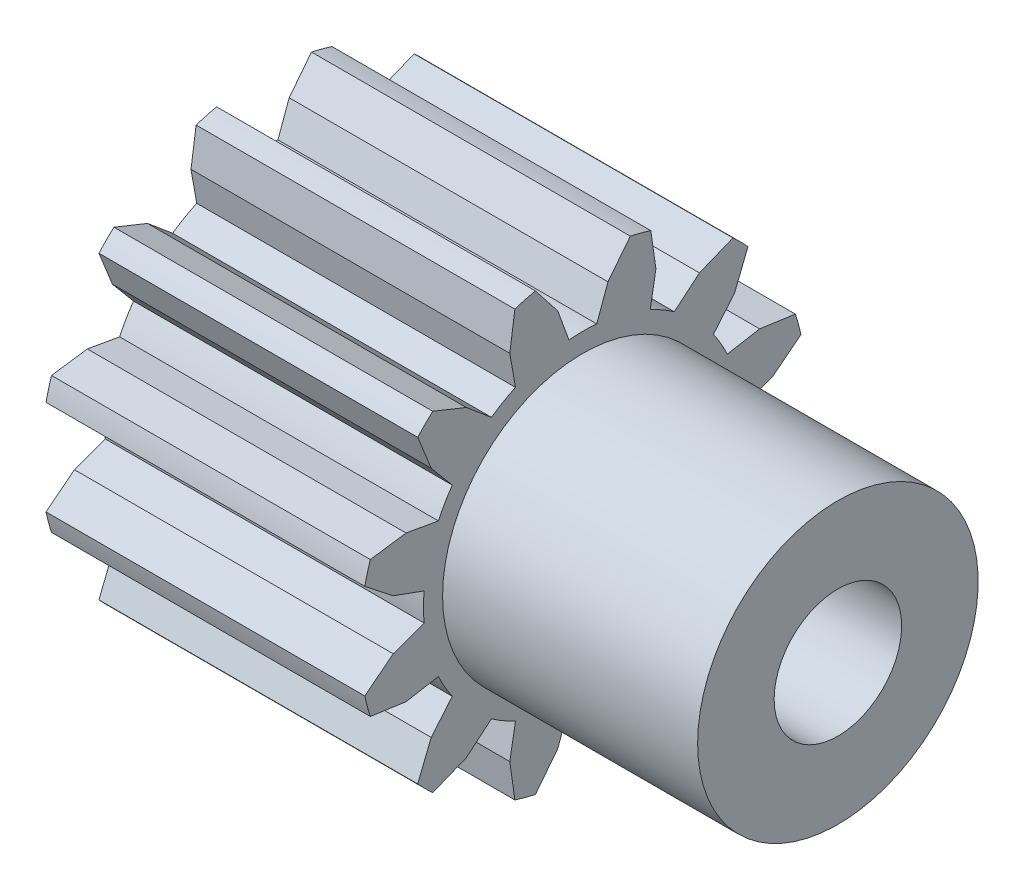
ISO-10303-21;
HEADER;
FILE_DESCRIPTION(('STEP AP214'),'2;1');
FILE_NAME('part.step','',(''),(''),'','','');
FILE_SCHEMA(('AUTOMOTIVE_DESIGN { 1 0 10303 214 1 1 1 1 }'));
ENDSEC;
DATA;
#1=APPLICATION_CONTEXT('core data for automotive mechanical design processes');
#2=APPLICATION_PROTOCOL_DEFINITION('international standard','automotive_design',2000,#1);
#3=PRODUCT_CONTEXT('',#1,'mechanical');
#4=PRODUCT('Part','Part','',(#3));
#5=PRODUCT_RELATED_PRODUCT_CATEGORY('part','',(#4));
#6=PRODUCT_DEFINITION_FORMATION('','',#4);
#7=PRODUCT_DEFINITION_CONTEXT('part definition',#1,'design');
#8=PRODUCT_DEFINITION('design','',#6,#7);
#9=PRODUCT_DEFINITION_SHAPE('','',#8);
#10=(LENGTH_UNIT() NAMED_UNIT(*) SI_UNIT(.MILLI.,.METRE.));
#11=(NAMED_UNIT(*) PLANE_ANGLE_UNIT() SI_UNIT($,.RADIAN.));
#12=(NAMED_UNIT(*) SI_UNIT($,.STERADIAN.) SOLID_ANGLE_UNIT());
#13=UNCERTAINTY_MEASURE_WITH_UNIT(LENGTH_MEASURE(1.E-05),#10,'distance_accuracy_value','');
#14=(GEOMETRIC_REPRESENTATION_CONTEXT(3) GLOBAL_UNCERTAINTY_ASSIGNED_CONTEXT((#13)) GLOBAL_UNIT_ASSIGNED_CONTEXT((#10,
#11,#12)) REPRESENTATION_CONTEXT('',''));
#15=CARTESIAN_POINT('',(0.,0.,0.));
#16=DIRECTION('',(0.,0.,1.));
#17=DIRECTION('',(1.,0.,0.));
#18=AXIS2_PLACEMENT_3D('',#15,#16,#17);
#19=CARTESIAN_POINT('',(-12.5,0.,2.70616862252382E-13));
#20=DIRECTION('',(-1.,0.,0.));
#21=DIRECTION('',(0.,0.,1.));
#22=AXIS2_PLACEMENT_3D('',#19,#20,#21);
#23=CYLINDRICAL_SURFACE('',#22,17.4999999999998);
#24=CARTESIAN_POINT('',(12.5,0.,2.70616862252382E-13));
#25=DIRECTION('',(-1.,0.,0.));
#26=DIRECTION('',(0.,0.,1.));
#27=AXIS2_PLACEMENT_3D('',#24,#25,#26);
#28=CIRCLE('',#27,17.4999999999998);
#29=CARTESIAN_POINT('',(12.5,-5.32913326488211,16.6688433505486));
#30=VERTEX_POINT('',#29);
#31=CARTESIAN_POINT('',(12.5,-3.71925688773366,17.1002084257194));
#32=VERTEX_POINT('',#31);
#33=EDGE_CURVE('E18',#30,#32,#28,.T.);
#34=ORIENTED_EDGE('',*,*,#33,.T.);
#35=DIRECTION('',(-1.,0.,0.));
#36=VECTOR('',#35,1.);
#37=CARTESIAN_POINT('',(12.5,-3.71925688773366,17.1002084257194));
#38=LINE('',#37,#36);
#39=CARTESIAN_POINT('',(-12.5,-3.71925688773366,17.1002084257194));
#40=VERTEX_POINT('',#39);
#41=EDGE_CURVE('E477',#40,#32,#38,.F.);
#42=ORIENTED_EDGE('',*,*,#41,.F.);
#43=CARTESIAN_POINT('',(-12.5,0.,2.70616862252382E-13));
#44=DIRECTION('',(-1.,0.,0.));
#45=DIRECTION('',(0.,0.,1.));
#46=AXIS2_PLACEMENT_3D('',#43,#44,#45);
#47=CIRCLE('',#46,17.4999999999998);
#48=CARTESIAN_POINT('',(-12.5,-5.32913326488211,16.6688433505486));
#49=VERTEX_POINT('',#48);
#50=EDGE_CURVE('E1140',#49,#40,#47,.T.);
#51=ORIENTED_EDGE('',*,*,#50,.F.);
#52=DIRECTION('',(-1.,0.,0.));
#53=VECTOR('',#52,1.);
#54=CARTESIAN_POINT('',(12.5,-5.32913326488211,16.6688433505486));
#55=LINE('',#54,#53);
#56=EDGE_CURVE('E1083',#30,#49,#55,.T.);
#57=ORIENTED_EDGE('',*,*,#56,.F.);
#58=EDGE_LOOP('',(#34,#42,#51,#57));
#59=FACE_BOUND('',#58,.T.);
#60=ADVANCED_FACE('F15',(#59),#23,.T.);
#61=CARTESIAN_POINT('',(-12.5,-1.0096090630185E-12,8.50014503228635E-13));
#62=DIRECTION('',(-1.,0.,0.));
#63=DIRECTION('',(0.,0.,1.));
#64=AXIS2_PLACEMENT_3D('',#61,#62,#63);
#65=CYLINDRICAL_SURFACE('',#64,17.4999999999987);
#66=CARTESIAN_POINT('',(12.5,-1.0096090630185E-12,8.50014503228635E-13));
#67=DIRECTION('',(-1.,0.,0.));
#68=DIRECTION('',(0.,0.,1.));
#69=AXIS2_PLACEMENT_3D('',#66,#67,#68);
#70=CIRCLE('',#69,17.4999999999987);
#71=CARTESIAN_POINT('',(12.5,-12.9495864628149,11.7710751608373));
#72=VERTEX_POINT('',#71);
#73=CARTESIAN_POINT('',(12.5,-11.7710751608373,12.9495864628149));
#74=VERTEX_POINT('',#73);
#75=EDGE_CURVE('E1179',#72,#74,#70,.T.);
#76=ORIENTED_EDGE('',*,*,#75,.T.);
#77=DIRECTION('',(-1.,0.,0.));
#78=VECTOR('',#77,1.);
#79=CARTESIAN_POINT('',(12.5,-11.7710751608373,12.9495864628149));
#80=LINE('',#79,#78);
#81=CARTESIAN_POINT('',(-12.5,-11.7710751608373,12.9495864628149));
#82=VERTEX_POINT('',#81);
#83=EDGE_CURVE('E1185',#82,#74,#80,.F.);
#84=ORIENTED_EDGE('',*,*,#83,.F.);
#85=CARTESIAN_POINT('',(-12.5,-1.0096090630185E-12,8.50014503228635E-13));
#86=DIRECTION('',(-1.,0.,0.));
#87=DIRECTION('',(0.,0.,1.));
#88=AXIS2_PLACEMENT_3D('',#85,#86,#87);
#89=CIRCLE('',#88,17.4999999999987);
#90=CARTESIAN_POINT('',(-12.5,-12.9495864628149,11.7710751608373));
#91=VERTEX_POINT('',#90);
#92=EDGE_CURVE('E1142',#91,#82,#89,.T.);
#93=ORIENTED_EDGE('',*,*,#92,.F.);
#94=DIRECTION('',(-1.,0.,0.));
#95=VECTOR('',#94,1.);
#96=CARTESIAN_POINT('',(12.5,-12.9495864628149,11.7710751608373));
#97=LINE('',#96,#95);
#98=EDGE_CURVE('E1032',#72,#91,#97,.T.);
#99=ORIENTED_EDGE('',*,*,#98,.F.);
#100=EDGE_LOOP('',(#76,#84,#93,#99));
#101=FACE_BOUND('',#100,.T.);
#102=ADVANCED_FACE('F1184',(#101),#65,.T.);
#103=CARTESIAN_POINT('',(-12.5,2.82933398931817E-12,-4.09828421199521E-13));
#104=DIRECTION('',(-1.,0.,0.));
#105=DIRECTION('',(0.,0.,1.));
#106=AXIS2_PLACEMENT_3D('',#103,#104,#105);
#107=CYLINDRICAL_SURFACE('',#106,17.5000000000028);
#108=CARTESIAN_POINT('',(12.5,2.82933398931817E-12,-4.09828421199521E-13));
#109=DIRECTION('',(-1.,0.,0.));
#110=DIRECTION('',(0.,0.,1.));
#111=AXIS2_PLACEMENT_3D('',#108,#109,#110);
#112=CIRCLE('',#111,17.5000000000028);
#113=CARTESIAN_POINT('',(12.5,-17.1002084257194,3.71925688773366));
#114=VERTEX_POINT('',#113);
#115=CARTESIAN_POINT('',(12.5,-16.6688433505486,5.32913326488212));
#116=VERTEX_POINT('',#115);
#117=EDGE_CURVE('E1178',#114,#116,#112,.T.);
#118=ORIENTED_EDGE('',*,*,#117,.T.);
#119=DIRECTION('',(-1.,0.,0.));
#120=VECTOR('',#119,1.);
#121=CARTESIAN_POINT('',(12.5,-16.6688433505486,5.32913326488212));
#122=LINE('',#121,#120);
#123=CARTESIAN_POINT('',(-12.5,-16.6688433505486,5.32913326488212));
#124=VERTEX_POINT('',#123);
#125=EDGE_CURVE('E1251',#124,#116,#122,.F.);
#126=ORIENTED_EDGE('',*,*,#125,.F.);
#127=CARTESIAN_POINT('',(-12.5,2.82933398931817E-12,-4.09828421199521E-13));
#128=DIRECTION('',(-1.,0.,0.));
#129=DIRECTION('',(0.,0.,1.));
#130=AXIS2_PLACEMENT_3D('',#127,#128,#129);
#131=CIRCLE('',#130,17.5000000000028);
#132=CARTESIAN_POINT('',(-12.5,-17.1002084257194,3.71925688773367));
#133=VERTEX_POINT('',#132);
#134=EDGE_CURVE('E1144',#133,#124,#131,.T.);
#135=ORIENTED_EDGE('',*,*,#134,.F.);
#136=DIRECTION('',(-1.,0.,0.));
#137=VECTOR('',#136,1.);
#138=CARTESIAN_POINT('',(12.5,-17.1002084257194,3.71925688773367));
#139=LINE('',#138,#137);
#140=EDGE_CURVE('E980',#114,#133,#139,.T.);
#141=ORIENTED_EDGE('',*,*,#140,.F.);
#142=EDGE_LOOP('',(#118,#126,#135,#141));
#143=FACE_BOUND('',#142,.T.);
#144=ADVANCED_FACE('F1259',(#143),#107,.T.);
#145=CARTESIAN_POINT('',(-12.5,0.,3.59955121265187E-13));
#146=DIRECTION('',(-1.,0.,0.));
#147=DIRECTION('',(0.,0.,1.));
#148=AXIS2_PLACEMENT_3D('',#145,#146,#147);
#149=CYLINDRICAL_SURFACE('',#148,17.5000000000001);
#150=CARTESIAN_POINT('',(12.5,0.,3.59955121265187E-13));
#151=DIRECTION('',(-1.,0.,0.));
#152=DIRECTION('',(0.,0.,1.));
#153=AXIS2_PLACEMENT_3D('',#150,#151,#152);
#154=CIRCLE('',#153,17.5000000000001);
#155=CARTESIAN_POINT('',(12.5,-16.6688433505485,-5.32913326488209));
#156=VERTEX_POINT('',#155);
#157=CARTESIAN_POINT('',(12.5,-17.1002084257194,-3.71925688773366));
#158=VERTEX_POINT('',#157);
#159=EDGE_CURVE('E1176',#156,#158,#154,.T.);
#160=ORIENTED_EDGE('',*,*,#159,.T.);
#161=DIRECTION('',(-1.,0.,0.));
#162=VECTOR('',#161,1.);
#163=CARTESIAN_POINT('',(12.5,-17.1002084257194,-3.71925688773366));
#164=LINE('',#163,#162);
#165=CARTESIAN_POINT('',(-12.5,-17.1002084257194,-3.71925688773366));
#166=VERTEX_POINT('',#165);
#167=EDGE_CURVE('E1283',#166,#158,#164,.F.);
#168=ORIENTED_EDGE('',*,*,#167,.F.);
#169=CARTESIAN_POINT('',(-12.5,0.,3.59955121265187E-13));
#170=DIRECTION('',(-1.,0.,0.));
#171=DIRECTION('',(0.,0.,1.));
#172=AXIS2_PLACEMENT_3D('',#169,#170,#171);
#173=CIRCLE('',#172,17.5000000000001);
#174=CARTESIAN_POINT('',(-12.5,-16.6688433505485,-5.32913326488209));
#175=VERTEX_POINT('',#174);
#176=EDGE_CURVE('E1146',#175,#166,#173,.T.);
#177=ORIENTED_EDGE('',*,*,#176,.F.);
#178=DIRECTION('',(-1.,0.,0.));
#179=VECTOR('',#178,1.);
#180=CARTESIAN_POINT('',(12.5,-16.6688433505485,-5.32913326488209));
#181=LINE('',#180,#179);
#182=EDGE_CURVE('E928',#156,#175,#181,.T.);
#183=ORIENTED_EDGE('',*,*,#182,.F.);
#184=EDGE_LOOP('',(#160,#168,#177,#183));
#185=FACE_BOUND('',#184,.T.);
#186=ADVANCED_FACE('F1670',(#185),#149,.T.);
#187=CARTESIAN_POINT('',(-12.5,7.19910242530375E-13,6.80011602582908E-13));
#188=DIRECTION('',(-1.,0.,0.));
#189=DIRECTION('',(0.,0.,1.));
#190=AXIS2_PLACEMENT_3D('',#187,#188,#189);
#191=CYLINDRICAL_SURFACE('',#190,17.500000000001);
#192=CARTESIAN_POINT('',(12.5,7.19910242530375E-13,6.80011602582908E-13));
#193=DIRECTION('',(-1.,0.,0.));
#194=DIRECTION('',(0.,0.,1.));
#195=AXIS2_PLACEMENT_3D('',#192,#193,#194);
#196=CIRCLE('',#195,17.500000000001);
#197=CARTESIAN_POINT('',(12.5,-11.7710751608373,-12.9495864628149));
#198=VERTEX_POINT('',#197);
#199=CARTESIAN_POINT('',(12.5,-12.9495864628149,-11.7710751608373));
#200=VERTEX_POINT('',#199);
#201=EDGE_CURVE('E1174',#198,#200,#196,.T.);
#202=ORIENTED_EDGE('',*,*,#201,.T.);
#203=DIRECTION('',(-1.,0.,0.));
#204=VECTOR('',#203,1.);
#205=CARTESIAN_POINT('',(12.5,-12.9495864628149,-11.7710751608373));
#206=LINE('',#205,#204);
#207=CARTESIAN_POINT('',(-12.5,-12.9495864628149,-11.7710751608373));
#208=VERTEX_POINT('',#207);
#209=EDGE_CURVE('E1375',#208,#200,#206,.F.);
#210=ORIENTED_EDGE('',*,*,#209,.F.);
#211=CARTESIAN_POINT('',(-12.5,7.19910242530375E-13,6.80011602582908E-13));
#212=DIRECTION('',(-1.,0.,0.));
#213=DIRECTION('',(0.,0.,1.));
#214=AXIS2_PLACEMENT_3D('',#211,#212,#213);
#215=CIRCLE('',#214,17.500000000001);
#216=CARTESIAN_POINT('',(-12.5,-11.7710751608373,-12.9495864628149));
#217=VERTEX_POINT('',#216);
#218=EDGE_CURVE('E1148',#217,#208,#215,.T.);
#219=ORIENTED_EDGE('',*,*,#218,.F.);
#220=DIRECTION('',(-1.,0.,0.));
#221=VECTOR('',#220,1.);
#222=CARTESIAN_POINT('',(12.5,-11.7710751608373,-12.9495864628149));
#223=LINE('',#222,#221);
#224=EDGE_CURVE('E876',#198,#217,#223,.T.);
#225=ORIENTED_EDGE('',*,*,#224,.F.);
#226=EDGE_LOOP('',(#202,#210,#219,#225));
#227=FACE_BOUND('',#226,.T.);
#228=ADVANCED_FACE('F1672',(#227),#191,.T.);
#229=CARTESIAN_POINT('',(-12.5,-3.79904441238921E-13,-1.2195106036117E-12));
#230=DIRECTION('',(-1.,0.,0.));
#231=DIRECTION('',(0.,0.,1.));
#232=AXIS2_PLACEMENT_3D('',#229,#230,#231);
#233=CYLINDRICAL_SURFACE('',#232,17.4999999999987);
#234=CARTESIAN_POINT('',(12.5,-3.79904441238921E-13,-1.2195106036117E-12));
#235=DIRECTION('',(-1.,0.,0.));
#236=DIRECTION('',(0.,0.,1.));
#237=AXIS2_PLACEMENT_3D('',#234,#235,#236);
#238=CIRCLE('',#237,17.4999999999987);
#239=CARTESIAN_POINT('',(12.5,-3.71925688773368,-17.1002084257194));
#240=VERTEX_POINT('',#239);
#241=CARTESIAN_POINT('',(12.5,-5.32913326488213,-16.6688433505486));
#242=VERTEX_POINT('',#241);
#243=EDGE_CURVE('E1172',#240,#242,#238,.T.);
#244=ORIENTED_EDGE('',*,*,#243,.T.);
#245=DIRECTION('',(-1.,0.,0.));
#246=VECTOR('',#245,1.);
#247=CARTESIAN_POINT('',(12.5,-5.32913326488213,-16.6688433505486));
#248=LINE('',#247,#246);
#249=CARTESIAN_POINT('',(-12.5,-5.32913326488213,-16.6688433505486));
#250=VERTEX_POINT('',#249);
#251=EDGE_CURVE('E1371',#250,#242,#248,.F.);
#252=ORIENTED_EDGE('',*,*,#251,.F.);
#253=CARTESIAN_POINT('',(-12.5,-3.79904441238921E-13,-1.2195106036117E-12));
#254=DIRECTION('',(-1.,0.,0.));
#255=DIRECTION('',(0.,0.,1.));
#256=AXIS2_PLACEMENT_3D('',#253,#254,#255);
#257=CIRCLE('',#256,17.4999999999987);
#258=CARTESIAN_POINT('',(-12.5,-3.71925688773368,-17.1002084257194));
#259=VERTEX_POINT('',#258);
#260=EDGE_CURVE('E1150',#259,#250,#257,.T.);
#261=ORIENTED_EDGE('',*,*,#260,.F.);
#262=DIRECTION('',(-1.,0.,0.));
#263=VECTOR('',#262,1.);
#264=CARTESIAN_POINT('',(12.5,-3.71925688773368,-17.1002084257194));
#265=LINE('',#264,#263);
#266=EDGE_CURVE('E824',#240,#259,#265,.T.);
#267=ORIENTED_EDGE('',*,*,#266,.F.);
#268=EDGE_LOOP('',(#244,#252,#261,#267));
#269=FACE_BOUND('',#268,.T.);
#270=ADVANCED_FACE('F1679',(#269),#233,.T.);
#271=CARTESIAN_POINT('',(-12.5,0.,-4.59701721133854E-13));
#272=DIRECTION('',(-1.,0.,0.));
#273=DIRECTION('',(0.,0.,1.));
#274=AXIS2_PLACEMENT_3D('',#271,#272,#273);
#275=CYLINDRICAL_SURFACE('',#274,17.4999999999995);
#276=CARTESIAN_POINT('',(12.5,0.,-4.59701721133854E-13));
#277=DIRECTION('',(-1.,0.,0.));
#278=DIRECTION('',(0.,0.,1.));
#279=AXIS2_PLACEMENT_3D('',#276,#277,#278);
#280=CIRCLE('',#279,17.4999999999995);
#281=CARTESIAN_POINT('',(12.5,5.32913326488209,-16.6688433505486));
#282=VERTEX_POINT('',#281);
#283=CARTESIAN_POINT('',(12.5,3.71925688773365,-17.1002084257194));
#284=VERTEX_POINT('',#283);
#285=EDGE_CURVE('E1170',#282,#284,#280,.T.);
#286=ORIENTED_EDGE('',*,*,#285,.T.);
#287=DIRECTION('',(-1.,0.,0.));
#288=VECTOR('',#287,1.);
#289=CARTESIAN_POINT('',(12.5,3.71925688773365,-17.1002084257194));
#290=LINE('',#289,#288);
#291=CARTESIAN_POINT('',(-12.5,3.71925688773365,-17.1002084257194));
#292=VERTEX_POINT('',#291);
#293=EDGE_CURVE('E1367',#292,#284,#290,.F.);
#294=ORIENTED_EDGE('',*,*,#293,.F.);
#295=CARTESIAN_POINT('',(-12.5,0.,-4.59701721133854E-13));
#296=DIRECTION('',(-1.,0.,0.));
#297=DIRECTION('',(0.,0.,1.));
#298=AXIS2_PLACEMENT_3D('',#295,#296,#297);
#299=CIRCLE('',#298,17.4999999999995);
#300=CARTESIAN_POINT('',(-12.5,5.32913326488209,-16.6688433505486));
#301=VERTEX_POINT('',#300);
#302=EDGE_CURVE('E1152',#301,#292,#299,.T.);
#303=ORIENTED_EDGE('',*,*,#302,.F.);
#304=DIRECTION('',(-1.,0.,0.));
#305=VECTOR('',#304,1.);
#306=CARTESIAN_POINT('',(12.5,5.32913326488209,-16.6688433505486));
#307=LINE('',#306,#305);
#308=EDGE_CURVE('E772',#282,#301,#307,.T.);
#309=ORIENTED_EDGE('',*,*,#308,.F.);
#310=EDGE_LOOP('',(#286,#294,#303,#309));
#311=FACE_BOUND('',#310,.T.);
#312=ADVANCED_FACE('F1916',(#311),#275,.T.);
#313=CARTESIAN_POINT('',(-12.5,7.99707522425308E-13,-2.80157841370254E-13));
#314=DIRECTION('',(-1.,0.,0.));
#315=DIRECTION('',(0.,0.,1.));
#316=AXIS2_PLACEMENT_3D('',#313,#314,#315);
#317=CYLINDRICAL_SURFACE('',#316,17.4999999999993);
#318=CARTESIAN_POINT('',(12.5,7.99707522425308E-13,-2.80157841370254E-13));
#319=DIRECTION('',(-1.,0.,0.));
#320=DIRECTION('',(0.,0.,1.));
#321=AXIS2_PLACEMENT_3D('',#318,#319,#320);
#322=CIRCLE('',#321,17.4999999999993);
#323=CARTESIAN_POINT('',(12.5,12.9495864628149,-11.7710751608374));
#324=VERTEX_POINT('',#323);
#325=CARTESIAN_POINT('',(12.5,11.7710751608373,-12.9495864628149));
#326=VERTEX_POINT('',#325);
#327=EDGE_CURVE('E1168',#324,#326,#322,.T.);
#328=ORIENTED_EDGE('',*,*,#327,.T.);
#329=DIRECTION('',(-1.,0.,0.));
#330=VECTOR('',#329,1.);
#331=CARTESIAN_POINT('',(12.5,11.7710751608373,-12.9495864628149));
#332=LINE('',#331,#330);
#333=CARTESIAN_POINT('',(-12.5,11.7710751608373,-12.9495864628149));
#334=VERTEX_POINT('',#333);
#335=EDGE_CURVE('E1363',#334,#326,#332,.F.);
#336=ORIENTED_EDGE('',*,*,#335,.F.);
#337=CARTESIAN_POINT('',(-12.5,7.99707522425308E-13,-2.80157841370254E-13));
#338=DIRECTION('',(-1.,0.,0.));
#339=DIRECTION('',(0.,0.,1.));
#340=AXIS2_PLACEMENT_3D('',#337,#338,#339);
#341=CIRCLE('',#340,17.4999999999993);
#342=CARTESIAN_POINT('',(-12.5,12.9495864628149,-11.7710751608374));
#343=VERTEX_POINT('',#342);
#344=EDGE_CURVE('E1154',#343,#334,#341,.T.);
#345=ORIENTED_EDGE('',*,*,#344,.F.);
#346=DIRECTION('',(-1.,0.,0.));
#347=VECTOR('',#346,1.);
#348=CARTESIAN_POINT('',(12.5,12.9495864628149,-11.7710751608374));
#349=LINE('',#348,#347);
#350=EDGE_CURVE('E720',#324,#343,#349,.T.);
#351=ORIENTED_EDGE('',*,*,#350,.F.);
#352=EDGE_LOOP('',(#328,#336,#345,#351));
#353=FACE_BOUND('',#352,.T.);
#354=ADVANCED_FACE('F1912',(#353),#317,.T.);
#355=CARTESIAN_POINT('',(-12.5,2.99066327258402E-12,-9.39786443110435E-13));
#356=DIRECTION('',(-1.,0.,0.));
#357=DIRECTION('',(0.,0.,1.));
#358=AXIS2_PLACEMENT_3D('',#355,#356,#357);
#359=CYLINDRICAL_SURFACE('',#358,17.4999999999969);
#360=CARTESIAN_POINT('',(12.5,2.99066327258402E-12,-9.39786443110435E-13));
#361=DIRECTION('',(-1.,0.,0.));
#362=DIRECTION('',(0.,0.,1.));
#363=AXIS2_PLACEMENT_3D('',#360,#361,#362);
#364=CIRCLE('',#363,17.4999999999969);
#365=CARTESIAN_POINT('',(12.5,17.1002084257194,-3.71925688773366));
#366=VERTEX_POINT('',#365);
#367=CARTESIAN_POINT('',(12.5,16.6688433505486,-5.32913326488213));
#368=VERTEX_POINT('',#367);
#369=EDGE_CURVE('E1166',#366,#368,#364,.T.);
#370=ORIENTED_EDGE('',*,*,#369,.T.);
#371=DIRECTION('',(-1.,0.,0.));
#372=VECTOR('',#371,1.);
#373=CARTESIAN_POINT('',(12.5,16.6688433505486,-5.32913326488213));
#374=LINE('',#373,#372);
#375=CARTESIAN_POINT('',(-12.5,16.6688433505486,-5.32913326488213));
#376=VERTEX_POINT('',#375);
#377=EDGE_CURVE('E1359',#376,#368,#374,.F.);
#378=ORIENTED_EDGE('',*,*,#377,.F.);
#379=CARTESIAN_POINT('',(-12.5,2.99066327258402E-12,-9.39786443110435E-13));
#380=DIRECTION('',(-1.,0.,0.));
#381=DIRECTION('',(0.,0.,1.));
#382=AXIS2_PLACEMENT_3D('',#379,#380,#381);
#383=CIRCLE('',#382,17.4999999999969);
#384=CARTESIAN_POINT('',(-12.5,17.1002084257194,-3.71925688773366));
#385=VERTEX_POINT('',#384);
#386=EDGE_CURVE('E1156',#385,#376,#383,.T.);
#387=ORIENTED_EDGE('',*,*,#386,.F.);
#388=DIRECTION('',(-1.,0.,0.));
#389=VECTOR('',#388,1.);
#390=CARTESIAN_POINT('',(12.5,17.1002084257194,-3.71925688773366));
#391=LINE('',#390,#389);
#392=EDGE_CURVE('E668',#366,#385,#391,.T.);
#393=ORIENTED_EDGE('',*,*,#392,.F.);
#394=EDGE_LOOP('',(#370,#378,#387,#393));
#395=FACE_BOUND('',#394,.T.);
#396=ADVANCED_FACE('F1908',(#395),#359,.T.);
#397=CARTESIAN_POINT('',(-12.5,2.28983498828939E-12,5.29958021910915E-13));
#398=DIRECTION('',(-1.,0.,0.));
#399=DIRECTION('',(0.,0.,1.));
#400=AXIS2_PLACEMENT_3D('',#397,#398,#399);
#401=CYLINDRICAL_SURFACE('',#400,17.4999999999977);
#402=CARTESIAN_POINT('',(12.5,2.28983498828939E-12,5.29958021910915E-13));
#403=DIRECTION('',(-1.,0.,0.));
#404=DIRECTION('',(0.,0.,1.));
#405=AXIS2_PLACEMENT_3D('',#402,#403,#404);
#406=CIRCLE('',#405,17.4999999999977);
#407=CARTESIAN_POINT('',(12.5,16.6688433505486,5.32913326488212));
#408=VERTEX_POINT('',#407);
#409=CARTESIAN_POINT('',(12.5,17.1002084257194,3.71925688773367));
#410=VERTEX_POINT('',#409);
#411=EDGE_CURVE('E1164',#408,#410,#406,.T.);
#412=ORIENTED_EDGE('',*,*,#411,.T.);
#413=DIRECTION('',(-1.,0.,0.));
#414=VECTOR('',#413,1.);
#415=CARTESIAN_POINT('',(12.5,17.1002084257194,3.71925688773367));
#416=LINE('',#415,#414);
#417=CARTESIAN_POINT('',(-12.5,17.1002084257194,3.71925688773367));
#418=VERTEX_POINT('',#417);
#419=EDGE_CURVE('E1355',#418,#410,#416,.F.);
#420=ORIENTED_EDGE('',*,*,#419,.F.);
#421=CARTESIAN_POINT('',(-12.5,2.28983498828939E-12,5.29958021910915E-13));
#422=DIRECTION('',(-1.,0.,0.));
#423=DIRECTION('',(0.,0.,1.));
#424=AXIS2_PLACEMENT_3D('',#421,#422,#423);
#425=CIRCLE('',#424,17.4999999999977);
#426=CARTESIAN_POINT('',(-12.5,16.6688433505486,5.32913326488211));
#427=VERTEX_POINT('',#426);
#428=EDGE_CURVE('E1158',#427,#418,#425,.T.);
#429=ORIENTED_EDGE('',*,*,#428,.F.);
#430=DIRECTION('',(-1.,0.,0.));
#431=VECTOR('',#430,1.);
#432=CARTESIAN_POINT('',(12.5,16.6688433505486,5.32913326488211));
#433=LINE('',#432,#431);
#434=EDGE_CURVE('E616',#408,#427,#433,.T.);
#435=ORIENTED_EDGE('',*,*,#434,.F.);
#436=EDGE_LOOP('',(#412,#420,#429,#435));
#437=FACE_BOUND('',#436,.T.);
#438=ADVANCED_FACE('F1905',(#437),#401,.T.);
#439=CARTESIAN_POINT('',(-12.5,-1.0096090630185E-12,-1.07986536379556E-12));
#440=DIRECTION('',(-1.,0.,0.));
#441=DIRECTION('',(0.,0.,1.));
#442=AXIS2_PLACEMENT_3D('',#439,#440,#441);
#443=CYLINDRICAL_SURFACE('',#442,17.5000000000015);
#444=CARTESIAN_POINT('',(12.5,-1.0096090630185E-12,-1.07986536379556E-12));
#445=DIRECTION('',(-1.,0.,0.));
#446=DIRECTION('',(0.,0.,1.));
#447=AXIS2_PLACEMENT_3D('',#444,#445,#446);
#448=CIRCLE('',#447,17.5000000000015);
#449=CARTESIAN_POINT('',(12.5,11.7710751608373,12.9495864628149));
#450=VERTEX_POINT('',#449);
#451=CARTESIAN_POINT('',(12.5,12.9495864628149,11.7710751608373));
#452=VERTEX_POINT('',#451);
#453=EDGE_CURVE('E1162',#450,#452,#448,.T.);
#454=ORIENTED_EDGE('',*,*,#453,.T.);
#455=DIRECTION('',(-1.,0.,0.));
#456=VECTOR('',#455,1.);
#457=CARTESIAN_POINT('',(12.5,12.9495864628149,11.7710751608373));
#458=LINE('',#457,#456);
#459=CARTESIAN_POINT('',(-12.5,12.9495864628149,11.7710751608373));
#460=VERTEX_POINT('',#459);
#461=EDGE_CURVE('E1346',#460,#452,#458,.F.);
#462=ORIENTED_EDGE('',*,*,#461,.F.);
#463=CARTESIAN_POINT('',(-12.5,-1.0096090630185E-12,-1.07986536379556E-12));
#464=DIRECTION('',(-1.,0.,0.));
#465=DIRECTION('',(0.,0.,1.));
#466=AXIS2_PLACEMENT_3D('',#463,#464,#465);
#467=CIRCLE('',#466,17.5000000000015);
#468=CARTESIAN_POINT('',(-12.5,11.7710751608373,12.9495864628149));
#469=VERTEX_POINT('',#468);
#470=EDGE_CURVE('E1160',#469,#460,#467,.T.);
#471=ORIENTED_EDGE('',*,*,#470,.F.);
#472=DIRECTION('',(-1.,0.,0.));
#473=VECTOR('',#472,1.);
#474=CARTESIAN_POINT('',(12.5,11.7710751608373,12.9495864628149));
#475=LINE('',#474,#473);
#476=EDGE_CURVE('E564',#450,#469,#475,.T.);
#477=ORIENTED_EDGE('',*,*,#476,.F.);
#478=EDGE_LOOP('',(#454,#462,#471,#477));
#479=FACE_BOUND('',#478,.T.);
#480=ADVANCED_FACE('F1630',(#479),#443,.T.);
#481=CARTESIAN_POINT('',(-12.5,-17.3054109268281,-17.1002084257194));
#482=DIRECTION('',(-1.,0.,0.));
#483=DIRECTION('',(0.,0.,1.));
#484=AXIS2_PLACEMENT_3D('',#481,#482,#483);
#485=PLANE('',#484);
#486=CARTESIAN_POINT('',(-12.5,0.,0.));
#487=DIRECTION('',(-1.,0.,0.));
#488=DIRECTION('',(0.,0.,1.));
#489=AXIS2_PLACEMENT_3D('',#486,#487,#488);
#490=CIRCLE('',#489,5.);
#491=CARTESIAN_POINT('',(-12.5,0.,5.));
#492=VERTEX_POINT('',#491);
#493=EDGE_CURVE('E1132',#492,#492,#490,.T.);
#494=ORIENTED_EDGE('',*,*,#493,.F.);
#495=EDGE_LOOP('',(#494));
#496=FACE_BOUND('',#495,.T.);
#497=DIRECTION('',(0.,-0.342020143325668,0.939692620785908));
#498=VECTOR('',#497,1.);
#499=CARTESIAN_POINT('',(-12.5,-1.52943522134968,13.6612920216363));
#500=LINE('',#499,#498);
#501=CARTESIAN_POINT('',(-12.5,-1.08944678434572,12.4524337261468));
#502=VERTEX_POINT('',#501);
#503=CARTESIAN_POINT('',(-12.5,-1.9694239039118,14.8701509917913));
#504=VERTEX_POINT('',#503);
#505=EDGE_CURVE('E455',#502,#504,#500,.T.);
#506=ORIENTED_EDGE('',*,*,#505,.F.);
#507=CARTESIAN_POINT('',(-12.5,1.20021180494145E-13,1.80411241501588E-13));
#508=DIRECTION('',(-1.,0.,0.));
#509=DIRECTION('',(0.,0.,1.));
#510=AXIS2_PLACEMENT_3D('',#507,#508,#509);
#511=CIRCLE('',#510,12.4999999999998);
#512=CARTESIAN_POINT('',(-12.5,1.08944678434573,12.4524337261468));
#513=VERTEX_POINT('',#512);
#514=EDGE_CURVE('E458',#513,#502,#511,.F.);
#515=ORIENTED_EDGE('',*,*,#514,.F.);
#516=DIRECTION('',(0.,-0.342020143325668,-0.939692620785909));
#517=VECTOR('',#516,1.);
#518=CARTESIAN_POINT('',(-12.5,1.52943522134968,13.6612920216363));
#519=LINE('',#518,#517);
#520=CARTESIAN_POINT('',(-12.5,1.96942365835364,14.8701503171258));
#521=VERTEX_POINT('',#520);
#522=EDGE_CURVE('E486',#521,#513,#519,.T.);
#523=ORIENTED_EDGE('',*,*,#522,.F.);
#524=DIRECTION('',(0.,-0.617307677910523,-0.786721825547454));
#525=VECTOR('',#524,1.);
#526=CARTESIAN_POINT('',(-12.5,2.84434027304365,15.9851793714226));
#527=LINE('',#526,#525);
#528=CARTESIAN_POINT('',(-12.5,3.71925688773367,17.1002084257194));
#529=VERTEX_POINT('',#528);
#530=EDGE_CURVE('E1135',#529,#521,#527,.T.);
#531=ORIENTED_EDGE('',*,*,#530,.F.);
#532=CARTESIAN_POINT('',(-12.5,-6.20163642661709E-13,-1.76941794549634E-12));
#533=DIRECTION('',(-1.,0.,0.));
#534=DIRECTION('',(0.,0.,1.));
#535=AXIS2_PLACEMENT_3D('',#532,#533,#534);
#536=CIRCLE('',#535,17.5000000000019);
#537=CARTESIAN_POINT('',(-12.5,5.32913326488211,16.6688433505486));
#538=VERTEX_POINT('',#537);
#539=EDGE_CURVE('E1137',#538,#529,#536,.F.);
#540=ORIENTED_EDGE('',*,*,#539,.F.);
#541=DIRECTION('',(0.,-0.141243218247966,0.989974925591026));
#542=VECTOR('',#541,1.);
#543=CARTESIAN_POINT('',(-12.5,5.52931875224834,15.2657415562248));
#544=LINE('',#543,#542);
#545=CARTESIAN_POINT('',(-12.5,5.7295043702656,13.8626405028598));
#546=VERTEX_POINT('',#545);
#547=EDGE_CURVE('E551',#546,#538,#544,.T.);
#548=ORIENTED_EDGE('',*,*,#547,.F.);
#549=DIRECTION('',(0.,0.173648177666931,0.984807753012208));
#550=VECTOR('',#549,1.);
#551=CARTESIAN_POINT('',(-12.5,5.50611625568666,12.5957435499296));
#552=LINE('',#551,#550);
#553=CARTESIAN_POINT('',(-12.5,5.28272827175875,11.3288473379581));
#554=VERTEX_POINT('',#553);
#555=EDGE_CURVE('E523',#554,#546,#552,.T.);
#556=ORIENTED_EDGE('',*,*,#555,.F.);
#557=CARTESIAN_POINT('',(-12.5,-1.70002900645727E-13,-2.00360561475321E-13));
#558=DIRECTION('',(-1.,0.,0.));
#559=DIRECTION('',(0.,0.,1.));
#560=AXIS2_PLACEMENT_3D('',#557,#558,#559);
#561=CIRCLE('',#560,12.5000000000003);
#562=CARTESIAN_POINT('',(-12.5,7.16970545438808,10.2394005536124));
#563=VERTEX_POINT('',#562);
#564=EDGE_CURVE('E524',#563,#554,#561,.F.);
#565=ORIENTED_EDGE('',*,*,#564,.F.);
#566=DIRECTION('',(0.,-0.766044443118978,-0.642787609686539));
#567=VECTOR('',#566,1.);
#568=CARTESIAN_POINT('',(-12.5,8.15517576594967,11.0663083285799));
#569=LINE('',#568,#567);
#570=CARTESIAN_POINT('',(-12.5,9.14064607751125,11.8932161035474));
#571=VERTEX_POINT('',#570);
#572=EDGE_CURVE('E555',#571,#563,#569,.T.);
#573=ORIENTED_EDGE('',*,*,#572,.F.);
#574=DIRECTION('',(0.,-0.927965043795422,-0.372667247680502));
#575=VECTOR('',#574,1.);
#576=CARTESIAN_POINT('',(-12.5,10.4558606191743,12.4214012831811));
#577=LINE('',#576,#575);
#578=EDGE_CURVE('E572',#469,#571,#577,.T.);
#579=ORIENTED_EDGE('',*,*,#578,.F.);
#580=ORIENTED_EDGE('',*,*,#470,.T.);
#581=DIRECTION('',(0.,0.372667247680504,0.927965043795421));
#582=VECTOR('',#581,1.);
#583=CARTESIAN_POINT('',(-12.5,12.4214012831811,10.4558606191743));
#584=LINE('',#583,#582);
#585=CARTESIAN_POINT('',(-12.5,11.89321647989,9.14064652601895));
#586=VERTEX_POINT('',#585);
#587=EDGE_CURVE('E603',#586,#460,#584,.T.);
#588=ORIENTED_EDGE('',*,*,#587,.F.);
#589=DIRECTION('',(0.,0.642787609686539,0.766044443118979));
#590=VECTOR('',#589,1.);
#591=CARTESIAN_POINT('',(-12.5,11.0663083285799,8.15517576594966));
#592=LINE('',#591,#590);
#593=CARTESIAN_POINT('',(-12.5,10.2394005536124,7.16970545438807));
#594=VERTEX_POINT('',#593);
#595=EDGE_CURVE('E576',#594,#586,#592,.T.);
#596=ORIENTED_EDGE('',*,*,#595,.F.);
#597=CARTESIAN_POINT('',(-12.5,-5.10008701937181E-13,-3.30031141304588E-13));
#598=DIRECTION('',(-1.,0.,0.));
#599=DIRECTION('',(0.,0.,1.));
#600=AXIS2_PLACEMENT_3D('',#597,#598,#599);
#601=CIRCLE('',#600,12.5000000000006);
#602=CARTESIAN_POINT('',(-12.5,11.3288473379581,5.28272827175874));
#603=VERTEX_POINT('',#602);
#604=EDGE_CURVE('E577',#603,#594,#601,.F.);
#605=ORIENTED_EDGE('',*,*,#604,.F.);
#606=DIRECTION('',(0.,-0.984807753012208,-0.17364817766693));
#607=VECTOR('',#606,1.);
#608=CARTESIAN_POINT('',(-12.5,12.5957435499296,5.50611625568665));
#609=LINE('',#608,#607);
#610=CARTESIAN_POINT('',(-12.5,13.862639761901,5.72950423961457));
#611=VERTEX_POINT('',#610);
#612=EDGE_CURVE('E607',#611,#603,#609,.T.);
#613=ORIENTED_EDGE('',*,*,#612,.F.);
#614=DIRECTION('',(0.,-0.989974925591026,0.141243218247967));
#615=VECTOR('',#614,1.);
#616=CARTESIAN_POINT('',(-12.5,15.2657415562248,5.52931875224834));
#617=LINE('',#616,#615);
#618=EDGE_CURVE('E624',#427,#611,#617,.T.);
#619=ORIENTED_EDGE('',*,*,#618,.F.);
#620=ORIENTED_EDGE('',*,*,#428,.T.);
#621=DIRECTION('',(0.,0.786721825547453,0.617307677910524));
#622=VECTOR('',#621,1.);
#623=CARTESIAN_POINT('',(-12.5,15.9851793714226,2.84434027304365));
#624=LINE('',#623,#622);
#625=CARTESIAN_POINT('',(-12.5,14.8701505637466,1.96942374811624));
#626=VERTEX_POINT('',#625);
#627=EDGE_CURVE('E655',#626,#418,#624,.T.);
#628=ORIENTED_EDGE('',*,*,#627,.F.);
#629=DIRECTION('',(0.,0.93969262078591,0.342020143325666));
#630=VECTOR('',#629,1.);
#631=CARTESIAN_POINT('',(-12.5,13.6612920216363,1.52943522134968));
#632=LINE('',#631,#630);
#633=CARTESIAN_POINT('',(-12.5,12.4524337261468,1.08944678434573));
#634=VERTEX_POINT('',#633);
#635=EDGE_CURVE('E628',#634,#626,#632,.T.);
#636=ORIENTED_EDGE('',*,*,#635,.F.);
#637=CARTESIAN_POINT('',(-12.5,0.,0.));
#638=DIRECTION('',(-1.,0.,0.));
#639=DIRECTION('',(0.,0.,1.));
#640=AXIS2_PLACEMENT_3D('',#637,#638,#639);
#641=CIRCLE('',#640,12.5000000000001);
#642=CARTESIAN_POINT('',(-12.5,12.4524337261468,-1.08944678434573));
#643=VERTEX_POINT('',#642);
#644=EDGE_CURVE('E629',#643,#634,#641,.F.);
#645=ORIENTED_EDGE('',*,*,#644,.F.);
#646=DIRECTION('',(0.,-0.939692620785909,0.342020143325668));
#647=VECTOR('',#646,1.);
#648=CARTESIAN_POINT('',(-12.5,13.6612920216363,-1.52943522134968));
#649=LINE('',#648,#647);
#650=CARTESIAN_POINT('',(-12.5,14.8701503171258,-1.96942365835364));
#651=VERTEX_POINT('',#650);
#652=EDGE_CURVE('E659',#651,#643,#649,.T.);
#653=ORIENTED_EDGE('',*,*,#652,.F.);
#654=DIRECTION('',(0.,-0.786721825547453,0.617307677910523));
#655=VECTOR('',#654,1.);
#656=CARTESIAN_POINT('',(-12.5,15.9851793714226,-2.84434027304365));
#657=LINE('',#656,#655);
#658=EDGE_CURVE('E676',#385,#651,#657,.T.);
#659=ORIENTED_EDGE('',*,*,#658,.F.);
#660=ORIENTED_EDGE('',*,*,#386,.T.);
#661=DIRECTION('',(0.,0.989974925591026,0.141243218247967));
#662=VECTOR('',#661,1.);
#663=CARTESIAN_POINT('',(-12.5,15.2657415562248,-5.52931875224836));
#664=LINE('',#663,#662);
#665=CARTESIAN_POINT('',(-12.5,13.8626398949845,-5.7295042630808));
#666=VERTEX_POINT('',#665);
#667=EDGE_CURVE('E707',#666,#376,#664,.T.);
#668=ORIENTED_EDGE('',*,*,#667,.F.);
#669=DIRECTION('',(0.,0.984807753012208,-0.173648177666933));
#670=VECTOR('',#669,1.);
#671=CARTESIAN_POINT('',(-12.5,12.5957435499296,-5.50611625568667));
#672=LINE('',#671,#670);
#673=CARTESIAN_POINT('',(-12.5,11.3288473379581,-5.28272827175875));
#674=VERTEX_POINT('',#673);
#675=EDGE_CURVE('E680',#674,#666,#672,.T.);
#676=ORIENTED_EDGE('',*,*,#675,.F.);
#677=CARTESIAN_POINT('',(-12.5,0.,0.));
#678=DIRECTION('',(-1.,0.,0.));
#679=DIRECTION('',(0.,0.,1.));
#680=AXIS2_PLACEMENT_3D('',#677,#678,#679);
#681=CIRCLE('',#680,12.4999999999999);
#682=CARTESIAN_POINT('',(-12.5,10.2394005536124,-7.16970545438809));
#683=VERTEX_POINT('',#682);
#684=EDGE_CURVE('E681',#683,#674,#681,.F.);
#685=ORIENTED_EDGE('',*,*,#684,.F.);
#686=DIRECTION('',(0.,-0.642787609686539,0.766044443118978));
#687=VECTOR('',#686,1.);
#688=CARTESIAN_POINT('',(-12.5,11.0663083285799,-8.15517576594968));
#689=LINE('',#688,#687);
#690=CARTESIAN_POINT('',(-12.5,11.8932161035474,-9.14064607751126));
#691=VERTEX_POINT('',#690);
#692=EDGE_CURVE('E711',#691,#683,#689,.T.);
#693=ORIENTED_EDGE('',*,*,#692,.F.);
#694=DIRECTION('',(0.,-0.372667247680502,0.927965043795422));
#695=VECTOR('',#694,1.);
#696=CARTESIAN_POINT('',(-12.5,12.4214012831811,-10.4558606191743));
#697=LINE('',#696,#695);
#698=EDGE_CURVE('E728',#343,#691,#697,.T.);
#699=ORIENTED_EDGE('',*,*,#698,.F.);
#700=ORIENTED_EDGE('',*,*,#344,.T.);
#701=DIRECTION('',(0.,0.927965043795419,-0.37266724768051));
#702=VECTOR('',#701,1.);
#703=CARTESIAN_POINT('',(-12.5,10.4558606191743,-12.4214012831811));
#704=LINE('',#703,#702);
#705=CARTESIAN_POINT('',(-12.5,9.14064645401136,-11.8932164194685));
#706=VERTEX_POINT('',#705);
#707=EDGE_CURVE('E759',#706,#334,#704,.T.);
#708=ORIENTED_EDGE('',*,*,#707,.F.);
#709=DIRECTION('',(0.,0.76604444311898,-0.642787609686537));
#710=VECTOR('',#709,1.);
#711=CARTESIAN_POINT('',(-12.5,8.15517576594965,-11.0663083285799));
#712=LINE('',#711,#710);
#713=CARTESIAN_POINT('',(-12.5,7.16970545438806,-10.2394005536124));
#714=VERTEX_POINT('',#713);
#715=EDGE_CURVE('E732',#714,#706,#712,.T.);
#716=ORIENTED_EDGE('',*,*,#715,.F.);
#717=CARTESIAN_POINT('',(-12.5,0.,0.));
#718=DIRECTION('',(-1.,0.,0.));
#719=DIRECTION('',(0.,0.,1.));
#720=AXIS2_PLACEMENT_3D('',#717,#718,#719);
#721=CIRCLE('',#720,12.5);
#722=CARTESIAN_POINT('',(-12.5,5.28272827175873,-11.3288473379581));
#723=VERTEX_POINT('',#722);
#724=EDGE_CURVE('E733',#723,#714,#721,.F.);
#725=ORIENTED_EDGE('',*,*,#724,.F.);
#726=DIRECTION('',(0.,-0.173648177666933,0.984807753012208));
#727=VECTOR('',#726,1.);
#728=CARTESIAN_POINT('',(-12.5,5.50611625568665,-12.5957435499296));
#729=LINE('',#728,#727);
#730=CARTESIAN_POINT('',(-12.5,5.72950423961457,-13.862639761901));
#731=VERTEX_POINT('',#730);
#732=EDGE_CURVE('E763',#731,#723,#729,.T.);
#733=ORIENTED_EDGE('',*,*,#732,.F.);
#734=DIRECTION('',(0.,0.141243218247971,0.989974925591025));
#735=VECTOR('',#734,1.);
#736=CARTESIAN_POINT('',(-12.5,5.52931875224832,-15.2657415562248));
#737=LINE('',#736,#735);
#738=EDGE_CURVE('E780',#301,#731,#737,.T.);
#739=ORIENTED_EDGE('',*,*,#738,.F.);
#740=ORIENTED_EDGE('',*,*,#302,.T.);
#741=DIRECTION('',(0.,0.61730767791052,-0.786721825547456));
#742=VECTOR('',#741,1.);
#743=CARTESIAN_POINT('',(-12.5,2.84434027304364,-15.9851793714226));
#744=LINE('',#743,#742);
#745=CARTESIAN_POINT('',(-12.5,1.96942390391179,-14.8701509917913));
#746=VERTEX_POINT('',#745);
#747=EDGE_CURVE('E811',#746,#292,#744,.T.);
#748=ORIENTED_EDGE('',*,*,#747,.F.);
#749=DIRECTION('',(0.,0.342020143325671,-0.939692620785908));
#750=VECTOR('',#749,1.);
#751=CARTESIAN_POINT('',(-12.5,1.52943522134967,-13.6612920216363));
#752=LINE('',#751,#750);
#753=CARTESIAN_POINT('',(-12.5,1.08944678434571,-12.4524337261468));
#754=VERTEX_POINT('',#753);
#755=EDGE_CURVE('E784',#754,#746,#752,.T.);
#756=ORIENTED_EDGE('',*,*,#755,.F.);
#757=CARTESIAN_POINT('',(-12.5,0.,4.9960036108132E-13));
#758=DIRECTION('',(-1.,0.,0.));
#759=DIRECTION('',(0.,0.,1.));
#760=AXIS2_PLACEMENT_3D('',#757,#758,#759);
#761=CIRCLE('',#760,12.5000000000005);
#762=CARTESIAN_POINT('',(-12.5,-1.08944678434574,-12.4524337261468));
#763=VERTEX_POINT('',#762);
#764=EDGE_CURVE('E785',#763,#754,#761,.F.);
#765=ORIENTED_EDGE('',*,*,#764,.F.);
#766=DIRECTION('',(0.,0.342020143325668,0.939692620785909));
#767=VECTOR('',#766,1.);
#768=CARTESIAN_POINT('',(-12.5,-1.52943522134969,-13.6612920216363));
#769=LINE('',#768,#767);
#770=CARTESIAN_POINT('',(-12.5,-1.96942365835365,-14.8701503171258));
#771=VERTEX_POINT('',#770);
#772=EDGE_CURVE('E815',#771,#763,#769,.T.);
#773=ORIENTED_EDGE('',*,*,#772,.F.);
#774=DIRECTION('',(0.,0.617307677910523,0.786721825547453));
#775=VECTOR('',#774,1.);
#776=CARTESIAN_POINT('',(-12.5,-2.84434027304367,-15.9851793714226));
#777=LINE('',#776,#775);
#778=EDGE_CURVE('E832',#259,#771,#777,.T.);
#779=ORIENTED_EDGE('',*,*,#778,.F.);
#780=ORIENTED_EDGE('',*,*,#260,.T.);
#781=DIRECTION('',(0.,0.141243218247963,-0.989974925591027));
#782=VECTOR('',#781,1.);
#783=CARTESIAN_POINT('',(-12.5,-5.52931875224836,-15.2657415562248));
#784=LINE('',#783,#782);
#785=CARTESIAN_POINT('',(-12.5,-5.7295043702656,-13.8626405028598));
#786=VERTEX_POINT('',#785);
#787=EDGE_CURVE('E863',#786,#250,#784,.T.);
#788=ORIENTED_EDGE('',*,*,#787,.F.);
#789=DIRECTION('',(0.,-0.173648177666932,-0.984807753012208));
#790=VECTOR('',#789,1.);
#791=CARTESIAN_POINT('',(-12.5,-5.50611625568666,-12.5957435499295));
#792=LINE('',#791,#790);
#793=CARTESIAN_POINT('',(-12.5,-5.28272827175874,-11.3288473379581));
#794=VERTEX_POINT('',#793);
#795=EDGE_CURVE('E836',#794,#786,#792,.T.);
#796=ORIENTED_EDGE('',*,*,#795,.F.);
#797=CARTESIAN_POINT('',(-12.5,0.,3.0964814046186E-13));
#798=DIRECTION('',(-1.,0.,0.));
#799=DIRECTION('',(0.,0.,1.));
#800=AXIS2_PLACEMENT_3D('',#797,#798,#799);
#801=CIRCLE('',#800,12.5000000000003);
#802=CARTESIAN_POINT('',(-12.5,-7.16970545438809,-10.2394005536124));
#803=VERTEX_POINT('',#802);
#804=EDGE_CURVE('E837',#803,#794,#801,.F.);
#805=ORIENTED_EDGE('',*,*,#804,.F.);
#806=DIRECTION('',(0.,0.766044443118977,0.642787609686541));
#807=VECTOR('',#806,1.);
#808=CARTESIAN_POINT('',(-12.5,-8.15517576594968,-11.0663083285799));
#809=LINE('',#808,#807);
#810=CARTESIAN_POINT('',(-12.5,-9.14064607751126,-11.8932161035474));
#811=VERTEX_POINT('',#810);
#812=EDGE_CURVE('E867',#811,#803,#809,.T.);
#813=ORIENTED_EDGE('',*,*,#812,.F.);
#814=DIRECTION('',(0.,0.927965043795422,0.372667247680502));
#815=VECTOR('',#814,1.);
#816=CARTESIAN_POINT('',(-12.5,-10.4558606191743,-12.4214012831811));
#817=LINE('',#816,#815);
#818=EDGE_CURVE('E884',#217,#811,#817,.T.);
#819=ORIENTED_EDGE('',*,*,#818,.F.);
#820=ORIENTED_EDGE('',*,*,#218,.T.);
#821=DIRECTION('',(0.,-0.372667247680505,-0.927965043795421));
#822=VECTOR('',#821,1.);
#823=CARTESIAN_POINT('',(-12.5,-12.4214012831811,-10.4558606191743));
#824=LINE('',#823,#822);
#825=CARTESIAN_POINT('',(-12.5,-11.89321647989,-9.14064652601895));
#826=VERTEX_POINT('',#825);
#827=EDGE_CURVE('E915',#826,#208,#824,.T.);
#828=ORIENTED_EDGE('',*,*,#827,.F.);
#829=DIRECTION('',(0.,-0.642787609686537,-0.76604444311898));
#830=VECTOR('',#829,1.);
#831=CARTESIAN_POINT('',(-12.5,-11.0663083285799,-8.15517576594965));
#832=LINE('',#831,#830);
#833=CARTESIAN_POINT('',(-12.5,-10.2394005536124,-7.16970545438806));
#834=VERTEX_POINT('',#833);
#835=EDGE_CURVE('E888',#834,#826,#832,.T.);
#836=ORIENTED_EDGE('',*,*,#835,.F.);
#837=CARTESIAN_POINT('',(-12.5,-3.79904441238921E-13,-1.6002824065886E-13));
#838=DIRECTION('',(-1.,0.,0.));
#839=DIRECTION('',(0.,0.,1.));
#840=AXIS2_PLACEMENT_3D('',#837,#838,#839);
#841=CIRCLE('',#840,12.4999999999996);
#842=CARTESIAN_POINT('',(-12.5,-11.3288473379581,-5.28272827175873));
#843=VERTEX_POINT('',#842);
#844=EDGE_CURVE('E889',#843,#834,#841,.F.);
#845=ORIENTED_EDGE('',*,*,#844,.F.);
#846=DIRECTION('',(0.,0.984807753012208,0.173648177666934));
#847=VECTOR('',#846,1.);
#848=CARTESIAN_POINT('',(-12.5,-12.5957435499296,-5.50611625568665));
#849=LINE('',#848,#847);
#850=CARTESIAN_POINT('',(-12.5,-13.862639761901,-5.72950423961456));
#851=VERTEX_POINT('',#850);
#852=EDGE_CURVE('E919',#851,#843,#849,.T.);
#853=ORIENTED_EDGE('',*,*,#852,.F.);
#854=DIRECTION('',(0.,0.989974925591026,-0.141243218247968));
#855=VECTOR('',#854,1.);
#856=CARTESIAN_POINT('',(-12.5,-15.2657415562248,-5.52931875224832));
#857=LINE('',#856,#855);
#858=EDGE_CURVE('E936',#175,#851,#857,.T.);
#859=ORIENTED_EDGE('',*,*,#858,.F.);
#860=ORIENTED_EDGE('',*,*,#176,.T.);
#861=DIRECTION('',(0.,-0.786721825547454,-0.617307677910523));
#862=VECTOR('',#861,1.);
#863=CARTESIAN_POINT('',(-12.5,-15.9851793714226,-2.84434027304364));
#864=LINE('',#863,#862);
#865=CARTESIAN_POINT('',(-12.5,-14.8701505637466,-1.96942374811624));
#866=VERTEX_POINT('',#865);
#867=EDGE_CURVE('E967',#866,#166,#864,.T.);
#868=ORIENTED_EDGE('',*,*,#867,.F.);
#869=DIRECTION('',(0.,-0.939692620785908,-0.342020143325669));
#870=VECTOR('',#869,1.);
#871=CARTESIAN_POINT('',(-12.5,-13.6612920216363,-1.52943522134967));
#872=LINE('',#871,#870);
#873=CARTESIAN_POINT('',(-12.5,-12.4524337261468,-1.08944678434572));
#874=VERTEX_POINT('',#873);
#875=EDGE_CURVE('E940',#874,#866,#872,.T.);
#876=ORIENTED_EDGE('',*,*,#875,.F.);
#877=CARTESIAN_POINT('',(-12.5,-4.30211422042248E-13,0.));
#878=DIRECTION('',(-1.,0.,0.));
#879=DIRECTION('',(0.,0.,1.));
#880=AXIS2_PLACEMENT_3D('',#877,#878,#879);
#881=CIRCLE('',#880,12.4999999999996);
#882=CARTESIAN_POINT('',(-12.5,-12.4524337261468,1.08944678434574));
#883=VERTEX_POINT('',#882);
#884=EDGE_CURVE('E941',#883,#874,#881,.F.);
#885=ORIENTED_EDGE('',*,*,#884,.F.);
#886=DIRECTION('',(0.,0.939692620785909,-0.342020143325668));
#887=VECTOR('',#886,1.);
#888=CARTESIAN_POINT('',(-12.5,-13.6612920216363,1.52943522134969));
#889=LINE('',#888,#887);
#890=CARTESIAN_POINT('',(-12.5,-14.8701503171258,1.96942365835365));
#891=VERTEX_POINT('',#890);
#892=EDGE_CURVE('E971',#891,#883,#889,.T.);
#893=ORIENTED_EDGE('',*,*,#892,.F.);
#894=DIRECTION('',(0.,0.786721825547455,-0.617307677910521));
#895=VECTOR('',#894,1.);
#896=CARTESIAN_POINT('',(-12.5,-15.9851793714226,2.84434027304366));
#897=LINE('',#896,#895);
#898=EDGE_CURVE('E988',#133,#891,#897,.T.);
#899=ORIENTED_EDGE('',*,*,#898,.F.);
#900=ORIENTED_EDGE('',*,*,#134,.T.);
#901=DIRECTION('',(0.,-0.989974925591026,-0.141243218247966));
#902=VECTOR('',#901,1.);
#903=CARTESIAN_POINT('',(-12.5,-15.2657415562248,5.52931875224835));
#904=LINE('',#903,#902);
#905=CARTESIAN_POINT('',(-12.5,-13.8626398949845,5.72950426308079));
#906=VERTEX_POINT('',#905);
#907=EDGE_CURVE('E1019',#906,#124,#904,.T.);
#908=ORIENTED_EDGE('',*,*,#907,.F.);
#909=DIRECTION('',(0.,-0.984807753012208,0.173648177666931));
#910=VECTOR('',#909,1.);
#911=CARTESIAN_POINT('',(-12.5,-12.5957435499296,5.50611625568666));
#912=LINE('',#911,#910);
#913=CARTESIAN_POINT('',(-12.5,-11.3288473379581,5.28272827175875));
#914=VERTEX_POINT('',#913);
#915=EDGE_CURVE('E992',#914,#906,#912,.T.);
#916=ORIENTED_EDGE('',*,*,#915,.F.);
#917=CARTESIAN_POINT('',(-12.5,3.0964814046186E-13,-2.80157841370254E-13));
#918=DIRECTION('',(-1.,0.,0.));
#919=DIRECTION('',(0.,0.,1.));
#920=AXIS2_PLACEMENT_3D('',#917,#918,#919);
#921=CIRCLE('',#920,12.5000000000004);
#922=CARTESIAN_POINT('',(-12.5,-10.2394005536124,7.16970545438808));
#923=VERTEX_POINT('',#922);
#924=EDGE_CURVE('E993',#923,#914,#921,.F.);
#925=ORIENTED_EDGE('',*,*,#924,.F.);
#926=DIRECTION('',(0.,0.642787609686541,-0.766044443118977));
#927=VECTOR('',#926,1.);
#928=CARTESIAN_POINT('',(-12.5,-11.0663083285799,8.15517576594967));
#929=LINE('',#928,#927);
#930=CARTESIAN_POINT('',(-12.5,-11.8932161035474,9.14064607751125));
#931=VERTEX_POINT('',#930);
#932=EDGE_CURVE('E1023',#931,#923,#929,.T.);
#933=ORIENTED_EDGE('',*,*,#932,.F.);
#934=DIRECTION('',(0.,0.372667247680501,-0.927965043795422));
#935=VECTOR('',#934,1.);
#936=CARTESIAN_POINT('',(-12.5,-12.4214012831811,10.4558606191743));
#937=LINE('',#936,#935);
#938=EDGE_CURVE('E1040',#91,#931,#937,.T.);
#939=ORIENTED_EDGE('',*,*,#938,.F.);
#940=ORIENTED_EDGE('',*,*,#92,.T.);
#941=DIRECTION('',(0.,-0.927965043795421,0.372667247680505));
#942=VECTOR('',#941,1.);
#943=CARTESIAN_POINT('',(-12.5,-10.4558606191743,12.4214012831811));
#944=LINE('',#943,#942);
#945=CARTESIAN_POINT('',(-12.5,-9.14064645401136,11.8932164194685));
#946=VERTEX_POINT('',#945);
#947=EDGE_CURVE('E1071',#946,#82,#944,.T.);
#948=ORIENTED_EDGE('',*,*,#947,.F.);
#949=DIRECTION('',(0.,-0.766044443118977,0.642787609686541));
#950=VECTOR('',#949,1.);
#951=CARTESIAN_POINT('',(-12.5,-8.15517576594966,11.0663083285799));
#952=LINE('',#951,#950);
#953=CARTESIAN_POINT('',(-12.5,-7.16970545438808,10.2394005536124));
#954=VERTEX_POINT('',#953);
#955=EDGE_CURVE('E1044',#954,#946,#952,.T.);
#956=ORIENTED_EDGE('',*,*,#955,.F.);
#957=CARTESIAN_POINT('',(-12.5,-1.10154940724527E-13,1.30104260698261E-13));
#958=DIRECTION('',(-1.,0.,0.));
#959=DIRECTION('',(0.,0.,1.));
#960=AXIS2_PLACEMENT_3D('',#957,#958,#959);
#961=CIRCLE('',#960,12.4999999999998);
#962=CARTESIAN_POINT('',(-12.5,-5.28272827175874,11.3288473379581));
#963=VERTEX_POINT('',#962);
#964=EDGE_CURVE('E1045',#963,#954,#961,.F.);
#965=ORIENTED_EDGE('',*,*,#964,.F.);
#966=DIRECTION('',(0.,0.17364817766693,-0.984807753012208));
#967=VECTOR('',#966,1.);
#968=CARTESIAN_POINT('',(-12.5,-5.50611625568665,12.5957435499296));
#969=LINE('',#968,#967);
#970=CARTESIAN_POINT('',(-12.5,-5.72950423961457,13.862639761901));
#971=VERTEX_POINT('',#970);
#972=EDGE_CURVE('E1075',#971,#963,#969,.T.);
#973=ORIENTED_EDGE('',*,*,#972,.F.);
#974=DIRECTION('',(0.,-0.141243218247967,-0.989974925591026));
#975=VECTOR('',#974,1.);
#976=CARTESIAN_POINT('',(-12.5,-5.52931875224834,15.2657415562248));
#977=LINE('',#976,#975);
#978=EDGE_CURVE('E1091',#49,#971,#977,.T.);
#979=ORIENTED_EDGE('',*,*,#978,.F.);
#980=ORIENTED_EDGE('',*,*,#50,.T.);
#981=DIRECTION('',(0.,-0.61730767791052,0.786721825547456));
#982=VECTOR('',#981,1.);
#983=CARTESIAN_POINT('',(-12.5,-2.84434027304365,15.9851793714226));
#984=LINE('',#983,#982);
#985=EDGE_CURVE('E461',#504,#40,#984,.T.);
#986=ORIENTED_EDGE('',*,*,#985,.F.);
#987=EDGE_LOOP('',(#506,#515,#523,#531,#540,#548,#556,#565,#573,#579,#580,#588,#596,#605,#613,
#619,#620,#628,#636,#645,#653,#659,#660,#668,#676,#685,#693,#699,#700,#708,#716,#725,#733,#739,
#740,#748,#756,#765,#773,#779,#780,#788,#796,#805,#813,#819,#820,#828,#836,#845,#853,#859,#860,
#868,#876,#885,#893,#899,#900,#908,#916,#925,#933,#939,#940,#948,#956,#965,#973,#979,#980,#986));
#988=FACE_BOUND('',#987,.T.);
#989=ADVANCED_FACE('F457',(#496,#988),#485,.T.);
#990=CARTESIAN_POINT('',(-12.5,-6.20163642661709E-13,-1.76941794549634E-12));
#991=DIRECTION('',(-1.,0.,0.));
#992=DIRECTION('',(0.,0.,1.));
#993=AXIS2_PLACEMENT_3D('',#990,#991,#992);
#994=CYLINDRICAL_SURFACE('',#993,17.5000000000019);
#995=CARTESIAN_POINT('',(12.5,-6.20163642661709E-13,-1.76941794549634E-12));
#996=DIRECTION('',(-1.,0.,0.));
#997=DIRECTION('',(0.,0.,1.));
#998=AXIS2_PLACEMENT_3D('',#995,#996,#997);
#999=CIRCLE('',#998,17.5000000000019);
#1000=CARTESIAN_POINT('',(12.5,3.71925688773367,17.1002084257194));
#1001=VERTEX_POINT('',#1000);
#1002=CARTESIAN_POINT('',(12.5,5.32913327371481,16.6688433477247));
#1003=VERTEX_POINT('',#1002);
#1004=EDGE_CURVE('E33',#1001,#1003,#999,.T.);
#1005=ORIENTED_EDGE('',*,*,#1004,.T.);
#1006=DIRECTION('',(-1.,0.,0.));
#1007=VECTOR('',#1006,1.);
#1008=CARTESIAN_POINT('',(12.5,5.32913326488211,16.6688433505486));
#1009=LINE('',#1008,#1007);
#1010=EDGE_CURVE('E1384',#538,#1003,#1009,.F.);
#1011=ORIENTED_EDGE('',*,*,#1010,.F.);
#1012=ORIENTED_EDGE('',*,*,#539,.T.);
#1013=DIRECTION('',(-1.,0.,0.));
#1014=VECTOR('',#1013,1.);
#1015=CARTESIAN_POINT('',(12.5,3.71925688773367,17.1002084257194));
#1016=LINE('',#1015,#1014);
#1017=EDGE_CURVE('E497',#1001,#529,#1016,.T.);
#1018=ORIENTED_EDGE('',*,*,#1017,.F.);
#1019=EDGE_LOOP('',(#1005,#1011,#1012,#1018));
#1020=FACE_BOUND('',#1019,.T.);
#1021=ADVANCED_FACE('F1896',(#1020),#994,.T.);
#1022=CARTESIAN_POINT('',(32.5,0.,0.));
#1023=DIRECTION('',(-1.,0.,0.));
#1024=DIRECTION('',(0.,0.,1.));
#1025=AXIS2_PLACEMENT_3D('',#1022,#1023,#1024);
#1026=CYLINDRICAL_SURFACE('',#1025,5.);
#1027=ORIENTED_EDGE('',*,*,#493,.T.);
#1028=EDGE_LOOP('',(#1027));
#1029=FACE_BOUND('',#1028,.T.);
#1030=CARTESIAN_POINT('',(32.5,0.,0.));
#1031=DIRECTION('',(-1.,0.,0.));
#1032=DIRECTION('',(0.,0.,1.));
#1033=AXIS2_PLACEMENT_3D('',#1030,#1031,#1032);
#1034=CIRCLE('',#1033,5.);
#1035=CARTESIAN_POINT('',(32.5,0.,5.));
#1036=VERTEX_POINT('',#1035);
#1037=EDGE_CURVE('E493',#1036,#1036,#1034,.T.);
#1038=ORIENTED_EDGE('',*,*,#1037,.F.);
#1039=EDGE_LOOP('',(#1038));
#1040=FACE_BOUND('',#1039,.T.);
#1041=ADVANCED_FACE('F1892',(#1029,#1040),#1026,.F.);
#1042=CARTESIAN_POINT('',(12.5,1.96942365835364,14.8701503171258));
#1043=DIRECTION('',(0.,-0.786721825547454,0.617307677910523));
#1044=DIRECTION('',(0.,0.617307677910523,0.786721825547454));
#1045=AXIS2_PLACEMENT_3D('',#1042,#1043,#1044);
#1046=PLANE('',#1045);
#1047=CARTESIAN_POINT('',(12.5,3.71925688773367,17.1002084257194));
#1048=CARTESIAN_POINT('',(12.5,3.64634716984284,17.0072893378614));
#1049=CARTESIAN_POINT('',(12.5,3.573437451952,16.9143702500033));
#1050=CARTESIAN_POINT('',(12.5,3.42761801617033,16.7285320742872));
#1051=CARTESIAN_POINT('',(12.5,3.35470829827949,16.6356129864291));
#1052=CARTESIAN_POINT('',(12.5,3.20888886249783,16.449774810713));
#1053=CARTESIAN_POINT('',(12.5,3.13597914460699,16.3568557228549));
#1054=CARTESIAN_POINT('',(12.5,2.99015970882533,16.1710175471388));
#1055=CARTESIAN_POINT('',(12.5,2.91724999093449,16.0780984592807));
#1056=CARTESIAN_POINT('',(12.5,2.77143055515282,15.8922602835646));
#1057=CARTESIAN_POINT('',(12.5,2.69852083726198,15.7993411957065));
#1058=CARTESIAN_POINT('',(12.5,2.55270140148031,15.6135030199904));
#1059=CARTESIAN_POINT('',(12.5,2.47979168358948,15.5205839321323));
#1060=CARTESIAN_POINT('',(12.5,2.33397224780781,15.3347457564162));
#1061=CARTESIAN_POINT('',(12.5,2.26106252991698,15.2418266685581));
#1062=CARTESIAN_POINT('',(12.5,2.11524309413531,15.055988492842));
#1063=CARTESIAN_POINT('',(12.5,2.04233337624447,14.9630694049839));
#1064=CARTESIAN_POINT('',(12.5,1.96942365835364,14.8701503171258));
#1065=B_SPLINE_CURVE_WITH_KNOTS('',3,(#1047,#1048,#1049,#1050,#1051,#1052,#1053,#1054,#1055,
#1056,#1057,#1058,#1059,#1060,#1061,#1062,#1063,#1064),.UNSPECIFIED.,.F.,.F.,(4,2,2,2,2,2,2,2,
4),(0.,0.354327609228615,0.708655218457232,1.06298282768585,1.41731043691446,1.77163804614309,
2.1259656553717,2.48029326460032,2.83462087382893),.UNSPECIFIED.);
#1066=CARTESIAN_POINT('',(12.5,1.96942365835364,14.8701503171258));
#1067=VERTEX_POINT('',#1066);
#1068=EDGE_CURVE('E489',#1001,#1067,#1065,.T.);
#1069=ORIENTED_EDGE('',*,*,#1068,.F.);
#1070=ORIENTED_EDGE('',*,*,#1017,.T.);
#1071=ORIENTED_EDGE('',*,*,#530,.T.);
#1072=DIRECTION('',(-1.,0.,0.));
#1073=VECTOR('',#1072,1.);
#1074=CARTESIAN_POINT('',(12.5,1.96942365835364,14.8701503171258));
#1075=LINE('',#1074,#1073);
#1076=EDGE_CURVE('E470',#1067,#521,#1075,.T.);
#1077=ORIENTED_EDGE('',*,*,#1076,.F.);
#1078=EDGE_LOOP('',(#1069,#1070,#1071,#1077));
#1079=FACE_BOUND('',#1078,.T.);
#1080=ADVANCED_FACE('F1888',(#1079),#1046,.T.);
#1081=CARTESIAN_POINT('',(12.5,1.08944678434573,12.4524337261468));
#1082=DIRECTION('',(0.,-0.939692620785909,0.342020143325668));
#1083=DIRECTION('',(0.,0.342020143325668,0.939692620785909));
#1084=AXIS2_PLACEMENT_3D('',#1081,#1082,#1083);
#1085=PLANE('',#1084);
#1086=CARTESIAN_POINT('',(12.5,1.96942365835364,14.8701503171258));
#1087=CARTESIAN_POINT('',(12.5,1.93275795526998,14.769412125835));
#1088=CARTESIAN_POINT('',(12.5,1.89609225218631,14.6686739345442));
#1089=CARTESIAN_POINT('',(12.5,1.82276084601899,14.4671975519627));
#1090=CARTESIAN_POINT('',(12.5,1.78609514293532,14.3664593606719));
#1091=CARTESIAN_POINT('',(12.5,1.712763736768,14.1649829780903));
#1092=CARTESIAN_POINT('',(12.5,1.67609803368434,14.0642447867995));
#1093=CARTESIAN_POINT('',(12.5,1.60276662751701,13.8627684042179));
#1094=CARTESIAN_POINT('',(12.5,1.56610092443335,13.7620302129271));
#1095=CARTESIAN_POINT('',(12.5,1.49276951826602,13.5605538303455));
#1096=CARTESIAN_POINT('',(12.5,1.45610381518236,13.4598156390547));
#1097=CARTESIAN_POINT('',(12.5,1.38277240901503,13.2583392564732));
#1098=CARTESIAN_POINT('',(12.5,1.34610670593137,13.1576010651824));
#1099=CARTESIAN_POINT('',(12.5,1.27277529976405,12.9561246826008));
#1100=CARTESIAN_POINT('',(12.5,1.23610959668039,12.85538649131));
#1101=CARTESIAN_POINT('',(12.5,1.16277819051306,12.6539101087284));
#1102=CARTESIAN_POINT('',(12.5,1.1261124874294,12.5531719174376));
#1103=CARTESIAN_POINT('',(12.5,1.08944678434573,12.4524337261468));
#1104=B_SPLINE_CURVE_WITH_KNOTS('',3,(#1086,#1087,#1088,#1089,#1090,#1091,#1092,#1093,#1094,
#1095,#1096,#1097,#1098,#1099,#1100,#1101,#1102,#1103),.UNSPECIFIED.,.F.,.F.,(4,2,2,2,2,2,2,2,
4),(0.,0.321610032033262,0.643220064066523,0.964830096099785,1.28644012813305,1.60805016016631,
1.92966019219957,2.25127022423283,2.57288025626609),.UNSPECIFIED.);
#1105=CARTESIAN_POINT('',(12.5,1.08944678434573,12.4524337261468));
#1106=VERTEX_POINT('',#1105);
#1107=EDGE_CURVE('E492',#1067,#1106,#1104,.T.);
#1108=ORIENTED_EDGE('',*,*,#1107,.F.);
#1109=ORIENTED_EDGE('',*,*,#1076,.T.);
#1110=ORIENTED_EDGE('',*,*,#522,.T.);
#1111=DIRECTION('',(-1.,0.,0.));
#1112=VECTOR('',#1111,1.);
#1113=CARTESIAN_POINT('',(0.,1.08944678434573,12.4524337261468));
#1114=LINE('',#1113,#1112);
#1115=EDGE_CURVE('E464',#1106,#513,#1114,.T.);
#1116=ORIENTED_EDGE('',*,*,#1115,.F.);
#1117=EDGE_LOOP('',(#1108,#1109,#1110,#1116));
#1118=FACE_BOUND('',#1117,.T.);
#1119=ADVANCED_FACE('F1885',(#1118),#1085,.T.);
#1120=CARTESIAN_POINT('',(-12.5,1.20021180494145E-13,1.80411241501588E-13));
#1121=DIRECTION('',(-1.,0.,0.));
#1122=DIRECTION('',(0.,0.,1.));
#1123=AXIS2_PLACEMENT_3D('',#1120,#1121,#1122);
#1124=CYLINDRICAL_SURFACE('',#1123,12.4999999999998);
#1125=CARTESIAN_POINT('',(12.5,1.20021180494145E-13,1.80411241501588E-13));
#1126=DIRECTION('',(-1.,0.,0.));
#1127=DIRECTION('',(0.,0.,1.));
#1128=AXIS2_PLACEMENT_3D('',#1125,#1126,#1127);
#1129=CIRCLE('',#1128,12.4999999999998);
#1130=CARTESIAN_POINT('',(12.5,-1.08944678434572,12.4524337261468));
#1131=VERTEX_POINT('',#1130);
#1132=EDGE_CURVE('E1094',#1106,#1131,#1129,.F.);
#1133=ORIENTED_EDGE('',*,*,#1132,.F.);
#1134=ORIENTED_EDGE('',*,*,#1115,.T.);
#1135=ORIENTED_EDGE('',*,*,#514,.T.);
#1136=DIRECTION('',(-1.,0.,0.));
#1137=VECTOR('',#1136,1.);
#1138=CARTESIAN_POINT('',(12.5,-1.08944678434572,12.4524337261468));
#1139=LINE('',#1138,#1137);
#1140=EDGE_CURVE('E463',#1131,#502,#1139,.T.);
#1141=ORIENTED_EDGE('',*,*,#1140,.F.);
#1142=EDGE_LOOP('',(#1133,#1134,#1135,#1141));
#1143=FACE_BOUND('',#1142,.T.);
#1144=ADVANCED_FACE('F469',(#1143),#1124,.T.);
#1145=CARTESIAN_POINT('',(12.5,-1.96942365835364,14.8701503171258));
#1146=DIRECTION('',(0.,0.939692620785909,0.342020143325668));
#1147=DIRECTION('',(0.,0.342020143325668,-0.939692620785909));
#1148=AXIS2_PLACEMENT_3D('',#1145,#1146,#1147);
#1149=PLANE('',#1148);
#1150=CARTESIAN_POINT('',(12.5,-1.08944678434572,12.4524337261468));
#1151=CARTESIAN_POINT('',(12.5,-1.12611248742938,12.5531719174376));
#1152=CARTESIAN_POINT('',(12.5,-1.16277819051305,12.6539101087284));
#1153=CARTESIAN_POINT('',(12.5,-1.23610959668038,12.85538649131));
#1154=CARTESIAN_POINT('',(12.5,-1.27277529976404,12.9561246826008));
#1155=CARTESIAN_POINT('',(12.5,-1.34610670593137,13.1576010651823));
#1156=CARTESIAN_POINT('',(12.5,-1.38277240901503,13.2583392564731));
#1157=CARTESIAN_POINT('',(12.5,-1.45610381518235,13.4598156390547));
#1158=CARTESIAN_POINT('',(12.5,-1.49276951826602,13.5605538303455));
#1159=CARTESIAN_POINT('',(12.5,-1.56610092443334,13.7620302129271));
#1160=CARTESIAN_POINT('',(12.5,-1.60276662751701,13.8627684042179));
#1161=CARTESIAN_POINT('',(12.5,-1.67609803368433,14.0642447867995));
#1162=CARTESIAN_POINT('',(12.5,-1.712763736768,14.1649829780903));
#1163=CARTESIAN_POINT('',(12.5,-1.78609514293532,14.3664593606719));
#1164=CARTESIAN_POINT('',(12.5,-1.82276084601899,14.4671975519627));
#1165=CARTESIAN_POINT('',(12.5,-1.89609225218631,14.6686739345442));
#1166=CARTESIAN_POINT('',(12.5,-1.93275795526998,14.769412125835));
#1167=CARTESIAN_POINT('',(12.5,-1.96942365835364,14.8701503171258));
#1168=B_SPLINE_CURVE_WITH_KNOTS('',3,(#1150,#1151,#1152,#1153,#1154,#1155,#1156,#1157,#1158,
#1159,#1160,#1161,#1162,#1163,#1164,#1165,#1166,#1167),.UNSPECIFIED.,.F.,.F.,(4,2,2,2,2,2,2,2,
4),(0.,0.321610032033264,0.643220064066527,0.964830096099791,1.28644012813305,1.60805016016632,
1.92966019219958,2.25127022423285,2.57288025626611),.UNSPECIFIED.);
#1169=CARTESIAN_POINT('',(12.5,-1.96942355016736,14.8701500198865));
#1170=VERTEX_POINT('',#1169);
#1171=EDGE_CURVE('E474',#1131,#1170,#1168,.T.);
#1172=ORIENTED_EDGE('',*,*,#1171,.F.);
#1173=ORIENTED_EDGE('',*,*,#1140,.T.);
#1174=ORIENTED_EDGE('',*,*,#505,.T.);
#1175=DIRECTION('',(-1.,0.,0.));
#1176=VECTOR('',#1175,1.);
#1177=CARTESIAN_POINT('',(12.5,-1.96942365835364,14.8701503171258));
#1178=LINE('',#1177,#1176);
#1179=EDGE_CURVE('E239',#1170,#504,#1178,.T.);
#1180=ORIENTED_EDGE('',*,*,#1179,.F.);
#1181=EDGE_LOOP('',(#1172,#1173,#1174,#1180));
#1182=FACE_BOUND('',#1181,.T.);
#1183=ADVANCED_FACE('F472',(#1182),#1149,.T.);
#1184=CARTESIAN_POINT('',(12.5,-3.71925688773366,17.1002084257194));
#1185=DIRECTION('',(0.,0.786721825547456,0.61730767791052));
#1186=DIRECTION('',(0.,0.61730767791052,-0.786721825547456));
#1187=AXIS2_PLACEMENT_3D('',#1184,#1185,#1186);
#1188=PLANE('',#1187);
#1189=CARTESIAN_POINT('',(12.5,-1.96942365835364,14.8701503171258));
#1190=CARTESIAN_POINT('',(12.5,-2.04233337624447,14.9630694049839));
#1191=CARTESIAN_POINT('',(12.5,-2.11524309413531,15.055988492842));
#1192=CARTESIAN_POINT('',(12.5,-2.26106252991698,15.2418266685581));
#1193=CARTESIAN_POINT('',(12.5,-2.33397224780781,15.3347457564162));
#1194=CARTESIAN_POINT('',(12.5,-2.47979168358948,15.5205839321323));
#1195=CARTESIAN_POINT('',(12.5,-2.55270140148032,15.6135030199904));
#1196=CARTESIAN_POINT('',(12.5,-2.69852083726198,15.7993411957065));
#1197=CARTESIAN_POINT('',(12.5,-2.77143055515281,15.8922602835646));
#1198=CARTESIAN_POINT('',(12.5,-2.91724999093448,16.0780984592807));
#1199=CARTESIAN_POINT('',(12.5,-2.99015970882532,16.1710175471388));
#1200=CARTESIAN_POINT('',(12.5,-3.13597914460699,16.3568557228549));
#1201=CARTESIAN_POINT('',(12.5,-3.20888886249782,16.449774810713));
#1202=CARTESIAN_POINT('',(12.5,-3.35470829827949,16.6356129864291));
#1203=CARTESIAN_POINT('',(12.5,-3.42761801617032,16.7285320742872));
#1204=CARTESIAN_POINT('',(12.5,-3.57343745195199,16.9143702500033));
#1205=CARTESIAN_POINT('',(12.5,-3.64634716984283,17.0072893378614));
#1206=CARTESIAN_POINT('',(12.5,-3.71925688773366,17.1002084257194));
#1207=B_SPLINE_CURVE_WITH_KNOTS('',3,(#1189,#1190,#1191,#1192,#1193,#1194,#1195,#1196,#1197,
#1198,#1199,#1200,#1201,#1202,#1203,#1204,#1205,#1206),.UNSPECIFIED.,.F.,.F.,(4,2,2,2,2,2,2,2,
4),(0.,0.354327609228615,0.708655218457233,1.06298282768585,1.41731043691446,1.77163804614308,
2.1259656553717,2.48029326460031,2.83462087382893),.UNSPECIFIED.);
#1208=EDGE_CURVE('E1079',#1170,#32,#1207,.T.);
#1209=ORIENTED_EDGE('',*,*,#1208,.F.);
#1210=ORIENTED_EDGE('',*,*,#1179,.T.);
#1211=ORIENTED_EDGE('',*,*,#985,.T.);
#1212=ORIENTED_EDGE('',*,*,#41,.T.);
#1213=EDGE_LOOP('',(#1209,#1210,#1211,#1212));
#1214=FACE_BOUND('',#1213,.T.);
#1215=ADVANCED_FACE('F1876',(#1214),#1188,.T.);
#1216=CARTESIAN_POINT('',(12.5,-5.72950423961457,13.862639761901));
#1217=DIRECTION('',(0.,-0.989974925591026,0.141243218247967));
#1218=DIRECTION('',(0.,0.141243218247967,0.989974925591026));
#1219=AXIS2_PLACEMENT_3D('',#1216,#1217,#1218);
#1220=PLANE('',#1219);
#1221=CARTESIAN_POINT('',(12.5,-5.32913326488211,16.6688433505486));
#1222=CARTESIAN_POINT('',(12.5,-5.3458153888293,16.5519182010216));
#1223=CARTESIAN_POINT('',(12.5,-5.36249751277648,16.4349930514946));
#1224=CARTESIAN_POINT('',(12.5,-5.39586176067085,16.2011427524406));
#1225=CARTESIAN_POINT('',(12.5,-5.41254388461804,16.0842176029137));
#1226=CARTESIAN_POINT('',(12.5,-5.44590813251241,15.8503673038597));
#1227=CARTESIAN_POINT('',(12.5,-5.4625902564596,15.7334421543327));
#1228=CARTESIAN_POINT('',(12.5,-5.49595450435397,15.4995918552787));
#1229=CARTESIAN_POINT('',(12.5,-5.51263662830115,15.3826667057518));
#1230=CARTESIAN_POINT('',(12.5,-5.54600087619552,15.1488164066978));
#1231=CARTESIAN_POINT('',(12.5,-5.56268300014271,15.0318912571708));
#1232=CARTESIAN_POINT('',(12.5,-5.59604724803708,14.7980409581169));
#1233=CARTESIAN_POINT('',(12.5,-5.61272937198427,14.6811158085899));
#1234=CARTESIAN_POINT('',(12.5,-5.64609361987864,14.4472655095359));
#1235=CARTESIAN_POINT('',(12.5,-5.66277574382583,14.3303403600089));
#1236=CARTESIAN_POINT('',(12.5,-5.6961399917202,14.096490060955));
#1237=CARTESIAN_POINT('',(12.5,-5.71282211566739,13.979564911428));
#1238=CARTESIAN_POINT('',(12.5,-5.72950423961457,13.862639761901));
#1239=B_SPLINE_CURVE_WITH_KNOTS('',3,(#1221,#1222,#1223,#1224,#1225,#1226,#1227,#1228,#1229,
#1230,#1231,#1232,#1233,#1234,#1235,#1236,#1237,#1238),.UNSPECIFIED.,.F.,.F.,(4,2,2,2,2,2,2,2,
4),(0.,0.354327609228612,0.708655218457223,1.06298282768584,1.41731043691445,1.77163804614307,
2.12596565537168,2.48029326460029,2.8346208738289),.UNSPECIFIED.);
#1240=CARTESIAN_POINT('',(12.5,-5.72950423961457,13.862639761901));
#1241=VERTEX_POINT('',#1240);
#1242=EDGE_CURVE('E1050',#30,#1241,#1239,.T.);
#1243=ORIENTED_EDGE('',*,*,#1242,.F.);
#1244=ORIENTED_EDGE('',*,*,#56,.T.);
#1245=ORIENTED_EDGE('',*,*,#978,.T.);
#1246=DIRECTION('',(-1.,0.,0.));
#1247=VECTOR('',#1246,1.);
#1248=CARTESIAN_POINT('',(12.5,-5.72950423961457,13.862639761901));
#1249=LINE('',#1248,#1247);
#1250=EDGE_CURVE('E1072',#1241,#971,#1249,.T.);
#1251=ORIENTED_EDGE('',*,*,#1250,.F.);
#1252=EDGE_LOOP('',(#1243,#1244,#1245,#1251));
#1253=FACE_BOUND('',#1252,.T.);
#1254=ADVANCED_FACE('F1872',(#1253),#1220,.T.);
#1255=CARTESIAN_POINT('',(12.5,-5.28272827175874,11.3288473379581));
#1256=DIRECTION('',(0.,-0.984807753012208,-0.17364817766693));
#1257=DIRECTION('',(0.,-0.17364817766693,0.984807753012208));
#1258=AXIS2_PLACEMENT_3D('',#1255,#1256,#1257);
#1259=PLANE('',#1258);
#1260=CARTESIAN_POINT('',(12.5,-5.72950423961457,13.862639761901));
#1261=CARTESIAN_POINT('',(12.5,-5.71088857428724,13.7570650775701));
#1262=CARTESIAN_POINT('',(12.5,-5.69227290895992,13.6514903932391));
#1263=CARTESIAN_POINT('',(12.5,-5.65504157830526,13.4403410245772));
#1264=CARTESIAN_POINT('',(12.5,-5.63642591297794,13.3347663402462));
#1265=CARTESIAN_POINT('',(12.5,-5.59919458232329,13.1236169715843));
#1266=CARTESIAN_POINT('',(12.5,-5.58057891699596,13.0180422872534));
#1267=CARTESIAN_POINT('',(12.5,-5.54334758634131,12.8068929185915));
#1268=CARTESIAN_POINT('',(12.5,-5.52473192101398,12.7013182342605));
#1269=CARTESIAN_POINT('',(12.5,-5.48750059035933,12.4901688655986));
#1270=CARTESIAN_POINT('',(12.5,-5.468884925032,12.3845941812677));
#1271=CARTESIAN_POINT('',(12.5,-5.43165359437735,12.1734448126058));
#1272=CARTESIAN_POINT('',(12.5,-5.41303792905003,12.0678701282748));
#1273=CARTESIAN_POINT('',(12.5,-5.37580659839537,11.8567207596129));
#1274=CARTESIAN_POINT('',(12.5,-5.35719093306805,11.7511460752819));
#1275=CARTESIAN_POINT('',(12.5,-5.31995960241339,11.53999670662));
#1276=CARTESIAN_POINT('',(12.5,-5.30134393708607,11.4344220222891));
#1277=CARTESIAN_POINT('',(12.5,-5.28272827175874,11.3288473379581));
#1278=B_SPLINE_CURVE_WITH_KNOTS('',3,(#1260,#1261,#1262,#1263,#1264,#1265,#1266,#1267,#1268,
#1269,#1270,#1271,#1272,#1273,#1274,#1275,#1276,#1277),.UNSPECIFIED.,.F.,.F.,(4,2,2,2,2,2,2,2,
4),(0.,0.321610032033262,0.643220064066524,0.964830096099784,1.28644012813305,1.60805016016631,
1.92966019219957,2.25127022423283,2.57288025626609),.UNSPECIFIED.);
#1279=CARTESIAN_POINT('',(12.5,-5.28272827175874,11.3288473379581));
#1280=VERTEX_POINT('',#1279);
#1281=EDGE_CURVE('E1046',#1241,#1280,#1278,.T.);
#1282=ORIENTED_EDGE('',*,*,#1281,.F.);
#1283=ORIENTED_EDGE('',*,*,#1250,.T.);
#1284=ORIENTED_EDGE('',*,*,#972,.T.);
#1285=DIRECTION('',(-1.,0.,0.));
#1286=VECTOR('',#1285,1.);
#1287=CARTESIAN_POINT('',(0.,-5.28272827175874,11.3288473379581));
#1288=LINE('',#1287,#1286);
#1289=EDGE_CURVE('E1041',#1280,#963,#1288,.T.);
#1290=ORIENTED_EDGE('',*,*,#1289,.F.);
#1291=EDGE_LOOP('',(#1282,#1283,#1284,#1290));
#1292=FACE_BOUND('',#1291,.T.);
#1293=ADVANCED_FACE('F1868',(#1292),#1259,.T.);
#1294=CARTESIAN_POINT('',(-12.5,-1.10154940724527E-13,1.30104260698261E-13));
#1295=DIRECTION('',(-1.,0.,0.));
#1296=DIRECTION('',(0.,0.,1.));
#1297=AXIS2_PLACEMENT_3D('',#1294,#1295,#1296);
#1298=CYLINDRICAL_SURFACE('',#1297,12.4999999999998);
#1299=CARTESIAN_POINT('',(12.5,-1.10154940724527E-13,1.30104260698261E-13));
#1300=DIRECTION('',(-1.,0.,0.));
#1301=DIRECTION('',(0.,0.,1.));
#1302=AXIS2_PLACEMENT_3D('',#1299,#1300,#1301);
#1303=CIRCLE('',#1302,12.4999999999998);
#1304=CARTESIAN_POINT('',(12.5,-7.16970545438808,10.2394005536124));
#1305=VERTEX_POINT('',#1304);
#1306=EDGE_CURVE('E1049',#1280,#1305,#1303,.F.);
#1307=ORIENTED_EDGE('',*,*,#1306,.F.);
#1308=ORIENTED_EDGE('',*,*,#1289,.T.);
#1309=ORIENTED_EDGE('',*,*,#964,.T.);
#1310=DIRECTION('',(-1.,0.,0.));
#1311=VECTOR('',#1310,1.);
#1312=CARTESIAN_POINT('',(12.5,-7.16970545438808,10.2394005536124));
#1313=LINE('',#1312,#1311);
#1314=EDGE_CURVE('E1063',#1305,#954,#1313,.T.);
#1315=ORIENTED_EDGE('',*,*,#1314,.F.);
#1316=EDGE_LOOP('',(#1307,#1308,#1309,#1315));
#1317=FACE_BOUND('',#1316,.T.);
#1318=ADVANCED_FACE('F1864',(#1317),#1298,.T.);
#1319=CARTESIAN_POINT('',(12.5,-9.14064607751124,11.8932161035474));
#1320=DIRECTION('',(0.,0.642787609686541,0.766044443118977));
#1321=DIRECTION('',(0.,0.766044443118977,-0.642787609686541));
#1322=AXIS2_PLACEMENT_3D('',#1319,#1320,#1321);
#1323=PLANE('',#1322);
#1324=CARTESIAN_POINT('',(12.5,-7.16970545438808,10.2394005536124));
#1325=CARTESIAN_POINT('',(12.5,-7.25182798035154,10.3083095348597));
#1326=CARTESIAN_POINT('',(12.5,-7.33395050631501,10.377218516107));
#1327=CARTESIAN_POINT('',(12.5,-7.49819555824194,10.5150364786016));
#1328=CARTESIAN_POINT('',(12.5,-7.5803180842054,10.5839454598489));
#1329=CARTESIAN_POINT('',(12.5,-7.74456313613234,10.7217634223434));
#1330=CARTESIAN_POINT('',(12.5,-7.8266856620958,10.7906724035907));
#1331=CARTESIAN_POINT('',(12.5,-7.99093071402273,10.9284903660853));
#1332=CARTESIAN_POINT('',(12.5,-8.0730532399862,10.9973993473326));
#1333=CARTESIAN_POINT('',(12.5,-8.23729829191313,11.1352173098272));
#1334=CARTESIAN_POINT('',(12.5,-8.31942081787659,11.2041262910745));
#1335=CARTESIAN_POINT('',(12.5,-8.48366586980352,11.341944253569));
#1336=CARTESIAN_POINT('',(12.5,-8.56578839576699,11.4108532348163));
#1337=CARTESIAN_POINT('',(12.5,-8.73003344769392,11.5486711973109));
#1338=CARTESIAN_POINT('',(12.5,-8.81215597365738,11.6175801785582));
#1339=CARTESIAN_POINT('',(12.5,-8.97640102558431,11.7553981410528));
#1340=CARTESIAN_POINT('',(12.5,-9.05852355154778,11.8243071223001));
#1341=CARTESIAN_POINT('',(12.5,-9.14064607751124,11.8932161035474));
#1342=B_SPLINE_CURVE_WITH_KNOTS('',3,(#1324,#1325,#1326,#1327,#1328,#1329,#1330,#1331,#1332,
#1333,#1334,#1335,#1336,#1337,#1338,#1339,#1340,#1341),.UNSPECIFIED.,.F.,.F.,(4,2,2,2,2,2,2,2,
4),(0.,0.321610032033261,0.64322006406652,0.964830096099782,1.28644012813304,1.6080501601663,
1.92966019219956,2.25127022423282,2.57288025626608),.UNSPECIFIED.);
#1343=CARTESIAN_POINT('',(12.5,-9.14064596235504,11.8932160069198));
#1344=VERTEX_POINT('',#1343);
#1345=EDGE_CURVE('E1054',#1305,#1344,#1342,.T.);
#1346=ORIENTED_EDGE('',*,*,#1345,.F.);
#1347=ORIENTED_EDGE('',*,*,#1314,.T.);
#1348=ORIENTED_EDGE('',*,*,#955,.T.);
#1349=DIRECTION('',(-1.,0.,0.));
#1350=VECTOR('',#1349,1.);
#1351=CARTESIAN_POINT('',(12.5,-9.14064607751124,11.8932161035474));
#1352=LINE('',#1351,#1350);
#1353=EDGE_CURVE('E1193',#1344,#946,#1352,.T.);
#1354=ORIENTED_EDGE('',*,*,#1353,.F.);
#1355=EDGE_LOOP('',(#1346,#1347,#1348,#1354));
#1356=FACE_BOUND('',#1355,.T.);
#1357=ADVANCED_FACE('F1861',(#1356),#1323,.T.);
#1358=CARTESIAN_POINT('',(12.5,-11.7710751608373,12.9495864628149));
#1359=DIRECTION('',(0.,0.372667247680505,0.927965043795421));
#1360=DIRECTION('',(0.,0.927965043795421,-0.372667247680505));
#1361=AXIS2_PLACEMENT_3D('',#1358,#1359,#1360);
#1362=PLANE('',#1361);
#1363=CARTESIAN_POINT('',(12.5,-9.14064607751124,11.8932161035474));
#1364=CARTESIAN_POINT('',(12.5,-9.25024728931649,11.9372315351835));
#1365=CARTESIAN_POINT('',(12.5,-9.35984850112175,11.9812469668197));
#1366=CARTESIAN_POINT('',(12.5,-9.57905092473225,12.069277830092));
#1367=CARTESIAN_POINT('',(12.5,-9.68865213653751,12.1132932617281));
#1368=CARTESIAN_POINT('',(12.5,-9.90785456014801,12.2013241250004));
#1369=CARTESIAN_POINT('',(12.5,-10.0174557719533,12.2453395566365));
#1370=CARTESIAN_POINT('',(12.5,-10.2366581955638,12.3333704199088));
#1371=CARTESIAN_POINT('',(12.5,-10.346259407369,12.377385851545));
#1372=CARTESIAN_POINT('',(12.5,-10.5654618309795,12.4654167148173));
#1373=CARTESIAN_POINT('',(12.5,-10.6750630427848,12.5094321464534));
#1374=CARTESIAN_POINT('',(12.5,-10.8942654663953,12.5974630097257));
#1375=CARTESIAN_POINT('',(12.5,-11.0038666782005,12.6414784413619));
#1376=CARTESIAN_POINT('',(12.5,-11.223069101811,12.7295093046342));
#1377=CARTESIAN_POINT('',(12.5,-11.3326703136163,12.7735247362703));
#1378=CARTESIAN_POINT('',(12.5,-11.5518727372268,12.8615555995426));
#1379=CARTESIAN_POINT('',(12.5,-11.6614739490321,12.9055710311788));
#1380=CARTESIAN_POINT('',(12.5,-11.7710751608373,12.9495864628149));
#1381=B_SPLINE_CURVE_WITH_KNOTS('',3,(#1363,#1364,#1365,#1366,#1367,#1368,#1369,#1370,#1371,
#1372,#1373,#1374,#1375,#1376,#1377,#1378,#1379,#1380),.UNSPECIFIED.,.F.,.F.,(4,2,2,2,2,2,2,2,
4),(0.,0.354327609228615,0.708655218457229,1.06298282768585,1.41731043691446,1.77163804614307,
2.12596565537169,2.4802932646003,2.83462087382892),.UNSPECIFIED.);
#1382=EDGE_CURVE('E1028',#1344,#74,#1381,.T.);
#1383=ORIENTED_EDGE('',*,*,#1382,.F.);
#1384=ORIENTED_EDGE('',*,*,#1353,.T.);
#1385=ORIENTED_EDGE('',*,*,#947,.T.);
#1386=ORIENTED_EDGE('',*,*,#83,.T.);
#1387=EDGE_LOOP('',(#1383,#1384,#1385,#1386));
#1388=FACE_BOUND('',#1387,.T.);
#1389=ADVANCED_FACE('F1191',(#1388),#1362,.T.);
#1390=CARTESIAN_POINT('',(12.5,-11.8932161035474,9.14064607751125));
#1391=DIRECTION('',(0.,-0.927965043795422,-0.372667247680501));
#1392=DIRECTION('',(0.,-0.372667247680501,0.927965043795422));
#1393=AXIS2_PLACEMENT_3D('',#1390,#1391,#1392);
#1394=PLANE('',#1393);
#1395=CARTESIAN_POINT('',(12.5,-12.9495864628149,11.7710751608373));
#1396=CARTESIAN_POINT('',(12.5,-12.9055710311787,11.6614739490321));
#1397=CARTESIAN_POINT('',(12.5,-12.8615555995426,11.5518727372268));
#1398=CARTESIAN_POINT('',(12.5,-12.7735247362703,11.3326703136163));
#1399=CARTESIAN_POINT('',(12.5,-12.7295093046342,11.2230691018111));
#1400=CARTESIAN_POINT('',(12.5,-12.6414784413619,11.0038666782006));
#1401=CARTESIAN_POINT('',(12.5,-12.5974630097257,10.8942654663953));
#1402=CARTESIAN_POINT('',(12.5,-12.5094321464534,10.6750630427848));
#1403=CARTESIAN_POINT('',(12.5,-12.4654167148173,10.5654618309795));
#1404=CARTESIAN_POINT('',(12.5,-12.377385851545,10.346259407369));
#1405=CARTESIAN_POINT('',(12.5,-12.3333704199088,10.2366581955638));
#1406=CARTESIAN_POINT('',(12.5,-12.2453395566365,10.0174557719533));
#1407=CARTESIAN_POINT('',(12.5,-12.2013241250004,9.90785456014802));
#1408=CARTESIAN_POINT('',(12.5,-12.1132932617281,9.68865213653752));
#1409=CARTESIAN_POINT('',(12.5,-12.069277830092,9.57905092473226));
#1410=CARTESIAN_POINT('',(12.5,-11.9812469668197,9.35984850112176));
#1411=CARTESIAN_POINT('',(12.5,-11.9372315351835,9.25024728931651));
#1412=CARTESIAN_POINT('',(12.5,-11.8932161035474,9.14064607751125));
#1413=B_SPLINE_CURVE_WITH_KNOTS('',3,(#1395,#1396,#1397,#1398,#1399,#1400,#1401,#1402,#1403,
#1404,#1405,#1406,#1407,#1408,#1409,#1410,#1411,#1412),.UNSPECIFIED.,.F.,.F.,(4,2,2,2,2,2,2,2,
4),(0.,0.354327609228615,0.70865521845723,1.06298282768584,1.41731043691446,1.77163804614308,
2.12596565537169,2.48029326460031,2.83462087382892),.UNSPECIFIED.);
#1414=CARTESIAN_POINT('',(12.5,-11.8932161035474,9.14064607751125));
#1415=VERTEX_POINT('',#1414);
#1416=EDGE_CURVE('E998',#72,#1415,#1413,.T.);
#1417=ORIENTED_EDGE('',*,*,#1416,.F.);
#1418=ORIENTED_EDGE('',*,*,#98,.T.);
#1419=ORIENTED_EDGE('',*,*,#938,.T.);
#1420=DIRECTION('',(-1.,0.,0.));
#1421=VECTOR('',#1420,1.);
#1422=CARTESIAN_POINT('',(12.5,-11.8932161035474,9.14064607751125));
#1423=LINE('',#1422,#1421);
#1424=EDGE_CURVE('E1020',#1415,#931,#1423,.T.);
#1425=ORIENTED_EDGE('',*,*,#1424,.F.);
#1426=EDGE_LOOP('',(#1417,#1418,#1419,#1425));
#1427=FACE_BOUND('',#1426,.T.);
#1428=ADVANCED_FACE('F1854',(#1427),#1394,.T.);
#1429=CARTESIAN_POINT('',(12.5,-10.2394005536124,7.16970545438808));
#1430=DIRECTION('',(0.,-0.766044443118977,-0.642787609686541));
#1431=DIRECTION('',(0.,-0.642787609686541,0.766044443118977));
#1432=AXIS2_PLACEMENT_3D('',#1429,#1430,#1431);
#1433=PLANE('',#1432);
#1434=CARTESIAN_POINT('',(12.5,-11.8932161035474,9.14064607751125));
#1435=CARTESIAN_POINT('',(12.5,-11.8243071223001,9.05852355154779));
#1436=CARTESIAN_POINT('',(12.5,-11.7553981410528,8.97640102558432));
#1437=CARTESIAN_POINT('',(12.5,-11.6175801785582,8.81215597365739));
#1438=CARTESIAN_POINT('',(12.5,-11.5486711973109,8.73003344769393));
#1439=CARTESIAN_POINT('',(12.5,-11.4108532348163,8.56578839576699));
#1440=CARTESIAN_POINT('',(12.5,-11.341944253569,8.48366586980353));
#1441=CARTESIAN_POINT('',(12.5,-11.2041262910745,8.3194208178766));
#1442=CARTESIAN_POINT('',(12.5,-11.1352173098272,8.23729829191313));
#1443=CARTESIAN_POINT('',(12.5,-10.9973993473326,8.0730532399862));
#1444=CARTESIAN_POINT('',(12.5,-10.9284903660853,7.99093071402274));
#1445=CARTESIAN_POINT('',(12.5,-10.7906724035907,7.8266856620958));
#1446=CARTESIAN_POINT('',(12.5,-10.7217634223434,7.74456313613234));
#1447=CARTESIAN_POINT('',(12.5,-10.5839454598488,7.5803180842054));
#1448=CARTESIAN_POINT('',(12.5,-10.5150364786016,7.49819555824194));
#1449=CARTESIAN_POINT('',(12.5,-10.377218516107,7.33395050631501));
#1450=CARTESIAN_POINT('',(12.5,-10.3083095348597,7.25182798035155));
#1451=CARTESIAN_POINT('',(12.5,-10.2394005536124,7.16970545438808));
#1452=B_SPLINE_CURVE_WITH_KNOTS('',3,(#1434,#1435,#1436,#1437,#1438,#1439,#1440,#1441,#1442,
#1443,#1444,#1445,#1446,#1447,#1448,#1449,#1450,#1451),.UNSPECIFIED.,.F.,.F.,(4,2,2,2,2,2,2,2,
4),(0.,0.321610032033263,0.643220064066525,0.964830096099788,1.28644012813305,1.60805016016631,
1.92966019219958,2.25127022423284,2.5728802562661),.UNSPECIFIED.);
#1453=CARTESIAN_POINT('',(12.5,-10.2394005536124,7.16970545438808));
#1454=VERTEX_POINT('',#1453);
#1455=EDGE_CURVE('E994',#1415,#1454,#1452,.T.);
#1456=ORIENTED_EDGE('',*,*,#1455,.F.);
#1457=ORIENTED_EDGE('',*,*,#1424,.T.);
#1458=ORIENTED_EDGE('',*,*,#932,.T.);
#1459=DIRECTION('',(-1.,0.,0.));
#1460=VECTOR('',#1459,1.);
#1461=CARTESIAN_POINT('',(0.,-10.2394005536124,7.16970545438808));
#1462=LINE('',#1461,#1460);
#1463=EDGE_CURVE('E989',#1454,#923,#1462,.T.);
#1464=ORIENTED_EDGE('',*,*,#1463,.F.);
#1465=EDGE_LOOP('',(#1456,#1457,#1458,#1464));
#1466=FACE_BOUND('',#1465,.T.);
#1467=ADVANCED_FACE('F1851',(#1466),#1433,.T.);
#1468=CARTESIAN_POINT('',(-12.5,3.0964814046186E-13,-2.80157841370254E-13));
#1469=DIRECTION('',(-1.,0.,0.));
#1470=DIRECTION('',(0.,0.,1.));
#1471=AXIS2_PLACEMENT_3D('',#1468,#1469,#1470);
#1472=CYLINDRICAL_SURFACE('',#1471,12.5000000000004);
#1473=CARTESIAN_POINT('',(12.5,3.0964814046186E-13,-2.80157841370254E-13));
#1474=DIRECTION('',(-1.,0.,0.));
#1475=DIRECTION('',(0.,0.,1.));
#1476=AXIS2_PLACEMENT_3D('',#1473,#1474,#1475);
#1477=CIRCLE('',#1476,12.5000000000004);
#1478=CARTESIAN_POINT('',(12.5,-11.3288473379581,5.28272827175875));
#1479=VERTEX_POINT('',#1478);
#1480=EDGE_CURVE('E997',#1454,#1479,#1477,.F.);
#1481=ORIENTED_EDGE('',*,*,#1480,.F.);
#1482=ORIENTED_EDGE('',*,*,#1463,.T.);
#1483=ORIENTED_EDGE('',*,*,#924,.T.);
#1484=DIRECTION('',(-1.,0.,0.));
#1485=VECTOR('',#1484,1.);
#1486=CARTESIAN_POINT('',(12.5,-11.3288473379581,5.28272827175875));
#1487=LINE('',#1486,#1485);
#1488=EDGE_CURVE('E1011',#1479,#914,#1487,.T.);
#1489=ORIENTED_EDGE('',*,*,#1488,.F.);
#1490=EDGE_LOOP('',(#1481,#1482,#1483,#1489));
#1491=FACE_BOUND('',#1490,.T.);
#1492=ADVANCED_FACE('F1241',(#1491),#1472,.T.);
#1493=CARTESIAN_POINT('',(12.5,-13.862639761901,5.72950423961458));
#1494=DIRECTION('',(0.,0.173648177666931,0.984807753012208));
#1495=DIRECTION('',(0.,0.984807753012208,-0.173648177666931));
#1496=AXIS2_PLACEMENT_3D('',#1493,#1494,#1495);
#1497=PLANE('',#1496);
#1498=CARTESIAN_POINT('',(12.5,-11.3288473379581,5.28272827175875));
#1499=CARTESIAN_POINT('',(12.5,-11.4344220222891,5.30134393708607));
#1500=CARTESIAN_POINT('',(12.5,-11.53999670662,5.3199596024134));
#1501=CARTESIAN_POINT('',(12.5,-11.751146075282,5.35719093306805));
#1502=CARTESIAN_POINT('',(12.5,-11.8567207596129,5.37580659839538));
#1503=CARTESIAN_POINT('',(12.5,-12.0678701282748,5.41303792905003));
#1504=CARTESIAN_POINT('',(12.5,-12.1734448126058,5.43165359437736));
#1505=CARTESIAN_POINT('',(12.5,-12.3845941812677,5.46888492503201));
#1506=CARTESIAN_POINT('',(12.5,-12.4901688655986,5.48750059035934));
#1507=CARTESIAN_POINT('',(12.5,-12.7013182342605,5.52473192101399));
#1508=CARTESIAN_POINT('',(12.5,-12.8068929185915,5.54334758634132));
#1509=CARTESIAN_POINT('',(12.5,-13.0180422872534,5.58057891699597));
#1510=CARTESIAN_POINT('',(12.5,-13.1236169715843,5.5991945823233));
#1511=CARTESIAN_POINT('',(12.5,-13.3347663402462,5.63642591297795));
#1512=CARTESIAN_POINT('',(12.5,-13.4403410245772,5.65504157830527));
#1513=CARTESIAN_POINT('',(12.5,-13.6514903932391,5.69227290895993));
#1514=CARTESIAN_POINT('',(12.5,-13.7570650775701,5.71088857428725));
#1515=CARTESIAN_POINT('',(12.5,-13.862639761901,5.72950423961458));
#1516=B_SPLINE_CURVE_WITH_KNOTS('',3,(#1498,#1499,#1500,#1501,#1502,#1503,#1504,#1505,#1506,
#1507,#1508,#1509,#1510,#1511,#1512,#1513,#1514,#1515),.UNSPECIFIED.,.F.,.F.,(4,2,2,2,2,2,2,2,
4),(0.,0.321610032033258,0.643220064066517,0.964830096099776,1.28644012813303,1.60805016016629,
1.92966019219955,2.25127022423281,2.57288025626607),.UNSPECIFIED.);
#1517=CARTESIAN_POINT('',(12.5,-13.8626397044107,5.7295042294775));
#1518=VERTEX_POINT('',#1517);
#1519=EDGE_CURVE('E1002',#1479,#1518,#1516,.T.);
#1520=ORIENTED_EDGE('',*,*,#1519,.F.);
#1521=ORIENTED_EDGE('',*,*,#1488,.T.);
#1522=ORIENTED_EDGE('',*,*,#915,.T.);
#1523=DIRECTION('',(-1.,0.,0.));
#1524=VECTOR('',#1523,1.);
#1525=CARTESIAN_POINT('',(12.5,-13.862639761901,5.72950423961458));
#1526=LINE('',#1525,#1524);
#1527=EDGE_CURVE('E1247',#1518,#906,#1526,.T.);
#1528=ORIENTED_EDGE('',*,*,#1527,.F.);
#1529=EDGE_LOOP('',(#1520,#1521,#1522,#1528));
#1530=FACE_BOUND('',#1529,.T.);
#1531=ADVANCED_FACE('F1245',(#1530),#1497,.T.);
#1532=CARTESIAN_POINT('',(12.5,-16.6688433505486,5.32913326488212));
#1533=DIRECTION('',(0.,-0.141243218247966,0.989974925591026));
#1534=DIRECTION('',(0.,0.989974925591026,0.141243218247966));
#1535=AXIS2_PLACEMENT_3D('',#1532,#1533,#1534);
#1536=PLANE('',#1535);
#1537=CARTESIAN_POINT('',(12.5,-13.862639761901,5.72950423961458));
#1538=CARTESIAN_POINT('',(12.5,-13.979564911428,5.71282211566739));
#1539=CARTESIAN_POINT('',(12.5,-14.096490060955,5.69613999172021));
#1540=CARTESIAN_POINT('',(12.5,-14.3303403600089,5.66277574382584));
#1541=CARTESIAN_POINT('',(12.5,-14.4472655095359,5.64609361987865));
#1542=CARTESIAN_POINT('',(12.5,-14.6811158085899,5.61272937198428));
#1543=CARTESIAN_POINT('',(12.5,-14.7980409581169,5.59604724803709));
#1544=CARTESIAN_POINT('',(12.5,-15.0318912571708,5.56268300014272));
#1545=CARTESIAN_POINT('',(12.5,-15.1488164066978,5.54600087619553));
#1546=CARTESIAN_POINT('',(12.5,-15.3826667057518,5.51263662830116));
#1547=CARTESIAN_POINT('',(12.5,-15.4995918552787,5.49595450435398));
#1548=CARTESIAN_POINT('',(12.5,-15.7334421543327,5.46259025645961));
#1549=CARTESIAN_POINT('',(12.5,-15.8503673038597,5.44590813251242));
#1550=CARTESIAN_POINT('',(12.5,-16.0842176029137,5.41254388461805));
#1551=CARTESIAN_POINT('',(12.5,-16.2011427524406,5.39586176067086));
#1552=CARTESIAN_POINT('',(12.5,-16.4349930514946,5.36249751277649));
#1553=CARTESIAN_POINT('',(12.5,-16.5519182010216,5.34581538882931));
#1554=CARTESIAN_POINT('',(12.5,-16.6688433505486,5.32913326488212));
#1555=B_SPLINE_CURVE_WITH_KNOTS('',3,(#1537,#1538,#1539,#1540,#1541,#1542,#1543,#1544,#1545,
#1546,#1547,#1548,#1549,#1550,#1551,#1552,#1553,#1554),.UNSPECIFIED.,.F.,.F.,(4,2,2,2,2,2,2,2,
4),(0.,0.354327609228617,0.708655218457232,1.06298282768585,1.41731043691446,1.77163804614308,
2.1259656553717,2.48029326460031,2.83462087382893),.UNSPECIFIED.);
#1556=EDGE_CURVE('E976',#1518,#116,#1555,.T.);
#1557=ORIENTED_EDGE('',*,*,#1556,.F.);
#1558=ORIENTED_EDGE('',*,*,#1527,.T.);
#1559=ORIENTED_EDGE('',*,*,#907,.T.);
#1560=ORIENTED_EDGE('',*,*,#125,.T.);
#1561=EDGE_LOOP('',(#1557,#1558,#1559,#1560));
#1562=FACE_BOUND('',#1561,.T.);
#1563=ADVANCED_FACE('F1254',(#1562),#1536,.T.);
#1564=CARTESIAN_POINT('',(12.5,-14.8701503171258,1.96942365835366));
#1565=DIRECTION('',(0.,-0.617307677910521,-0.786721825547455));
#1566=DIRECTION('',(0.,-0.786721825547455,0.617307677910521));
#1567=AXIS2_PLACEMENT_3D('',#1564,#1565,#1566);
#1568=PLANE('',#1567);
#1569=CARTESIAN_POINT('',(12.5,-17.1002084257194,3.71925688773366));
#1570=CARTESIAN_POINT('',(12.5,-17.0072893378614,3.64634716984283));
#1571=CARTESIAN_POINT('',(12.5,-16.9143702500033,3.57343745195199));
#1572=CARTESIAN_POINT('',(12.5,-16.7285320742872,3.42761801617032));
#1573=CARTESIAN_POINT('',(12.5,-16.6356129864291,3.35470829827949));
#1574=CARTESIAN_POINT('',(12.5,-16.449774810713,3.20888886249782));
#1575=CARTESIAN_POINT('',(12.5,-16.3568557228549,3.13597914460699));
#1576=CARTESIAN_POINT('',(12.5,-16.1710175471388,2.99015970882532));
#1577=CARTESIAN_POINT('',(12.5,-16.0780984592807,2.91724999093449));
#1578=CARTESIAN_POINT('',(12.5,-15.8922602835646,2.77143055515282));
#1579=CARTESIAN_POINT('',(12.5,-15.7993411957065,2.69852083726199));
#1580=CARTESIAN_POINT('',(12.5,-15.6135030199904,2.55270140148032));
#1581=CARTESIAN_POINT('',(12.5,-15.5205839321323,2.47979168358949));
#1582=CARTESIAN_POINT('',(12.5,-15.3347457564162,2.33397224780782));
#1583=CARTESIAN_POINT('',(12.5,-15.2418266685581,2.26106252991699));
#1584=CARTESIAN_POINT('',(12.5,-15.055988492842,2.11524309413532));
#1585=CARTESIAN_POINT('',(12.5,-14.9630694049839,2.04233337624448));
#1586=CARTESIAN_POINT('',(12.5,-14.8701503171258,1.96942365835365));
#1587=B_SPLINE_CURVE_WITH_KNOTS('',3,(#1569,#1570,#1571,#1572,#1573,#1574,#1575,#1576,#1577,
#1578,#1579,#1580,#1581,#1582,#1583,#1584,#1585,#1586),.UNSPECIFIED.,.F.,.F.,(4,2,2,2,2,2,2,2,
4),(0.,0.354327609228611,0.708655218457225,1.06298282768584,1.41731043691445,1.77163804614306,
2.12596565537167,2.48029326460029,2.8346208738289),.UNSPECIFIED.);
#1588=CARTESIAN_POINT('',(12.5,-14.8701503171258,1.96942365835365));
#1589=VERTEX_POINT('',#1588);
#1590=EDGE_CURVE('E946',#114,#1589,#1587,.T.);
#1591=ORIENTED_EDGE('',*,*,#1590,.F.);
#1592=ORIENTED_EDGE('',*,*,#140,.T.);
#1593=ORIENTED_EDGE('',*,*,#898,.T.);
#1594=DIRECTION('',(-1.,0.,0.));
#1595=VECTOR('',#1594,1.);
#1596=CARTESIAN_POINT('',(12.5,-14.8701503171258,1.96942365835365));
#1597=LINE('',#1596,#1595);
#1598=EDGE_CURVE('E968',#1589,#891,#1597,.T.);
#1599=ORIENTED_EDGE('',*,*,#1598,.F.);
#1600=EDGE_LOOP('',(#1591,#1592,#1593,#1599));
#1601=FACE_BOUND('',#1600,.T.);
#1602=ADVANCED_FACE('F1263',(#1601),#1568,.T.);
#1603=CARTESIAN_POINT('',(12.5,-12.4524337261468,1.08944678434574));
#1604=DIRECTION('',(0.,-0.342020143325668,-0.939692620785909));
#1605=DIRECTION('',(0.,-0.939692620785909,0.342020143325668));
#1606=AXIS2_PLACEMENT_3D('',#1603,#1604,#1605);
#1607=PLANE('',#1606);
#1608=CARTESIAN_POINT('',(12.5,-14.8701503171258,1.96942365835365));
#1609=CARTESIAN_POINT('',(12.5,-14.769412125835,1.93275795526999));
#1610=CARTESIAN_POINT('',(12.5,-14.6686739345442,1.89609225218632));
#1611=CARTESIAN_POINT('',(12.5,-14.4671975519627,1.822760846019));
#1612=CARTESIAN_POINT('',(12.5,-14.3664593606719,1.78609514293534));
#1613=CARTESIAN_POINT('',(12.5,-14.1649829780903,1.71276373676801));
#1614=CARTESIAN_POINT('',(12.5,-14.0642447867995,1.67609803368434));
#1615=CARTESIAN_POINT('',(12.5,-13.8627684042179,1.60276662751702));
#1616=CARTESIAN_POINT('',(12.5,-13.7620302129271,1.56610092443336));
#1617=CARTESIAN_POINT('',(12.5,-13.5605538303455,1.49276951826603));
#1618=CARTESIAN_POINT('',(12.5,-13.4598156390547,1.45610381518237));
#1619=CARTESIAN_POINT('',(12.5,-13.2583392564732,1.38277240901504));
#1620=CARTESIAN_POINT('',(12.5,-13.1576010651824,1.34610670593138));
#1621=CARTESIAN_POINT('',(12.5,-12.9561246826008,1.27277529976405));
#1622=CARTESIAN_POINT('',(12.5,-12.85538649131,1.23610959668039));
#1623=CARTESIAN_POINT('',(12.5,-12.6539101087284,1.16277819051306));
#1624=CARTESIAN_POINT('',(12.5,-12.5531719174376,1.1261124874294));
#1625=CARTESIAN_POINT('',(12.5,-12.4524337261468,1.08944678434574));
#1626=B_SPLINE_CURVE_WITH_KNOTS('',3,(#1608,#1609,#1610,#1611,#1612,#1613,#1614,#1615,#1616,
#1617,#1618,#1619,#1620,#1621,#1622,#1623,#1624,#1625),.UNSPECIFIED.,.F.,.F.,(4,2,2,2,2,2,2,2,
4),(0.,0.321610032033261,0.643220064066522,0.964830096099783,1.28644012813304,1.6080501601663,
1.92966019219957,2.25127022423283,2.57288025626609),.UNSPECIFIED.);
#1627=CARTESIAN_POINT('',(12.5,-12.4524337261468,1.08944678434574));
#1628=VERTEX_POINT('',#1627);
#1629=EDGE_CURVE('E942',#1589,#1628,#1626,.T.);
#1630=ORIENTED_EDGE('',*,*,#1629,.F.);
#1631=ORIENTED_EDGE('',*,*,#1598,.T.);
#1632=ORIENTED_EDGE('',*,*,#892,.T.);
#1633=DIRECTION('',(-1.,0.,0.));
#1634=VECTOR('',#1633,1.);
#1635=CARTESIAN_POINT('',(0.,-12.4524337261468,1.08944678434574));
#1636=LINE('',#1635,#1634);
#1637=EDGE_CURVE('E937',#1628,#883,#1636,.T.);
#1638=ORIENTED_EDGE('',*,*,#1637,.F.);
#1639=EDGE_LOOP('',(#1630,#1631,#1632,#1638));
#1640=FACE_BOUND('',#1639,.T.);
#1641=ADVANCED_FACE('F1267',(#1640),#1607,.T.);
#1642=CARTESIAN_POINT('',(-12.5,-4.30211422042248E-13,0.));
#1643=DIRECTION('',(-1.,0.,0.));
#1644=DIRECTION('',(0.,0.,1.));
#1645=AXIS2_PLACEMENT_3D('',#1642,#1643,#1644);
#1646=CYLINDRICAL_SURFACE('',#1645,12.4999999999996);
#1647=CARTESIAN_POINT('',(12.5,-4.30211422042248E-13,0.));
#1648=DIRECTION('',(-1.,0.,0.));
#1649=DIRECTION('',(0.,0.,1.));
#1650=AXIS2_PLACEMENT_3D('',#1647,#1648,#1649);
#1651=CIRCLE('',#1650,12.4999999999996);
#1652=CARTESIAN_POINT('',(12.5,-12.4524337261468,-1.08944678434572));
#1653=VERTEX_POINT('',#1652);
#1654=EDGE_CURVE('E945',#1628,#1653,#1651,.F.);
#1655=ORIENTED_EDGE('',*,*,#1654,.F.);
#1656=ORIENTED_EDGE('',*,*,#1637,.T.);
#1657=ORIENTED_EDGE('',*,*,#884,.T.);
#1658=DIRECTION('',(-1.,0.,0.));
#1659=VECTOR('',#1658,1.);
#1660=CARTESIAN_POINT('',(12.5,-12.4524337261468,-1.08944678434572));
#1661=LINE('',#1660,#1659);
#1662=EDGE_CURVE('E959',#1653,#874,#1661,.T.);
#1663=ORIENTED_EDGE('',*,*,#1662,.F.);
#1664=EDGE_LOOP('',(#1655,#1656,#1657,#1663));
#1665=FACE_BOUND('',#1664,.T.);
#1666=ADVANCED_FACE('F1272',(#1665),#1646,.T.);
#1667=CARTESIAN_POINT('',(12.5,-14.8701503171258,-1.96942365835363));
#1668=DIRECTION('',(0.,-0.34202014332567,0.939692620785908));
#1669=DIRECTION('',(0.,0.939692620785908,0.34202014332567));
#1670=AXIS2_PLACEMENT_3D('',#1667,#1668,#1669);
#1671=PLANE('',#1670);
#1672=CARTESIAN_POINT('',(12.5,-12.4524337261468,-1.08944678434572));
#1673=CARTESIAN_POINT('',(12.5,-12.5531719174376,-1.12611248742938));
#1674=CARTESIAN_POINT('',(12.5,-12.6539101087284,-1.16277819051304));
#1675=CARTESIAN_POINT('',(12.5,-12.85538649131,-1.23610959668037));
#1676=CARTESIAN_POINT('',(12.5,-12.9561246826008,-1.27277529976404));
#1677=CARTESIAN_POINT('',(12.5,-13.1576010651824,-1.34610670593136));
#1678=CARTESIAN_POINT('',(12.5,-13.2583392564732,-1.38277240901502));
#1679=CARTESIAN_POINT('',(12.5,-13.4598156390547,-1.45610381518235));
#1680=CARTESIAN_POINT('',(12.5,-13.5605538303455,-1.49276951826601));
#1681=CARTESIAN_POINT('',(12.5,-13.7620302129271,-1.56610092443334));
#1682=CARTESIAN_POINT('',(12.5,-13.8627684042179,-1.602766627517));
#1683=CARTESIAN_POINT('',(12.5,-14.0642447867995,-1.67609803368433));
#1684=CARTESIAN_POINT('',(12.5,-14.1649829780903,-1.71276373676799));
#1685=CARTESIAN_POINT('',(12.5,-14.3664593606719,-1.78609514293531));
#1686=CARTESIAN_POINT('',(12.5,-14.4671975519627,-1.82276084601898));
#1687=CARTESIAN_POINT('',(12.5,-14.6686739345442,-1.8960922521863));
#1688=CARTESIAN_POINT('',(12.5,-14.769412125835,-1.93275795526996));
#1689=CARTESIAN_POINT('',(12.5,-14.8701503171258,-1.96942365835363));
#1690=B_SPLINE_CURVE_WITH_KNOTS('',3,(#1672,#1673,#1674,#1675,#1676,#1677,#1678,#1679,#1680,
#1681,#1682,#1683,#1684,#1685,#1686,#1687,#1688,#1689),.UNSPECIFIED.,.F.,.F.,(4,2,2,2,2,2,2,2,
4),(0.,0.321610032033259,0.643220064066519,0.964830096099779,1.28644012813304,1.6080501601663,
1.92966019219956,2.25127022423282,2.57288025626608),.UNSPECIFIED.);
#1691=CARTESIAN_POINT('',(12.5,-14.8701500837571,-1.96942357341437));
#1692=VERTEX_POINT('',#1691);
#1693=EDGE_CURVE('E950',#1653,#1692,#1690,.T.);
#1694=ORIENTED_EDGE('',*,*,#1693,.F.);
#1695=ORIENTED_EDGE('',*,*,#1662,.T.);
#1696=ORIENTED_EDGE('',*,*,#875,.T.);
#1697=DIRECTION('',(-1.,0.,0.));
#1698=VECTOR('',#1697,1.);
#1699=CARTESIAN_POINT('',(12.5,-14.8701503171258,-1.96942365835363));
#1700=LINE('',#1699,#1698);
#1701=EDGE_CURVE('E1278',#1692,#866,#1700,.T.);
#1702=ORIENTED_EDGE('',*,*,#1701,.F.);
#1703=EDGE_LOOP('',(#1694,#1695,#1696,#1702));
#1704=FACE_BOUND('',#1703,.T.);
#1705=ADVANCED_FACE('F1276',(#1704),#1671,.T.);
#1706=CARTESIAN_POINT('',(12.5,-17.1002084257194,-3.71925688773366));
#1707=DIRECTION('',(0.,-0.617307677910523,0.786721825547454));
#1708=DIRECTION('',(0.,0.786721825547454,0.617307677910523));
#1709=AXIS2_PLACEMENT_3D('',#1706,#1707,#1708);
#1710=PLANE('',#1709);
#1711=CARTESIAN_POINT('',(12.5,-14.8701503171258,-1.96942365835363));
#1712=CARTESIAN_POINT('',(12.5,-14.9630694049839,-2.04233337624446));
#1713=CARTESIAN_POINT('',(12.5,-15.055988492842,-2.1152430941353));
#1714=CARTESIAN_POINT('',(12.5,-15.2418266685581,-2.26106252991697));
#1715=CARTESIAN_POINT('',(12.5,-15.3347457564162,-2.3339722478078));
#1716=CARTESIAN_POINT('',(12.5,-15.5205839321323,-2.47979168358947));
#1717=CARTESIAN_POINT('',(12.5,-15.6135030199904,-2.55270140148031));
#1718=CARTESIAN_POINT('',(12.5,-15.7993411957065,-2.69852083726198));
#1719=CARTESIAN_POINT('',(12.5,-15.8922602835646,-2.77143055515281));
#1720=CARTESIAN_POINT('',(12.5,-16.0780984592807,-2.91724999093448));
#1721=CARTESIAN_POINT('',(12.5,-16.1710175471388,-2.99015970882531));
#1722=CARTESIAN_POINT('',(12.5,-16.3568557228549,-3.13597914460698));
#1723=CARTESIAN_POINT('',(12.5,-16.449774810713,-3.20888886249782));
#1724=CARTESIAN_POINT('',(12.5,-16.6356129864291,-3.35470829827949));
#1725=CARTESIAN_POINT('',(12.5,-16.7285320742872,-3.42761801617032));
#1726=CARTESIAN_POINT('',(12.5,-16.9143702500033,-3.57343745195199));
#1727=CARTESIAN_POINT('',(12.5,-17.0072893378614,-3.64634716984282));
#1728=CARTESIAN_POINT('',(12.5,-17.1002084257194,-3.71925688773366));
#1729=B_SPLINE_CURVE_WITH_KNOTS('',3,(#1711,#1712,#1713,#1714,#1715,#1716,#1717,#1718,#1719,
#1720,#1721,#1722,#1723,#1724,#1725,#1726,#1727,#1728),.UNSPECIFIED.,.F.,.F.,(4,2,2,2,2,2,2,2,
4),(0.,0.354327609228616,0.708655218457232,1.06298282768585,1.41731043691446,1.77163804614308,
2.1259656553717,2.48029326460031,2.83462087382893),.UNSPECIFIED.);
#1730=EDGE_CURVE('E924',#1692,#158,#1729,.T.);
#1731=ORIENTED_EDGE('',*,*,#1730,.F.);
#1732=ORIENTED_EDGE('',*,*,#1701,.T.);
#1733=ORIENTED_EDGE('',*,*,#867,.T.);
#1734=ORIENTED_EDGE('',*,*,#167,.T.);
#1735=EDGE_LOOP('',(#1731,#1732,#1733,#1734));
#1736=FACE_BOUND('',#1735,.T.);
#1737=ADVANCED_FACE('F1286',(#1736),#1710,.T.);
#1738=CARTESIAN_POINT('',(12.5,-13.862639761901,-5.72950423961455));
#1739=DIRECTION('',(0.,-0.141243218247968,-0.989974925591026));
#1740=DIRECTION('',(0.,-0.989974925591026,0.141243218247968));
#1741=AXIS2_PLACEMENT_3D('',#1738,#1739,#1740);
#1742=PLANE('',#1741);
#1743=CARTESIAN_POINT('',(12.5,-16.6688433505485,-5.3291332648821));
#1744=CARTESIAN_POINT('',(12.5,-16.5519182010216,-5.34581538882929));
#1745=CARTESIAN_POINT('',(12.5,-16.4349930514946,-5.36249751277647));
#1746=CARTESIAN_POINT('',(12.5,-16.2011427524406,-5.39586176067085));
#1747=CARTESIAN_POINT('',(12.5,-16.0842176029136,-5.41254388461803));
#1748=CARTESIAN_POINT('',(12.5,-15.8503673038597,-5.4459081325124));
#1749=CARTESIAN_POINT('',(12.5,-15.7334421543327,-5.46259025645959));
#1750=CARTESIAN_POINT('',(12.5,-15.4995918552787,-5.49595450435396));
#1751=CARTESIAN_POINT('',(12.5,-15.3826667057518,-5.51263662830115));
#1752=CARTESIAN_POINT('',(12.5,-15.1488164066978,-5.54600087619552));
#1753=CARTESIAN_POINT('',(12.5,-15.0318912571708,-5.56268300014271));
#1754=CARTESIAN_POINT('',(12.5,-14.7980409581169,-5.59604724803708));
#1755=CARTESIAN_POINT('',(12.5,-14.6811158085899,-5.61272937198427));
#1756=CARTESIAN_POINT('',(12.5,-14.4472655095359,-5.64609361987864));
#1757=CARTESIAN_POINT('',(12.5,-14.3303403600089,-5.66277574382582));
#1758=CARTESIAN_POINT('',(12.5,-14.096490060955,-5.69613999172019));
#1759=CARTESIAN_POINT('',(12.5,-13.979564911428,-5.71282211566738));
#1760=CARTESIAN_POINT('',(12.5,-13.862639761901,-5.72950423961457));
#1761=B_SPLINE_CURVE_WITH_KNOTS('',3,(#1743,#1744,#1745,#1746,#1747,#1748,#1749,#1750,#1751,
#1752,#1753,#1754,#1755,#1756,#1757,#1758,#1759,#1760),.UNSPECIFIED.,.F.,.F.,(4,2,2,2,2,2,2,2,
4),(0.,0.354327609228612,0.70865521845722,1.06298282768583,1.41731043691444,1.77163804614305,
2.12596565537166,2.48029326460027,2.83462087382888),.UNSPECIFIED.);
#1762=CARTESIAN_POINT('',(12.5,-13.862639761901,-5.72950423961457));
#1763=VERTEX_POINT('',#1762);
#1764=EDGE_CURVE('E894',#156,#1763,#1761,.T.);
#1765=ORIENTED_EDGE('',*,*,#1764,.F.);
#1766=ORIENTED_EDGE('',*,*,#182,.T.);
#1767=ORIENTED_EDGE('',*,*,#858,.T.);
#1768=DIRECTION('',(-1.,0.,0.));
#1769=VECTOR('',#1768,1.);
#1770=CARTESIAN_POINT('',(12.5,-13.862639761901,-5.72950423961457));
#1771=LINE('',#1770,#1769);
#1772=EDGE_CURVE('E916',#1763,#851,#1771,.T.);
#1773=ORIENTED_EDGE('',*,*,#1772,.F.);
#1774=EDGE_LOOP('',(#1765,#1766,#1767,#1773));
#1775=FACE_BOUND('',#1774,.T.);
#1776=ADVANCED_FACE('F1667',(#1775),#1742,.T.);
#1777=CARTESIAN_POINT('',(12.5,-11.3288473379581,-5.28272827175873));
#1778=DIRECTION('',(0.,0.173648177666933,-0.984807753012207));
#1779=DIRECTION('',(0.,-0.984807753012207,-0.173648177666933));
#1780=AXIS2_PLACEMENT_3D('',#1777,#1778,#1779);
#1781=PLANE('',#1780);
#1782=CARTESIAN_POINT('',(12.5,-13.862639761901,-5.72950423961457));
#1783=CARTESIAN_POINT('',(12.5,-13.7570650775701,-5.71088857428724));
#1784=CARTESIAN_POINT('',(12.5,-13.6514903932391,-5.69227290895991));
#1785=CARTESIAN_POINT('',(12.5,-13.4403410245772,-5.65504157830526));
#1786=CARTESIAN_POINT('',(12.5,-13.3347663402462,-5.63642591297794));
#1787=CARTESIAN_POINT('',(12.5,-13.1236169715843,-5.59919458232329));
#1788=CARTESIAN_POINT('',(12.5,-13.0180422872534,-5.58057891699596));
#1789=CARTESIAN_POINT('',(12.5,-12.8068929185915,-5.5433475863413));
#1790=CARTESIAN_POINT('',(12.5,-12.7013182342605,-5.52473192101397));
#1791=CARTESIAN_POINT('',(12.5,-12.4901688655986,-5.48750059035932));
#1792=CARTESIAN_POINT('',(12.5,-12.3845941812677,-5.468884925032));
#1793=CARTESIAN_POINT('',(12.5,-12.1734448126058,-5.43165359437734));
#1794=CARTESIAN_POINT('',(12.5,-12.0678701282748,-5.41303792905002));
#1795=CARTESIAN_POINT('',(12.5,-11.8567207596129,-5.37580659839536));
#1796=CARTESIAN_POINT('',(12.5,-11.7511460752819,-5.35719093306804));
#1797=CARTESIAN_POINT('',(12.5,-11.53999670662,-5.31995960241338));
#1798=CARTESIAN_POINT('',(12.5,-11.4344220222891,-5.30134393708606));
#1799=CARTESIAN_POINT('',(12.5,-11.3288473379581,-5.28272827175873));
#1800=B_SPLINE_CURVE_WITH_KNOTS('',3,(#1782,#1783,#1784,#1785,#1786,#1787,#1788,#1789,#1790,
#1791,#1792,#1793,#1794,#1795,#1796,#1797,#1798,#1799),.UNSPECIFIED.,.F.,.F.,(4,2,2,2,2,2,2,2,
4),(0.,0.321610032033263,0.643220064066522,0.964830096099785,1.28644012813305,1.60805016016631,
1.92966019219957,2.25127022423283,2.57288025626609),.UNSPECIFIED.);
#1801=CARTESIAN_POINT('',(12.5,-11.3288473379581,-5.28272827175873));
#1802=VERTEX_POINT('',#1801);
#1803=EDGE_CURVE('E890',#1763,#1802,#1800,.T.);
#1804=ORIENTED_EDGE('',*,*,#1803,.F.);
#1805=ORIENTED_EDGE('',*,*,#1772,.T.);
#1806=ORIENTED_EDGE('',*,*,#852,.T.);
#1807=DIRECTION('',(-1.,0.,0.));
#1808=VECTOR('',#1807,1.);
#1809=CARTESIAN_POINT('',(0.,-11.3288473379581,-5.28272827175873));
#1810=LINE('',#1809,#1808);
#1811=EDGE_CURVE('E885',#1802,#843,#1810,.T.);
#1812=ORIENTED_EDGE('',*,*,#1811,.F.);
#1813=EDGE_LOOP('',(#1804,#1805,#1806,#1812));
#1814=FACE_BOUND('',#1813,.T.);
#1815=ADVANCED_FACE('F1664',(#1814),#1781,.T.);
#1816=CARTESIAN_POINT('',(-12.5,-3.79904441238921E-13,-1.6002824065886E-13));
#1817=DIRECTION('',(-1.,0.,0.));
#1818=DIRECTION('',(0.,0.,1.));
#1819=AXIS2_PLACEMENT_3D('',#1816,#1817,#1818);
#1820=CYLINDRICAL_SURFACE('',#1819,12.4999999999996);
#1821=CARTESIAN_POINT('',(12.5,-3.79904441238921E-13,-1.6002824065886E-13));
#1822=DIRECTION('',(-1.,0.,0.));
#1823=DIRECTION('',(0.,0.,1.));
#1824=AXIS2_PLACEMENT_3D('',#1821,#1822,#1823);
#1825=CIRCLE('',#1824,12.4999999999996);
#1826=CARTESIAN_POINT('',(12.5,-10.2394005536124,-7.16970545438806));
#1827=VERTEX_POINT('',#1826);
#1828=EDGE_CURVE('E893',#1802,#1827,#1825,.F.);
#1829=ORIENTED_EDGE('',*,*,#1828,.F.);
#1830=ORIENTED_EDGE('',*,*,#1811,.T.);
#1831=ORIENTED_EDGE('',*,*,#844,.T.);
#1832=DIRECTION('',(-1.,0.,0.));
#1833=VECTOR('',#1832,1.);
#1834=CARTESIAN_POINT('',(12.5,-10.2394005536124,-7.16970545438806));
#1835=LINE('',#1834,#1833);
#1836=EDGE_CURVE('E907',#1827,#834,#1835,.T.);
#1837=ORIENTED_EDGE('',*,*,#1836,.F.);
#1838=EDGE_LOOP('',(#1829,#1830,#1831,#1837));
#1839=FACE_BOUND('',#1838,.T.);
#1840=ADVANCED_FACE('F1661',(#1839),#1820,.T.);
#1841=CARTESIAN_POINT('',(12.5,-11.8932161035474,-9.14064607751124));
#1842=DIRECTION('',(0.,-0.76604444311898,0.642787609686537));
#1843=DIRECTION('',(0.,0.642787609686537,0.76604444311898));
#1844=AXIS2_PLACEMENT_3D('',#1841,#1842,#1843);
#1845=PLANE('',#1844);
#1846=CARTESIAN_POINT('',(12.5,-10.2394005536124,-7.16970545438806));
#1847=CARTESIAN_POINT('',(12.5,-10.3083095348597,-7.25182798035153));
#1848=CARTESIAN_POINT('',(12.5,-10.377218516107,-7.333950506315));
#1849=CARTESIAN_POINT('',(12.5,-10.5150364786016,-7.49819555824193));
#1850=CARTESIAN_POINT('',(12.5,-10.5839454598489,-7.58031808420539));
#1851=CARTESIAN_POINT('',(12.5,-10.7217634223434,-7.74456313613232));
#1852=CARTESIAN_POINT('',(12.5,-10.7906724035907,-7.82668566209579));
#1853=CARTESIAN_POINT('',(12.5,-10.9284903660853,-7.99093071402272));
#1854=CARTESIAN_POINT('',(12.5,-10.9973993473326,-8.07305323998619));
#1855=CARTESIAN_POINT('',(12.5,-11.1352173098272,-8.23729829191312));
#1856=CARTESIAN_POINT('',(12.5,-11.2041262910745,-8.31942081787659));
#1857=CARTESIAN_POINT('',(12.5,-11.341944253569,-8.48366586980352));
#1858=CARTESIAN_POINT('',(12.5,-11.4108532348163,-8.56578839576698));
#1859=CARTESIAN_POINT('',(12.5,-11.5486711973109,-8.73003344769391));
#1860=CARTESIAN_POINT('',(12.5,-11.6175801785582,-8.81215597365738));
#1861=CARTESIAN_POINT('',(12.5,-11.7553981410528,-8.97640102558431));
#1862=CARTESIAN_POINT('',(12.5,-11.8243071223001,-9.05852355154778));
#1863=CARTESIAN_POINT('',(12.5,-11.8932161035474,-9.14064607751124));
#1864=B_SPLINE_CURVE_WITH_KNOTS('',3,(#1846,#1847,#1848,#1849,#1850,#1851,#1852,#1853,#1854,
#1855,#1856,#1857,#1858,#1859,#1860,#1861,#1862,#1863),.UNSPECIFIED.,.F.,.F.,(4,2,2,2,2,2,2,2,
4),(0.,0.321610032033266,0.643220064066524,0.964830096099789,1.28644012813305,1.60805016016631,
1.92966019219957,2.25127022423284,2.5728802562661),.UNSPECIFIED.);
#1865=CARTESIAN_POINT('',(12.5,-11.8932158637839,-9.14064579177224));
#1866=VERTEX_POINT('',#1865);
#1867=EDGE_CURVE('E898',#1827,#1866,#1864,.T.);
#1868=ORIENTED_EDGE('',*,*,#1867,.F.);
#1869=ORIENTED_EDGE('',*,*,#1836,.T.);
#1870=ORIENTED_EDGE('',*,*,#835,.T.);
#1871=DIRECTION('',(-1.,0.,0.));
#1872=VECTOR('',#1871,1.);
#1873=CARTESIAN_POINT('',(12.5,-11.8932161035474,-9.14064607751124));
#1874=LINE('',#1873,#1872);
#1875=EDGE_CURVE('E1378',#1866,#826,#1874,.T.);
#1876=ORIENTED_EDGE('',*,*,#1875,.F.);
#1877=EDGE_LOOP('',(#1868,#1869,#1870,#1876));
#1878=FACE_BOUND('',#1877,.T.);
#1879=ADVANCED_FACE('F1654',(#1878),#1845,.T.);
#1880=CARTESIAN_POINT('',(12.5,-12.9495864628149,-11.7710751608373));
#1881=DIRECTION('',(0.,-0.927965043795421,0.372667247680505));
#1882=DIRECTION('',(0.,0.372667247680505,0.927965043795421));
#1883=AXIS2_PLACEMENT_3D('',#1880,#1881,#1882);
#1884=PLANE('',#1883);
#1885=CARTESIAN_POINT('',(12.5,-11.8932161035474,-9.14064607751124));
#1886=CARTESIAN_POINT('',(12.5,-11.9372315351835,-9.2502472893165));
#1887=CARTESIAN_POINT('',(12.5,-11.9812469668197,-9.35984850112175));
#1888=CARTESIAN_POINT('',(12.5,-12.069277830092,-9.57905092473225));
#1889=CARTESIAN_POINT('',(12.5,-12.1132932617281,-9.68865213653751));
#1890=CARTESIAN_POINT('',(12.5,-12.2013241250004,-9.90785456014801));
#1891=CARTESIAN_POINT('',(12.5,-12.2453395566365,-10.0174557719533));
#1892=CARTESIAN_POINT('',(12.5,-12.3333704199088,-10.2366581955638));
#1893=CARTESIAN_POINT('',(12.5,-12.377385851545,-10.346259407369));
#1894=CARTESIAN_POINT('',(12.5,-12.4654167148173,-10.5654618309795));
#1895=CARTESIAN_POINT('',(12.5,-12.5094321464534,-10.6750630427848));
#1896=CARTESIAN_POINT('',(12.5,-12.5974630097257,-10.8942654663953));
#1897=CARTESIAN_POINT('',(12.5,-12.6414784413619,-11.0038666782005));
#1898=CARTESIAN_POINT('',(12.5,-12.7295093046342,-11.223069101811));
#1899=CARTESIAN_POINT('',(12.5,-12.7735247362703,-11.3326703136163));
#1900=CARTESIAN_POINT('',(12.5,-12.8615555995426,-11.5518727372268));
#1901=CARTESIAN_POINT('',(12.5,-12.9055710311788,-11.6614739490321));
#1902=CARTESIAN_POINT('',(12.5,-12.9495864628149,-11.7710751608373));
#1903=B_SPLINE_CURVE_WITH_KNOTS('',3,(#1885,#1886,#1887,#1888,#1889,#1890,#1891,#1892,#1893,
#1894,#1895,#1896,#1897,#1898,#1899,#1900,#1901,#1902),.UNSPECIFIED.,.F.,.F.,(4,2,2,2,2,2,2,2,
4),(0.,0.354327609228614,0.708655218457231,1.06298282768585,1.41731043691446,1.77163804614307,
2.12596565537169,2.4802932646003,2.83462087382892),.UNSPECIFIED.);
#1904=EDGE_CURVE('E872',#1866,#200,#1903,.T.);
#1905=ORIENTED_EDGE('',*,*,#1904,.F.);
#1906=ORIENTED_EDGE('',*,*,#1875,.T.);
#1907=ORIENTED_EDGE('',*,*,#827,.T.);
#1908=ORIENTED_EDGE('',*,*,#209,.T.);
#1909=EDGE_LOOP('',(#1905,#1906,#1907,#1908));
#1910=FACE_BOUND('',#1909,.T.);
#1911=ADVANCED_FACE('F1656',(#1910),#1884,.T.);
#1912=CARTESIAN_POINT('',(12.5,-9.14064607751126,-11.8932161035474));
#1913=DIRECTION('',(0.,0.372667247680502,-0.927965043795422));
#1914=DIRECTION('',(0.,-0.927965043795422,-0.372667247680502));
#1915=AXIS2_PLACEMENT_3D('',#1912,#1913,#1914);
#1916=PLANE('',#1915);
#1917=CARTESIAN_POINT('',(12.5,-11.7710751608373,-12.9495864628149));
#1918=CARTESIAN_POINT('',(12.5,-11.6614739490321,-12.9055710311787));
#1919=CARTESIAN_POINT('',(12.5,-11.5518727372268,-12.8615555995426));
#1920=CARTESIAN_POINT('',(12.5,-11.3326703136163,-12.7735247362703));
#1921=CARTESIAN_POINT('',(12.5,-11.2230691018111,-12.7295093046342));
#1922=CARTESIAN_POINT('',(12.5,-11.0038666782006,-12.6414784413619));
#1923=CARTESIAN_POINT('',(12.5,-10.8942654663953,-12.5974630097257));
#1924=CARTESIAN_POINT('',(12.5,-10.6750630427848,-12.5094321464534));
#1925=CARTESIAN_POINT('',(12.5,-10.5654618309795,-12.4654167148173));
#1926=CARTESIAN_POINT('',(12.5,-10.346259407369,-12.377385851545));
#1927=CARTESIAN_POINT('',(12.5,-10.2366581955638,-12.3333704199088));
#1928=CARTESIAN_POINT('',(12.5,-10.0174557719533,-12.2453395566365));
#1929=CARTESIAN_POINT('',(12.5,-9.90785456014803,-12.2013241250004));
#1930=CARTESIAN_POINT('',(12.5,-9.68865213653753,-12.1132932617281));
#1931=CARTESIAN_POINT('',(12.5,-9.57905092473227,-12.069277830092));
#1932=CARTESIAN_POINT('',(12.5,-9.35984850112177,-11.9812469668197));
#1933=CARTESIAN_POINT('',(12.5,-9.25024728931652,-11.9372315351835));
#1934=CARTESIAN_POINT('',(12.5,-9.14064607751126,-11.8932161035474));
#1935=B_SPLINE_CURVE_WITH_KNOTS('',3,(#1917,#1918,#1919,#1920,#1921,#1922,#1923,#1924,#1925,
#1926,#1927,#1928,#1929,#1930,#1931,#1932,#1933,#1934),.UNSPECIFIED.,.F.,.F.,(4,2,2,2,2,2,2,2,
4),(0.,0.354327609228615,0.708655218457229,1.06298282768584,1.41731043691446,1.77163804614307,
2.12596565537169,2.4802932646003,2.83462087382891),.UNSPECIFIED.);
#1936=CARTESIAN_POINT('',(12.5,-9.14064607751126,-11.8932161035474));
#1937=VERTEX_POINT('',#1936);
#1938=EDGE_CURVE('E842',#198,#1937,#1935,.T.);
#1939=ORIENTED_EDGE('',*,*,#1938,.F.);
#1940=ORIENTED_EDGE('',*,*,#224,.T.);
#1941=ORIENTED_EDGE('',*,*,#818,.T.);
#1942=DIRECTION('',(-1.,0.,0.));
#1943=VECTOR('',#1942,1.);
#1944=CARTESIAN_POINT('',(12.5,-9.14064607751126,-11.8932161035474));
#1945=LINE('',#1944,#1943);
#1946=EDGE_CURVE('E864',#1937,#811,#1945,.T.);
#1947=ORIENTED_EDGE('',*,*,#1946,.F.);
#1948=EDGE_LOOP('',(#1939,#1940,#1941,#1947));
#1949=FACE_BOUND('',#1948,.T.);
#1950=ADVANCED_FACE('F1820',(#1949),#1916,.T.);
#1951=CARTESIAN_POINT('',(12.5,-7.16970545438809,-10.2394005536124));
#1952=DIRECTION('',(0.,0.642787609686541,-0.766044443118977));
#1953=DIRECTION('',(0.,-0.766044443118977,-0.642787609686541));
#1954=AXIS2_PLACEMENT_3D('',#1951,#1952,#1953);
#1955=PLANE('',#1954);
#1956=CARTESIAN_POINT('',(12.5,-9.14064607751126,-11.8932161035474));
#1957=CARTESIAN_POINT('',(12.5,-9.0585235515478,-11.8243071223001));
#1958=CARTESIAN_POINT('',(12.5,-8.97640102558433,-11.7553981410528));
#1959=CARTESIAN_POINT('',(12.5,-8.8121559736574,-11.6175801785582));
#1960=CARTESIAN_POINT('',(12.5,-8.73003344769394,-11.5486711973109));
#1961=CARTESIAN_POINT('',(12.5,-8.565788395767,-11.4108532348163));
#1962=CARTESIAN_POINT('',(12.5,-8.48366586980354,-11.341944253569));
#1963=CARTESIAN_POINT('',(12.5,-8.31942081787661,-11.2041262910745));
#1964=CARTESIAN_POINT('',(12.5,-8.23729829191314,-11.1352173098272));
#1965=CARTESIAN_POINT('',(12.5,-8.07305323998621,-10.9973993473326));
#1966=CARTESIAN_POINT('',(12.5,-7.99093071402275,-10.9284903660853));
#1967=CARTESIAN_POINT('',(12.5,-7.82668566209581,-10.7906724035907));
#1968=CARTESIAN_POINT('',(12.5,-7.74456313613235,-10.7217634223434));
#1969=CARTESIAN_POINT('',(12.5,-7.58031808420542,-10.5839454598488));
#1970=CARTESIAN_POINT('',(12.5,-7.49819555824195,-10.5150364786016));
#1971=CARTESIAN_POINT('',(12.5,-7.33395050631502,-10.377218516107));
#1972=CARTESIAN_POINT('',(12.5,-7.25182798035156,-10.3083095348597));
#1973=CARTESIAN_POINT('',(12.5,-7.16970545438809,-10.2394005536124));
#1974=B_SPLINE_CURVE_WITH_KNOTS('',3,(#1956,#1957,#1958,#1959,#1960,#1961,#1962,#1963,#1964,
#1965,#1966,#1967,#1968,#1969,#1970,#1971,#1972,#1973),.UNSPECIFIED.,.F.,.F.,(4,2,2,2,2,2,2,2,
4),(0.,0.321610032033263,0.643220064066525,0.964830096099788,1.28644012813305,1.60805016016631,
1.92966019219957,2.25127022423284,2.5728802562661),.UNSPECIFIED.);
#1975=CARTESIAN_POINT('',(12.5,-7.16970545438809,-10.2394005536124));
#1976=VERTEX_POINT('',#1975);
#1977=EDGE_CURVE('E838',#1937,#1976,#1974,.T.);
#1978=ORIENTED_EDGE('',*,*,#1977,.F.);
#1979=ORIENTED_EDGE('',*,*,#1946,.T.);
#1980=ORIENTED_EDGE('',*,*,#812,.T.);
#1981=DIRECTION('',(-1.,0.,0.));
#1982=VECTOR('',#1981,1.);
#1983=CARTESIAN_POINT('',(0.,-7.16970545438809,-10.2394005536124));
#1984=LINE('',#1983,#1982);
#1985=EDGE_CURVE('E833',#1976,#803,#1984,.T.);
#1986=ORIENTED_EDGE('',*,*,#1985,.F.);
#1987=EDGE_LOOP('',(#1978,#1979,#1980,#1986));
#1988=FACE_BOUND('',#1987,.T.);
#1989=ADVANCED_FACE('F1816',(#1988),#1955,.T.);
#1990=CARTESIAN_POINT('',(-12.5,0.,3.0964814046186E-13));
#1991=DIRECTION('',(-1.,0.,0.));
#1992=DIRECTION('',(0.,0.,1.));
#1993=AXIS2_PLACEMENT_3D('',#1990,#1991,#1992);
#1994=CYLINDRICAL_SURFACE('',#1993,12.5000000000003);
#1995=CARTESIAN_POINT('',(12.5,0.,3.0964814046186E-13));
#1996=DIRECTION('',(-1.,0.,0.));
#1997=DIRECTION('',(0.,0.,1.));
#1998=AXIS2_PLACEMENT_3D('',#1995,#1996,#1997);
#1999=CIRCLE('',#1998,12.5000000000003);
#2000=CARTESIAN_POINT('',(12.5,-5.28272827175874,-11.3288473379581));
#2001=VERTEX_POINT('',#2000);
#2002=EDGE_CURVE('E841',#1976,#2001,#1999,.F.);
#2003=ORIENTED_EDGE('',*,*,#2002,.F.);
#2004=ORIENTED_EDGE('',*,*,#1985,.T.);
#2005=ORIENTED_EDGE('',*,*,#804,.T.);
#2006=DIRECTION('',(-1.,0.,0.));
#2007=VECTOR('',#2006,1.);
#2008=CARTESIAN_POINT('',(12.5,-5.28272827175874,-11.3288473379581));
#2009=LINE('',#2008,#2007);
#2010=EDGE_CURVE('E855',#2001,#794,#2009,.T.);
#2011=ORIENTED_EDGE('',*,*,#2010,.F.);
#2012=EDGE_LOOP('',(#2003,#2004,#2005,#2011));
#2013=FACE_BOUND('',#2012,.T.);
#2014=ADVANCED_FACE('F1812',(#2013),#1994,.T.);
#2015=CARTESIAN_POINT('',(12.5,-5.72950423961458,-13.862639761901));
#2016=DIRECTION('',(0.,-0.984807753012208,0.173648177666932));
#2017=DIRECTION('',(0.,0.173648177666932,0.984807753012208));
#2018=AXIS2_PLACEMENT_3D('',#2015,#2016,#2017);
#2019=PLANE('',#2018);
#2020=CARTESIAN_POINT('',(12.5,-5.28272827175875,-11.3288473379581));
#2021=CARTESIAN_POINT('',(12.5,-5.30134393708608,-11.434422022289));
#2022=CARTESIAN_POINT('',(12.5,-5.3199596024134,-11.53999670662));
#2023=CARTESIAN_POINT('',(12.5,-5.35719093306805,-11.7511460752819));
#2024=CARTESIAN_POINT('',(12.5,-5.37580659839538,-11.8567207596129));
#2025=CARTESIAN_POINT('',(12.5,-5.41303792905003,-12.0678701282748));
#2026=CARTESIAN_POINT('',(12.5,-5.43165359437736,-12.1734448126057));
#2027=CARTESIAN_POINT('',(12.5,-5.46888492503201,-12.3845941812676));
#2028=CARTESIAN_POINT('',(12.5,-5.48750059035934,-12.4901688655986));
#2029=CARTESIAN_POINT('',(12.5,-5.52473192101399,-12.7013182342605));
#2030=CARTESIAN_POINT('',(12.5,-5.54334758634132,-12.8068929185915));
#2031=CARTESIAN_POINT('',(12.5,-5.58057891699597,-13.0180422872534));
#2032=CARTESIAN_POINT('',(12.5,-5.5991945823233,-13.1236169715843));
#2033=CARTESIAN_POINT('',(12.5,-5.63642591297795,-13.3347663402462));
#2034=CARTESIAN_POINT('',(12.5,-5.65504157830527,-13.4403410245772));
#2035=CARTESIAN_POINT('',(12.5,-5.69227290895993,-13.6514903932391));
#2036=CARTESIAN_POINT('',(12.5,-5.71088857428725,-13.75706507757));
#2037=CARTESIAN_POINT('',(12.5,-5.72950423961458,-13.862639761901));
#2038=B_SPLINE_CURVE_WITH_KNOTS('',3,(#2020,#2021,#2022,#2023,#2024,#2025,#2026,#2027,#2028,
#2029,#2030,#2031,#2032,#2033,#2034,#2035,#2036,#2037),.UNSPECIFIED.,.F.,.F.,(4,2,2,2,2,2,2,2,
4),(0.,0.321610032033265,0.643220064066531,0.964830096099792,1.28644012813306,1.60805016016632,
1.92966019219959,2.25127022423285,2.57288025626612),.UNSPECIFIED.);
#2039=CARTESIAN_POINT('',(12.5,-5.72950417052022,-13.8626393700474));
#2040=VERTEX_POINT('',#2039);
#2041=EDGE_CURVE('E846',#2001,#2040,#2038,.T.);
#2042=ORIENTED_EDGE('',*,*,#2041,.F.);
#2043=ORIENTED_EDGE('',*,*,#2010,.T.);
#2044=ORIENTED_EDGE('',*,*,#795,.T.);
#2045=DIRECTION('',(-1.,0.,0.));
#2046=VECTOR('',#2045,1.);
#2047=CARTESIAN_POINT('',(12.5,-5.72950423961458,-13.862639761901));
#2048=LINE('',#2047,#2046);
#2049=EDGE_CURVE('E1374',#2040,#786,#2048,.T.);
#2050=ORIENTED_EDGE('',*,*,#2049,.F.);
#2051=EDGE_LOOP('',(#2042,#2043,#2044,#2050));
#2052=FACE_BOUND('',#2051,.T.);
#2053=ADVANCED_FACE('F1808',(#2052),#2019,.T.);
#2054=CARTESIAN_POINT('',(12.5,-5.32913326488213,-16.6688433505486));
#2055=DIRECTION('',(0.,-0.989974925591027,-0.141243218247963));
#2056=DIRECTION('',(0.,-0.141243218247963,0.989974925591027));
#2057=AXIS2_PLACEMENT_3D('',#2054,#2055,#2056);
#2058=PLANE('',#2057);
#2059=CARTESIAN_POINT('',(12.5,-5.72950423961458,-13.862639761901));
#2060=CARTESIAN_POINT('',(12.5,-5.71282211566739,-13.979564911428));
#2061=CARTESIAN_POINT('',(12.5,-5.69613999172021,-14.096490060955));
#2062=CARTESIAN_POINT('',(12.5,-5.66277574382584,-14.3303403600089));
#2063=CARTESIAN_POINT('',(12.5,-5.64609361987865,-14.4472655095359));
#2064=CARTESIAN_POINT('',(12.5,-5.61272937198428,-14.6811158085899));
#2065=CARTESIAN_POINT('',(12.5,-5.5960472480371,-14.7980409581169));
#2066=CARTESIAN_POINT('',(12.5,-5.56268300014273,-15.0318912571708));
#2067=CARTESIAN_POINT('',(12.5,-5.54600087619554,-15.1488164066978));
#2068=CARTESIAN_POINT('',(12.5,-5.51263662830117,-15.3826667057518));
#2069=CARTESIAN_POINT('',(12.5,-5.49595450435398,-15.4995918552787));
#2070=CARTESIAN_POINT('',(12.5,-5.46259025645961,-15.7334421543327));
#2071=CARTESIAN_POINT('',(12.5,-5.44590813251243,-15.8503673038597));
#2072=CARTESIAN_POINT('',(12.5,-5.41254388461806,-16.0842176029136));
#2073=CARTESIAN_POINT('',(12.5,-5.39586176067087,-16.2011427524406));
#2074=CARTESIAN_POINT('',(12.5,-5.3624975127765,-16.4349930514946));
#2075=CARTESIAN_POINT('',(12.5,-5.34581538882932,-16.5519182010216));
#2076=CARTESIAN_POINT('',(12.5,-5.32913326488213,-16.6688433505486));
#2077=B_SPLINE_CURVE_WITH_KNOTS('',3,(#2059,#2060,#2061,#2062,#2063,#2064,#2065,#2066,#2067,
#2068,#2069,#2070,#2071,#2072,#2073,#2074,#2075,#2076),.UNSPECIFIED.,.F.,.F.,(4,2,2,2,2,2,2,2,
4),(0.,0.354327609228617,0.708655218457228,1.06298282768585,1.41731043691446,1.77163804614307,
2.12596565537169,2.4802932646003,2.83462087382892),.UNSPECIFIED.);
#2078=EDGE_CURVE('E820',#2040,#242,#2077,.T.);
#2079=ORIENTED_EDGE('',*,*,#2078,.F.);
#2080=ORIENTED_EDGE('',*,*,#2049,.T.);
#2081=ORIENTED_EDGE('',*,*,#787,.T.);
#2082=ORIENTED_EDGE('',*,*,#251,.T.);
#2083=EDGE_LOOP('',(#2079,#2080,#2081,#2082));
#2084=FACE_BOUND('',#2083,.T.);
#2085=ADVANCED_FACE('F1804',(#2084),#2058,.T.);
#2086=CARTESIAN_POINT('',(12.5,-1.96942365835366,-14.8701503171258));
#2087=DIRECTION('',(0.,0.786721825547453,-0.617307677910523));
#2088=DIRECTION('',(0.,-0.617307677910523,-0.786721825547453));
#2089=AXIS2_PLACEMENT_3D('',#2086,#2087,#2088);
#2090=PLANE('',#2089);
#2091=CARTESIAN_POINT('',(12.5,-3.71925688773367,-17.1002084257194));
#2092=CARTESIAN_POINT('',(12.5,-3.64634716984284,-17.0072893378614));
#2093=CARTESIAN_POINT('',(12.5,-3.573437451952,-16.9143702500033));
#2094=CARTESIAN_POINT('',(12.5,-3.42761801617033,-16.7285320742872));
#2095=CARTESIAN_POINT('',(12.5,-3.3547082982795,-16.6356129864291));
#2096=CARTESIAN_POINT('',(12.5,-3.20888886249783,-16.449774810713));
#2097=CARTESIAN_POINT('',(12.5,-3.135979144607,-16.3568557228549));
#2098=CARTESIAN_POINT('',(12.5,-2.99015970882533,-16.1710175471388));
#2099=CARTESIAN_POINT('',(12.5,-2.91724999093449,-16.0780984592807));
#2100=CARTESIAN_POINT('',(12.5,-2.77143055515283,-15.8922602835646));
#2101=CARTESIAN_POINT('',(12.5,-2.69852083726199,-15.7993411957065));
#2102=CARTESIAN_POINT('',(12.5,-2.55270140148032,-15.6135030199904));
#2103=CARTESIAN_POINT('',(12.5,-2.47979168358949,-15.5205839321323));
#2104=CARTESIAN_POINT('',(12.5,-2.33397224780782,-15.3347457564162));
#2105=CARTESIAN_POINT('',(12.5,-2.26106252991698,-15.2418266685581));
#2106=CARTESIAN_POINT('',(12.5,-2.11524309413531,-15.055988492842));
#2107=CARTESIAN_POINT('',(12.5,-2.04233337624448,-14.9630694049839));
#2108=CARTESIAN_POINT('',(12.5,-1.96942365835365,-14.8701503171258));
#2109=B_SPLINE_CURVE_WITH_KNOTS('',3,(#2091,#2092,#2093,#2094,#2095,#2096,#2097,#2098,#2099,
#2100,#2101,#2102,#2103,#2104,#2105,#2106,#2107,#2108),.UNSPECIFIED.,.F.,.F.,(4,2,2,2,2,2,2,2,
4),(0.,0.354327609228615,0.70865521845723,1.06298282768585,1.41731043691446,1.77163804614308,
2.12596565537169,2.48029326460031,2.83462087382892),.UNSPECIFIED.);
#2110=CARTESIAN_POINT('',(12.5,-1.96942365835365,-14.8701503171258));
#2111=VERTEX_POINT('',#2110);
#2112=EDGE_CURVE('E790',#240,#2111,#2109,.T.);
#2113=ORIENTED_EDGE('',*,*,#2112,.F.);
#2114=ORIENTED_EDGE('',*,*,#266,.T.);
#2115=ORIENTED_EDGE('',*,*,#778,.T.);
#2116=DIRECTION('',(-1.,0.,0.));
#2117=VECTOR('',#2116,1.);
#2118=CARTESIAN_POINT('',(12.5,-1.96942365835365,-14.8701503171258));
#2119=LINE('',#2118,#2117);
#2120=EDGE_CURVE('E812',#2111,#771,#2119,.T.);
#2121=ORIENTED_EDGE('',*,*,#2120,.F.);
#2122=EDGE_LOOP('',(#2113,#2114,#2115,#2121));
#2123=FACE_BOUND('',#2122,.T.);
#2124=ADVANCED_FACE('F1800',(#2123),#2090,.T.);
#2125=CARTESIAN_POINT('',(12.5,-1.08944678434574,-12.4524337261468));
#2126=DIRECTION('',(0.,0.939692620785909,-0.342020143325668));
#2127=DIRECTION('',(0.,-0.342020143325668,-0.939692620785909));
#2128=AXIS2_PLACEMENT_3D('',#2125,#2126,#2127);
#2129=PLANE('',#2128);
#2130=CARTESIAN_POINT('',(12.5,-1.96942365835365,-14.8701503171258));
#2131=CARTESIAN_POINT('',(12.5,-1.93275795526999,-14.769412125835));
#2132=CARTESIAN_POINT('',(12.5,-1.89609225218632,-14.6686739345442));
#2133=CARTESIAN_POINT('',(12.5,-1.822760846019,-14.4671975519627));
#2134=CARTESIAN_POINT('',(12.5,-1.78609514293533,-14.3664593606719));
#2135=CARTESIAN_POINT('',(12.5,-1.71276373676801,-14.1649829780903));
#2136=CARTESIAN_POINT('',(12.5,-1.67609803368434,-14.0642447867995));
#2137=CARTESIAN_POINT('',(12.5,-1.60276662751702,-13.8627684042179));
#2138=CARTESIAN_POINT('',(12.5,-1.56610092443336,-13.7620302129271));
#2139=CARTESIAN_POINT('',(12.5,-1.49276951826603,-13.5605538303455));
#2140=CARTESIAN_POINT('',(12.5,-1.45610381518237,-13.4598156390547));
#2141=CARTESIAN_POINT('',(12.5,-1.38277240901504,-13.2583392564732));
#2142=CARTESIAN_POINT('',(12.5,-1.34610670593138,-13.1576010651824));
#2143=CARTESIAN_POINT('',(12.5,-1.27277529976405,-12.9561246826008));
#2144=CARTESIAN_POINT('',(12.5,-1.23610959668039,-12.85538649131));
#2145=CARTESIAN_POINT('',(12.5,-1.16277819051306,-12.6539101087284));
#2146=CARTESIAN_POINT('',(12.5,-1.1261124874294,-12.5531719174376));
#2147=CARTESIAN_POINT('',(12.5,-1.08944678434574,-12.4524337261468));
#2148=B_SPLINE_CURVE_WITH_KNOTS('',3,(#2130,#2131,#2132,#2133,#2134,#2135,#2136,#2137,#2138,
#2139,#2140,#2141,#2142,#2143,#2144,#2145,#2146,#2147),.UNSPECIFIED.,.F.,.F.,(4,2,2,2,2,2,2,2,
4),(0.,0.321610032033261,0.643220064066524,0.964830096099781,1.28644012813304,1.60805016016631,
1.92966019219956,2.25127022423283,2.57288025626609),.UNSPECIFIED.);
#2149=CARTESIAN_POINT('',(12.5,-1.08944678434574,-12.4524337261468));
#2150=VERTEX_POINT('',#2149);
#2151=EDGE_CURVE('E786',#2111,#2150,#2148,.T.);
#2152=ORIENTED_EDGE('',*,*,#2151,.F.);
#2153=ORIENTED_EDGE('',*,*,#2120,.T.);
#2154=ORIENTED_EDGE('',*,*,#772,.T.);
#2155=DIRECTION('',(-1.,0.,0.));
#2156=VECTOR('',#2155,1.);
#2157=CARTESIAN_POINT('',(0.,-1.08944678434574,-12.4524337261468));
#2158=LINE('',#2157,#2156);
#2159=EDGE_CURVE('E781',#2150,#763,#2158,.T.);
#2160=ORIENTED_EDGE('',*,*,#2159,.F.);
#2161=EDGE_LOOP('',(#2152,#2153,#2154,#2160));
#2162=FACE_BOUND('',#2161,.T.);
#2163=ADVANCED_FACE('F1796',(#2162),#2129,.T.);
#2164=CARTESIAN_POINT('',(-12.5,0.,4.9960036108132E-13));
#2165=DIRECTION('',(-1.,0.,0.));
#2166=DIRECTION('',(0.,0.,1.));
#2167=AXIS2_PLACEMENT_3D('',#2164,#2165,#2166);
#2168=CYLINDRICAL_SURFACE('',#2167,12.5000000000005);
#2169=CARTESIAN_POINT('',(12.5,0.,4.9960036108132E-13));
#2170=DIRECTION('',(-1.,0.,0.));
#2171=DIRECTION('',(0.,0.,1.));
#2172=AXIS2_PLACEMENT_3D('',#2169,#2170,#2171);
#2173=CIRCLE('',#2172,12.5000000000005);
#2174=CARTESIAN_POINT('',(12.5,1.08944678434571,-12.4524337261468));
#2175=VERTEX_POINT('',#2174);
#2176=EDGE_CURVE('E789',#2150,#2175,#2173,.F.);
#2177=ORIENTED_EDGE('',*,*,#2176,.F.);
#2178=ORIENTED_EDGE('',*,*,#2159,.T.);
#2179=ORIENTED_EDGE('',*,*,#764,.T.);
#2180=DIRECTION('',(-1.,0.,0.));
#2181=VECTOR('',#2180,1.);
#2182=CARTESIAN_POINT('',(12.5,1.08944678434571,-12.4524337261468));
#2183=LINE('',#2182,#2181);
#2184=EDGE_CURVE('E803',#2175,#754,#2183,.T.);
#2185=ORIENTED_EDGE('',*,*,#2184,.F.);
#2186=EDGE_LOOP('',(#2177,#2178,#2179,#2185));
#2187=FACE_BOUND('',#2186,.T.);
#2188=ADVANCED_FACE('F1792',(#2187),#2168,.T.);
#2189=CARTESIAN_POINT('',(12.5,1.96942365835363,-14.8701503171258));
#2190=DIRECTION('',(0.,-0.939692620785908,-0.342020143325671));
#2191=DIRECTION('',(0.,-0.342020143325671,0.939692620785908));
#2192=AXIS2_PLACEMENT_3D('',#2189,#2190,#2191);
#2193=PLANE('',#2192);
#2194=CARTESIAN_POINT('',(12.5,1.08944678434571,-12.4524337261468));
#2195=CARTESIAN_POINT('',(12.5,1.12611248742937,-12.5531719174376));
#2196=CARTESIAN_POINT('',(12.5,1.16277819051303,-12.6539101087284));
#2197=CARTESIAN_POINT('',(12.5,1.23610959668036,-12.85538649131));
#2198=CARTESIAN_POINT('',(12.5,1.27277529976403,-12.9561246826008));
#2199=CARTESIAN_POINT('',(12.5,1.34610670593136,-13.1576010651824));
#2200=CARTESIAN_POINT('',(12.5,1.38277240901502,-13.2583392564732));
#2201=CARTESIAN_POINT('',(12.5,1.45610381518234,-13.4598156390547));
#2202=CARTESIAN_POINT('',(12.5,1.49276951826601,-13.5605538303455));
#2203=CARTESIAN_POINT('',(12.5,1.56610092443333,-13.7620302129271));
#2204=CARTESIAN_POINT('',(12.5,1.60276662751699,-13.8627684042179));
#2205=CARTESIAN_POINT('',(12.5,1.67609803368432,-14.0642447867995));
#2206=CARTESIAN_POINT('',(12.5,1.71276373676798,-14.1649829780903));
#2207=CARTESIAN_POINT('',(12.5,1.78609514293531,-14.3664593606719));
#2208=CARTESIAN_POINT('',(12.5,1.82276084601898,-14.4671975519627));
#2209=CARTESIAN_POINT('',(12.5,1.8960922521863,-14.6686739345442));
#2210=CARTESIAN_POINT('',(12.5,1.93275795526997,-14.769412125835));
#2211=CARTESIAN_POINT('',(12.5,1.96942365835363,-14.8701503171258));
#2212=B_SPLINE_CURVE_WITH_KNOTS('',3,(#2194,#2195,#2196,#2197,#2198,#2199,#2200,#2201,#2202,
#2203,#2204,#2205,#2206,#2207,#2208,#2209,#2210,#2211),.UNSPECIFIED.,.F.,.F.,(4,2,2,2,2,2,2,2,
4),(0.,0.321610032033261,0.643220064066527,0.964830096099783,1.28644012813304,1.60805016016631,
1.92966019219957,2.25127022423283,2.57288025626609),.UNSPECIFIED.);
#2213=CARTESIAN_POINT('',(12.5,1.96942355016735,-14.8701500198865));
#2214=VERTEX_POINT('',#2213);
#2215=EDGE_CURVE('E794',#2175,#2214,#2212,.T.);
#2216=ORIENTED_EDGE('',*,*,#2215,.F.);
#2217=ORIENTED_EDGE('',*,*,#2184,.T.);
#2218=ORIENTED_EDGE('',*,*,#755,.T.);
#2219=DIRECTION('',(-1.,0.,0.));
#2220=VECTOR('',#2219,1.);
#2221=CARTESIAN_POINT('',(12.5,1.96942365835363,-14.8701503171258));
#2222=LINE('',#2221,#2220);
#2223=EDGE_CURVE('E1370',#2214,#746,#2222,.T.);
#2224=ORIENTED_EDGE('',*,*,#2223,.F.);
#2225=EDGE_LOOP('',(#2216,#2217,#2218,#2224));
#2226=FACE_BOUND('',#2225,.T.);
#2227=ADVANCED_FACE('F1788',(#2226),#2193,.T.);
#2228=CARTESIAN_POINT('',(12.5,3.71925688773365,-17.1002084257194));
#2229=DIRECTION('',(0.,-0.786721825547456,-0.61730767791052));
#2230=DIRECTION('',(0.,-0.61730767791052,0.786721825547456));
#2231=AXIS2_PLACEMENT_3D('',#2228,#2229,#2230);
#2232=PLANE('',#2231);
#2233=CARTESIAN_POINT('',(12.5,1.96942365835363,-14.8701503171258));
#2234=CARTESIAN_POINT('',(12.5,2.04233337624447,-14.9630694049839));
#2235=CARTESIAN_POINT('',(12.5,2.1152430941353,-15.055988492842));
#2236=CARTESIAN_POINT('',(12.5,2.26106252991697,-15.2418266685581));
#2237=CARTESIAN_POINT('',(12.5,2.3339722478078,-15.3347457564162));
#2238=CARTESIAN_POINT('',(12.5,2.47979168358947,-15.5205839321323));
#2239=CARTESIAN_POINT('',(12.5,2.5527014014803,-15.6135030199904));
#2240=CARTESIAN_POINT('',(12.5,2.69852083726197,-15.7993411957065));
#2241=CARTESIAN_POINT('',(12.5,2.77143055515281,-15.8922602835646));
#2242=CARTESIAN_POINT('',(12.5,2.91724999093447,-16.0780984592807));
#2243=CARTESIAN_POINT('',(12.5,2.99015970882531,-16.1710175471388));
#2244=CARTESIAN_POINT('',(12.5,3.13597914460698,-16.3568557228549));
#2245=CARTESIAN_POINT('',(12.5,3.20888886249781,-16.449774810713));
#2246=CARTESIAN_POINT('',(12.5,3.35470829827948,-16.6356129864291));
#2247=CARTESIAN_POINT('',(12.5,3.42761801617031,-16.7285320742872));
#2248=CARTESIAN_POINT('',(12.5,3.57343745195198,-16.9143702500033));
#2249=CARTESIAN_POINT('',(12.5,3.64634716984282,-17.0072893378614));
#2250=CARTESIAN_POINT('',(12.5,3.71925688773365,-17.1002084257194));
#2251=B_SPLINE_CURVE_WITH_KNOTS('',3,(#2233,#2234,#2235,#2236,#2237,#2238,#2239,#2240,#2241,
#2242,#2243,#2244,#2245,#2246,#2247,#2248,#2249,#2250),.UNSPECIFIED.,.F.,.F.,(4,2,2,2,2,2,2,2,
4),(0.,0.354327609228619,0.70865521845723,1.06298282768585,1.41731043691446,1.77163804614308,
2.12596565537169,2.48029326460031,2.83462087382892),.UNSPECIFIED.);
#2252=EDGE_CURVE('E768',#2214,#284,#2251,.T.);
#2253=ORIENTED_EDGE('',*,*,#2252,.F.);
#2254=ORIENTED_EDGE('',*,*,#2223,.T.);
#2255=ORIENTED_EDGE('',*,*,#747,.T.);
#2256=ORIENTED_EDGE('',*,*,#293,.T.);
#2257=EDGE_LOOP('',(#2253,#2254,#2255,#2256));
#2258=FACE_BOUND('',#2257,.T.);
#2259=ADVANCED_FACE('F1784',(#2258),#2232,.T.);
#2260=CARTESIAN_POINT('',(12.5,5.72950423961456,-13.862639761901));
#2261=DIRECTION('',(0.,0.989974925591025,-0.141243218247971));
#2262=DIRECTION('',(0.,-0.141243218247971,-0.989974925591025));
#2263=AXIS2_PLACEMENT_3D('',#2260,#2261,#2262);
#2264=PLANE('',#2263);
#2265=CARTESIAN_POINT('',(12.5,5.3291332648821,-16.6688433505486));
#2266=CARTESIAN_POINT('',(12.5,5.34581538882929,-16.5519182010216));
#2267=CARTESIAN_POINT('',(12.5,5.36249751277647,-16.4349930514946));
#2268=CARTESIAN_POINT('',(12.5,5.39586176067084,-16.2011427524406));
#2269=CARTESIAN_POINT('',(12.5,5.41254388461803,-16.0842176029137));
#2270=CARTESIAN_POINT('',(12.5,5.4459081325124,-15.8503673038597));
#2271=CARTESIAN_POINT('',(12.5,5.46259025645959,-15.7334421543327));
#2272=CARTESIAN_POINT('',(12.5,5.49595450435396,-15.4995918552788));
#2273=CARTESIAN_POINT('',(12.5,5.51263662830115,-15.3826667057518));
#2274=CARTESIAN_POINT('',(12.5,5.54600087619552,-15.1488164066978));
#2275=CARTESIAN_POINT('',(12.5,5.56268300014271,-15.0318912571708));
#2276=CARTESIAN_POINT('',(12.5,5.59604724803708,-14.7980409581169));
#2277=CARTESIAN_POINT('',(12.5,5.61272937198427,-14.6811158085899));
#2278=CARTESIAN_POINT('',(12.5,5.64609361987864,-14.4472655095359));
#2279=CARTESIAN_POINT('',(12.5,5.66277574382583,-14.3303403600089));
#2280=CARTESIAN_POINT('',(12.5,5.6961399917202,-14.096490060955));
#2281=CARTESIAN_POINT('',(12.5,5.71282211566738,-13.979564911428));
#2282=CARTESIAN_POINT('',(12.5,5.72950423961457,-13.862639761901));
#2283=B_SPLINE_CURVE_WITH_KNOTS('',3,(#2265,#2266,#2267,#2268,#2269,#2270,#2271,#2272,#2273,
#2274,#2275,#2276,#2277,#2278,#2279,#2280,#2281,#2282),.UNSPECIFIED.,.F.,.F.,(4,2,2,2,2,2,2,2,
4),(0.,0.354327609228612,0.708655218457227,1.06298282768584,1.41731043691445,1.77163804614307,
2.12596565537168,2.4802932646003,2.83462087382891),.UNSPECIFIED.);
#2284=CARTESIAN_POINT('',(12.5,5.72950423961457,-13.862639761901));
#2285=VERTEX_POINT('',#2284);
#2286=EDGE_CURVE('E738',#282,#2285,#2283,.T.);
#2287=ORIENTED_EDGE('',*,*,#2286,.F.);
#2288=ORIENTED_EDGE('',*,*,#308,.T.);
#2289=ORIENTED_EDGE('',*,*,#738,.T.);
#2290=DIRECTION('',(-1.,0.,0.));
#2291=VECTOR('',#2290,1.);
#2292=CARTESIAN_POINT('',(12.5,5.72950423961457,-13.862639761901));
#2293=LINE('',#2292,#2291);
#2294=EDGE_CURVE('E760',#2285,#731,#2293,.T.);
#2295=ORIENTED_EDGE('',*,*,#2294,.F.);
#2296=EDGE_LOOP('',(#2287,#2288,#2289,#2295));
#2297=FACE_BOUND('',#2296,.T.);
#2298=ADVANCED_FACE('F1780',(#2297),#2264,.T.);
#2299=CARTESIAN_POINT('',(12.5,5.28272827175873,-11.3288473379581));
#2300=DIRECTION('',(0.,0.984807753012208,0.173648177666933));
#2301=DIRECTION('',(0.,0.173648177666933,-0.984807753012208));
#2302=AXIS2_PLACEMENT_3D('',#2299,#2300,#2301);
#2303=PLANE('',#2302);
#2304=CARTESIAN_POINT('',(12.5,5.72950423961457,-13.862639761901));
#2305=CARTESIAN_POINT('',(12.5,5.71088857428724,-13.7570650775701));
#2306=CARTESIAN_POINT('',(12.5,5.69227290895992,-13.6514903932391));
#2307=CARTESIAN_POINT('',(12.5,5.65504157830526,-13.4403410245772));
#2308=CARTESIAN_POINT('',(12.5,5.63642591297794,-13.3347663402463));
#2309=CARTESIAN_POINT('',(12.5,5.59919458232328,-13.1236169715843));
#2310=CARTESIAN_POINT('',(12.5,5.58057891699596,-13.0180422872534));
#2311=CARTESIAN_POINT('',(12.5,5.5433475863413,-12.8068929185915));
#2312=CARTESIAN_POINT('',(12.5,5.52473192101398,-12.7013182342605));
#2313=CARTESIAN_POINT('',(12.5,5.48750059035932,-12.4901688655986));
#2314=CARTESIAN_POINT('',(12.5,5.468884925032,-12.3845941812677));
#2315=CARTESIAN_POINT('',(12.5,5.43165359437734,-12.1734448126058));
#2316=CARTESIAN_POINT('',(12.5,5.41303792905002,-12.0678701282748));
#2317=CARTESIAN_POINT('',(12.5,5.37580659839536,-11.8567207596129));
#2318=CARTESIAN_POINT('',(12.5,5.35719093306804,-11.7511460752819));
#2319=CARTESIAN_POINT('',(12.5,5.31995960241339,-11.53999670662));
#2320=CARTESIAN_POINT('',(12.5,5.30134393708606,-11.4344220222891));
#2321=CARTESIAN_POINT('',(12.5,5.28272827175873,-11.3288473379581));
#2322=B_SPLINE_CURVE_WITH_KNOTS('',3,(#2304,#2305,#2306,#2307,#2308,#2309,#2310,#2311,#2312,
#2313,#2314,#2315,#2316,#2317,#2318,#2319,#2320,#2321),.UNSPECIFIED.,.F.,.F.,(4,2,2,2,2,2,2,2,
4),(0.,0.321610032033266,0.643220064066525,0.964830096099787,1.28644012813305,1.60805016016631,
1.92966019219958,2.25127022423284,2.5728802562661),.UNSPECIFIED.);
#2323=CARTESIAN_POINT('',(12.5,5.28272827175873,-11.3288473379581));
#2324=VERTEX_POINT('',#2323);
#2325=EDGE_CURVE('E734',#2285,#2324,#2322,.T.);
#2326=ORIENTED_EDGE('',*,*,#2325,.F.);
#2327=ORIENTED_EDGE('',*,*,#2294,.T.);
#2328=ORIENTED_EDGE('',*,*,#732,.T.);
#2329=DIRECTION('',(-1.,0.,0.));
#2330=VECTOR('',#2329,1.);
#2331=CARTESIAN_POINT('',(0.,5.28272827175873,-11.3288473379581));
#2332=LINE('',#2331,#2330);
#2333=EDGE_CURVE('E729',#2324,#723,#2332,.T.);
#2334=ORIENTED_EDGE('',*,*,#2333,.F.);
#2335=EDGE_LOOP('',(#2326,#2327,#2328,#2334));
#2336=FACE_BOUND('',#2335,.T.);
#2337=ADVANCED_FACE('F1776',(#2336),#2303,.T.);
#2338=CARTESIAN_POINT('',(-12.5,0.,0.));
#2339=DIRECTION('',(-1.,0.,0.));
#2340=DIRECTION('',(0.,0.,1.));
#2341=AXIS2_PLACEMENT_3D('',#2338,#2339,#2340);
#2342=CYLINDRICAL_SURFACE('',#2341,12.5);
#2343=CARTESIAN_POINT('',(12.5,0.,0.));
#2344=DIRECTION('',(-1.,0.,0.));
#2345=DIRECTION('',(0.,0.,1.));
#2346=AXIS2_PLACEMENT_3D('',#2343,#2344,#2345);
#2347=CIRCLE('',#2346,12.5);
#2348=CARTESIAN_POINT('',(12.5,7.16970545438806,-10.2394005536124));
#2349=VERTEX_POINT('',#2348);
#2350=EDGE_CURVE('E737',#2324,#2349,#2347,.F.);
#2351=ORIENTED_EDGE('',*,*,#2350,.F.);
#2352=ORIENTED_EDGE('',*,*,#2333,.T.);
#2353=ORIENTED_EDGE('',*,*,#724,.T.);
#2354=DIRECTION('',(-1.,0.,0.));
#2355=VECTOR('',#2354,1.);
#2356=CARTESIAN_POINT('',(12.5,7.16970545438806,-10.2394005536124));
#2357=LINE('',#2356,#2355);
#2358=EDGE_CURVE('E751',#2349,#714,#2357,.T.);
#2359=ORIENTED_EDGE('',*,*,#2358,.F.);
#2360=EDGE_LOOP('',(#2351,#2352,#2353,#2359));
#2361=FACE_BOUND('',#2360,.T.);
#2362=ADVANCED_FACE('F1772',(#2361),#2342,.T.);
#2363=CARTESIAN_POINT('',(12.5,9.14064607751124,-11.8932161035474));
#2364=DIRECTION('',(0.,-0.642787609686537,-0.76604444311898));
#2365=DIRECTION('',(0.,-0.76604444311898,0.642787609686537));
#2366=AXIS2_PLACEMENT_3D('',#2363,#2364,#2365);
#2367=PLANE('',#2366);
#2368=CARTESIAN_POINT('',(12.5,7.16970545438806,-10.2394005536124));
#2369=CARTESIAN_POINT('',(12.5,7.25182798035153,-10.3083095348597));
#2370=CARTESIAN_POINT('',(12.5,7.333950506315,-10.377218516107));
#2371=CARTESIAN_POINT('',(12.5,7.49819555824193,-10.5150364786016));
#2372=CARTESIAN_POINT('',(12.5,7.58031808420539,-10.5839454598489));
#2373=CARTESIAN_POINT('',(12.5,7.74456313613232,-10.7217634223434));
#2374=CARTESIAN_POINT('',(12.5,7.82668566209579,-10.7906724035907));
#2375=CARTESIAN_POINT('',(12.5,7.99093071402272,-10.9284903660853));
#2376=CARTESIAN_POINT('',(12.5,8.07305323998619,-10.9973993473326));
#2377=CARTESIAN_POINT('',(12.5,8.23729829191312,-11.1352173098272));
#2378=CARTESIAN_POINT('',(12.5,8.31942081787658,-11.2041262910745));
#2379=CARTESIAN_POINT('',(12.5,8.48366586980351,-11.3419442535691));
#2380=CARTESIAN_POINT('',(12.5,8.56578839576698,-11.4108532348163));
#2381=CARTESIAN_POINT('',(12.5,8.73003344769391,-11.5486711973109));
#2382=CARTESIAN_POINT('',(12.5,8.81215597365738,-11.6175801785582));
#2383=CARTESIAN_POINT('',(12.5,8.97640102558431,-11.7553981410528));
#2384=CARTESIAN_POINT('',(12.5,9.05852355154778,-11.8243071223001));
#2385=CARTESIAN_POINT('',(12.5,9.14064607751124,-11.8932161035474));
#2386=B_SPLINE_CURVE_WITH_KNOTS('',3,(#2368,#2369,#2370,#2371,#2372,#2373,#2374,#2375,#2376,
#2377,#2378,#2379,#2380,#2381,#2382,#2383,#2384,#2385),.UNSPECIFIED.,.F.,.F.,(4,2,2,2,2,2,2,2,
4),(0.,0.321610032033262,0.643220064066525,0.964830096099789,1.28644012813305,1.60805016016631,
1.92966019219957,2.25127022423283,2.5728802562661),.UNSPECIFIED.);
#2387=CARTESIAN_POINT('',(12.5,9.14064596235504,-11.8932160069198));
#2388=VERTEX_POINT('',#2387);
#2389=EDGE_CURVE('E742',#2349,#2388,#2386,.T.);
#2390=ORIENTED_EDGE('',*,*,#2389,.F.);
#2391=ORIENTED_EDGE('',*,*,#2358,.T.);
#2392=ORIENTED_EDGE('',*,*,#715,.T.);
#2393=DIRECTION('',(-1.,0.,0.));
#2394=VECTOR('',#2393,1.);
#2395=CARTESIAN_POINT('',(12.5,9.14064607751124,-11.8932161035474));
#2396=LINE('',#2395,#2394);
#2397=EDGE_CURVE('E1366',#2388,#706,#2396,.T.);
#2398=ORIENTED_EDGE('',*,*,#2397,.F.);
#2399=EDGE_LOOP('',(#2390,#2391,#2392,#2398));
#2400=FACE_BOUND('',#2399,.T.);
#2401=ADVANCED_FACE('F1768',(#2400),#2367,.T.);
#2402=CARTESIAN_POINT('',(12.5,11.7710751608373,-12.9495864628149));
#2403=DIRECTION('',(0.,-0.37266724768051,-0.927965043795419));
#2404=DIRECTION('',(0.,-0.927965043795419,0.37266724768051));
#2405=AXIS2_PLACEMENT_3D('',#2402,#2403,#2404);
#2406=PLANE('',#2405);
#2407=CARTESIAN_POINT('',(12.5,9.14064607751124,-11.8932161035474));
#2408=CARTESIAN_POINT('',(12.5,9.25024728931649,-11.9372315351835));
#2409=CARTESIAN_POINT('',(12.5,9.35984850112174,-11.9812469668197));
#2410=CARTESIAN_POINT('',(12.5,9.57905092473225,-12.069277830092));
#2411=CARTESIAN_POINT('',(12.5,9.6886521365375,-12.1132932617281));
#2412=CARTESIAN_POINT('',(12.5,9.90785456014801,-12.2013241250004));
#2413=CARTESIAN_POINT('',(12.5,10.0174557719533,-12.2453395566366));
#2414=CARTESIAN_POINT('',(12.5,10.2366581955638,-12.3333704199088));
#2415=CARTESIAN_POINT('',(12.5,10.346259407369,-12.377385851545));
#2416=CARTESIAN_POINT('',(12.5,10.5654618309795,-12.4654167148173));
#2417=CARTESIAN_POINT('',(12.5,10.6750630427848,-12.5094321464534));
#2418=CARTESIAN_POINT('',(12.5,10.8942654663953,-12.5974630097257));
#2419=CARTESIAN_POINT('',(12.5,11.0038666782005,-12.6414784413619));
#2420=CARTESIAN_POINT('',(12.5,11.223069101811,-12.7295093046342));
#2421=CARTESIAN_POINT('',(12.5,11.3326703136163,-12.7735247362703));
#2422=CARTESIAN_POINT('',(12.5,11.5518727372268,-12.8615555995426));
#2423=CARTESIAN_POINT('',(12.5,11.661473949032,-12.9055710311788));
#2424=CARTESIAN_POINT('',(12.5,11.7710751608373,-12.9495864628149));
#2425=B_SPLINE_CURVE_WITH_KNOTS('',3,(#2407,#2408,#2409,#2410,#2411,#2412,#2413,#2414,#2415,
#2416,#2417,#2418,#2419,#2420,#2421,#2422,#2423,#2424),.UNSPECIFIED.,.F.,.F.,(4,2,2,2,2,2,2,2,
4),(0.,0.354327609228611,0.708655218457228,1.06298282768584,1.41731043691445,1.77163804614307,
2.12596565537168,2.4802932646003,2.83462087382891),.UNSPECIFIED.);
#2426=EDGE_CURVE('E716',#2388,#326,#2425,.T.);
#2427=ORIENTED_EDGE('',*,*,#2426,.F.);
#2428=ORIENTED_EDGE('',*,*,#2397,.T.);
#2429=ORIENTED_EDGE('',*,*,#707,.T.);
#2430=ORIENTED_EDGE('',*,*,#335,.T.);
#2431=EDGE_LOOP('',(#2427,#2428,#2429,#2430));
#2432=FACE_BOUND('',#2431,.T.);
#2433=ADVANCED_FACE('F1764',(#2432),#2406,.T.);
#2434=CARTESIAN_POINT('',(12.5,11.8932161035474,-9.14064607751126));
#2435=DIRECTION('',(0.,0.927965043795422,0.372667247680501));
#2436=DIRECTION('',(0.,0.372667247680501,-0.927965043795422));
#2437=AXIS2_PLACEMENT_3D('',#2434,#2435,#2436);
#2438=PLANE('',#2437);
#2439=CARTESIAN_POINT('',(12.5,12.9495864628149,-11.7710751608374));
#2440=CARTESIAN_POINT('',(12.5,12.9055710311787,-11.6614739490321));
#2441=CARTESIAN_POINT('',(12.5,12.8615555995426,-11.5518727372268));
#2442=CARTESIAN_POINT('',(12.5,12.7735247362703,-11.3326703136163));
#2443=CARTESIAN_POINT('',(12.5,12.7295093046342,-11.2230691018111));
#2444=CARTESIAN_POINT('',(12.5,12.6414784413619,-11.0038666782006));
#2445=CARTESIAN_POINT('',(12.5,12.5974630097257,-10.8942654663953));
#2446=CARTESIAN_POINT('',(12.5,12.5094321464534,-10.6750630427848));
#2447=CARTESIAN_POINT('',(12.5,12.4654167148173,-10.5654618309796));
#2448=CARTESIAN_POINT('',(12.5,12.377385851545,-10.3462594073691));
#2449=CARTESIAN_POINT('',(12.5,12.3333704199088,-10.2366581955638));
#2450=CARTESIAN_POINT('',(12.5,12.2453395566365,-10.0174557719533));
#2451=CARTESIAN_POINT('',(12.5,12.2013241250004,-9.90785456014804));
#2452=CARTESIAN_POINT('',(12.5,12.1132932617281,-9.68865213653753));
#2453=CARTESIAN_POINT('',(12.5,12.0692778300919,-9.57905092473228));
#2454=CARTESIAN_POINT('',(12.5,11.9812469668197,-9.35984850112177));
#2455=CARTESIAN_POINT('',(12.5,11.9372315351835,-9.25024728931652));
#2456=CARTESIAN_POINT('',(12.5,11.8932161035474,-9.14064607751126));
#2457=B_SPLINE_CURVE_WITH_KNOTS('',3,(#2439,#2440,#2441,#2442,#2443,#2444,#2445,#2446,#2447,
#2448,#2449,#2450,#2451,#2452,#2453,#2454,#2455,#2456),.UNSPECIFIED.,.F.,.F.,(4,2,2,2,2,2,2,2,
4),(0.,0.35432760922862,0.708655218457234,1.06298282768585,1.41731043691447,1.77163804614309,
2.12596565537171,2.48029326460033,2.83462087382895),.UNSPECIFIED.);
#2458=CARTESIAN_POINT('',(12.5,11.8932161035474,-9.14064607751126));
#2459=VERTEX_POINT('',#2458);
#2460=EDGE_CURVE('E686',#324,#2459,#2457,.T.);
#2461=ORIENTED_EDGE('',*,*,#2460,.F.);
#2462=ORIENTED_EDGE('',*,*,#350,.T.);
#2463=ORIENTED_EDGE('',*,*,#698,.T.);
#2464=DIRECTION('',(-1.,0.,0.));
#2465=VECTOR('',#2464,1.);
#2466=CARTESIAN_POINT('',(12.5,11.8932161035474,-9.14064607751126));
#2467=LINE('',#2466,#2465);
#2468=EDGE_CURVE('E708',#2459,#691,#2467,.T.);
#2469=ORIENTED_EDGE('',*,*,#2468,.F.);
#2470=EDGE_LOOP('',(#2461,#2462,#2463,#2469));
#2471=FACE_BOUND('',#2470,.T.);
#2472=ADVANCED_FACE('F1760',(#2471),#2438,.T.);
#2473=CARTESIAN_POINT('',(12.5,10.2394005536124,-7.16970545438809));
#2474=DIRECTION('',(0.,0.766044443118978,0.642787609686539));
#2475=DIRECTION('',(0.,0.642787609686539,-0.766044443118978));
#2476=AXIS2_PLACEMENT_3D('',#2473,#2474,#2475);
#2477=PLANE('',#2476);
#2478=CARTESIAN_POINT('',(12.5,11.8932161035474,-9.14064607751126));
#2479=CARTESIAN_POINT('',(12.5,11.8243071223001,-9.05852355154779));
#2480=CARTESIAN_POINT('',(12.5,11.7553981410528,-8.97640102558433));
#2481=CARTESIAN_POINT('',(12.5,11.6175801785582,-8.8121559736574));
#2482=CARTESIAN_POINT('',(12.5,11.5486711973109,-8.73003344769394));
#2483=CARTESIAN_POINT('',(12.5,11.4108532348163,-8.56578839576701));
#2484=CARTESIAN_POINT('',(12.5,11.341944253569,-8.48366586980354));
#2485=CARTESIAN_POINT('',(12.5,11.2041262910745,-8.3194208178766));
#2486=CARTESIAN_POINT('',(12.5,11.1352173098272,-8.23729829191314));
#2487=CARTESIAN_POINT('',(12.5,10.9973993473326,-8.07305323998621));
#2488=CARTESIAN_POINT('',(12.5,10.9284903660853,-7.99093071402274));
#2489=CARTESIAN_POINT('',(12.5,10.7906724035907,-7.82668566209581));
#2490=CARTESIAN_POINT('',(12.5,10.7217634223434,-7.74456313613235));
#2491=CARTESIAN_POINT('',(12.5,10.5839454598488,-7.58031808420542));
#2492=CARTESIAN_POINT('',(12.5,10.5150364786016,-7.49819555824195));
#2493=CARTESIAN_POINT('',(12.5,10.377218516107,-7.33395050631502));
#2494=CARTESIAN_POINT('',(12.5,10.3083095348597,-7.25182798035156));
#2495=CARTESIAN_POINT('',(12.5,10.2394005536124,-7.16970545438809));
#2496=B_SPLINE_CURVE_WITH_KNOTS('',3,(#2478,#2479,#2480,#2481,#2482,#2483,#2484,#2485,#2486,
#2487,#2488,#2489,#2490,#2491,#2492,#2493,#2494,#2495),.UNSPECIFIED.,.F.,.F.,(4,2,2,2,2,2,2,2,
4),(0.,0.321610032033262,0.643220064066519,0.964830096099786,1.28644012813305,1.60805016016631,
1.92966019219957,2.25127022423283,2.57288025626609),.UNSPECIFIED.);
#2497=CARTESIAN_POINT('',(12.5,10.2394005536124,-7.16970545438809));
#2498=VERTEX_POINT('',#2497);
#2499=EDGE_CURVE('E682',#2459,#2498,#2496,.T.);
#2500=ORIENTED_EDGE('',*,*,#2499,.F.);
#2501=ORIENTED_EDGE('',*,*,#2468,.T.);
#2502=ORIENTED_EDGE('',*,*,#692,.T.);
#2503=DIRECTION('',(-1.,0.,0.));
#2504=VECTOR('',#2503,1.);
#2505=CARTESIAN_POINT('',(0.,10.2394005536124,-7.16970545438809));
#2506=LINE('',#2505,#2504);
#2507=EDGE_CURVE('E677',#2498,#683,#2506,.T.);
#2508=ORIENTED_EDGE('',*,*,#2507,.F.);
#2509=EDGE_LOOP('',(#2500,#2501,#2502,#2508));
#2510=FACE_BOUND('',#2509,.T.);
#2511=ADVANCED_FACE('F1756',(#2510),#2477,.T.);
#2512=CARTESIAN_POINT('',(-12.5,0.,0.));
#2513=DIRECTION('',(-1.,0.,0.));
#2514=DIRECTION('',(0.,0.,1.));
#2515=AXIS2_PLACEMENT_3D('',#2512,#2513,#2514);
#2516=CYLINDRICAL_SURFACE('',#2515,12.4999999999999);
#2517=CARTESIAN_POINT('',(12.5,0.,0.));
#2518=DIRECTION('',(-1.,0.,0.));
#2519=DIRECTION('',(0.,0.,1.));
#2520=AXIS2_PLACEMENT_3D('',#2517,#2518,#2519);
#2521=CIRCLE('',#2520,12.4999999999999);
#2522=CARTESIAN_POINT('',(12.5,11.3288473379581,-5.28272827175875));
#2523=VERTEX_POINT('',#2522);
#2524=EDGE_CURVE('E685',#2498,#2523,#2521,.F.);
#2525=ORIENTED_EDGE('',*,*,#2524,.F.);
#2526=ORIENTED_EDGE('',*,*,#2507,.T.);
#2527=ORIENTED_EDGE('',*,*,#684,.T.);
#2528=DIRECTION('',(-1.,0.,0.));
#2529=VECTOR('',#2528,1.);
#2530=CARTESIAN_POINT('',(12.5,11.3288473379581,-5.28272827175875));
#2531=LINE('',#2530,#2529);
#2532=EDGE_CURVE('E699',#2523,#674,#2531,.T.);
#2533=ORIENTED_EDGE('',*,*,#2532,.F.);
#2534=EDGE_LOOP('',(#2525,#2526,#2527,#2533));
#2535=FACE_BOUND('',#2534,.T.);
#2536=ADVANCED_FACE('F1752',(#2535),#2516,.T.);
#2537=CARTESIAN_POINT('',(12.5,13.862639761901,-5.72950423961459));
#2538=DIRECTION('',(0.,-0.173648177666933,-0.984807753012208));
#2539=DIRECTION('',(0.,-0.984807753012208,0.173648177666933));
#2540=AXIS2_PLACEMENT_3D('',#2537,#2538,#2539);
#2541=PLANE('',#2540);
#2542=CARTESIAN_POINT('',(12.5,11.3288473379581,-5.28272827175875));
#2543=CARTESIAN_POINT('',(12.5,11.4344220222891,-5.30134393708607));
#2544=CARTESIAN_POINT('',(12.5,11.53999670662,-5.3199596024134));
#2545=CARTESIAN_POINT('',(12.5,11.7511460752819,-5.35719093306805));
#2546=CARTESIAN_POINT('',(12.5,11.8567207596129,-5.37580659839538));
#2547=CARTESIAN_POINT('',(12.5,12.0678701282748,-5.41303792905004));
#2548=CARTESIAN_POINT('',(12.5,12.1734448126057,-5.43165359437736));
#2549=CARTESIAN_POINT('',(12.5,12.3845941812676,-5.46888492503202));
#2550=CARTESIAN_POINT('',(12.5,12.4901688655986,-5.48750059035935));
#2551=CARTESIAN_POINT('',(12.5,12.7013182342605,-5.524731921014));
#2552=CARTESIAN_POINT('',(12.5,12.8068929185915,-5.54334758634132));
#2553=CARTESIAN_POINT('',(12.5,13.0180422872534,-5.58057891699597));
#2554=CARTESIAN_POINT('',(12.5,13.1236169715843,-5.5991945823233));
#2555=CARTESIAN_POINT('',(12.5,13.3347663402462,-5.63642591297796));
#2556=CARTESIAN_POINT('',(12.5,13.4403410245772,-5.65504157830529));
#2557=CARTESIAN_POINT('',(12.5,13.6514903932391,-5.69227290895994));
#2558=CARTESIAN_POINT('',(12.5,13.75706507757,-5.71088857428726));
#2559=CARTESIAN_POINT('',(12.5,13.862639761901,-5.72950423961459));
#2560=B_SPLINE_CURVE_WITH_KNOTS('',3,(#2542,#2543,#2544,#2545,#2546,#2547,#2548,#2549,#2550,
#2551,#2552,#2553,#2554,#2555,#2556,#2557,#2558,#2559),.UNSPECIFIED.,.F.,.F.,(4,2,2,2,2,2,2,2,
4),(0.,0.321610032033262,0.643220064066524,0.964830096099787,1.28644012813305,1.60805016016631,
1.92966019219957,2.25127022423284,2.5728802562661),.UNSPECIFIED.);
#2561=CARTESIAN_POINT('',(12.5,13.8626397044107,-5.7295042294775));
#2562=VERTEX_POINT('',#2561);
#2563=EDGE_CURVE('E690',#2523,#2562,#2560,.T.);
#2564=ORIENTED_EDGE('',*,*,#2563,.F.);
#2565=ORIENTED_EDGE('',*,*,#2532,.T.);
#2566=ORIENTED_EDGE('',*,*,#675,.T.);
#2567=DIRECTION('',(-1.,0.,0.));
#2568=VECTOR('',#2567,1.);
#2569=CARTESIAN_POINT('',(12.5,13.862639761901,-5.72950423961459));
#2570=LINE('',#2569,#2568);
#2571=EDGE_CURVE('E1362',#2562,#666,#2570,.T.);
#2572=ORIENTED_EDGE('',*,*,#2571,.F.);
#2573=EDGE_LOOP('',(#2564,#2565,#2566,#2572));
#2574=FACE_BOUND('',#2573,.T.);
#2575=ADVANCED_FACE('F1748',(#2574),#2541,.T.);
#2576=CARTESIAN_POINT('',(12.5,16.6688433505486,-5.32913326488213));
#2577=DIRECTION('',(0.,0.141243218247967,-0.989974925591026));
#2578=DIRECTION('',(0.,-0.989974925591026,-0.141243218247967));
#2579=AXIS2_PLACEMENT_3D('',#2576,#2577,#2578);
#2580=PLANE('',#2579);
#2581=CARTESIAN_POINT('',(12.5,13.862639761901,-5.72950423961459));
#2582=CARTESIAN_POINT('',(12.5,13.979564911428,-5.7128221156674));
#2583=CARTESIAN_POINT('',(12.5,14.096490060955,-5.69613999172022));
#2584=CARTESIAN_POINT('',(12.5,14.3303403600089,-5.66277574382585));
#2585=CARTESIAN_POINT('',(12.5,14.4472655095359,-5.64609361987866));
#2586=CARTESIAN_POINT('',(12.5,14.6811158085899,-5.61272937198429));
#2587=CARTESIAN_POINT('',(12.5,14.7980409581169,-5.5960472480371));
#2588=CARTESIAN_POINT('',(12.5,15.0318912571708,-5.56268300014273));
#2589=CARTESIAN_POINT('',(12.5,15.1488164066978,-5.54600087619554));
#2590=CARTESIAN_POINT('',(12.5,15.3826667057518,-5.51263662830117));
#2591=CARTESIAN_POINT('',(12.5,15.4995918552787,-5.49595450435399));
#2592=CARTESIAN_POINT('',(12.5,15.7334421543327,-5.46259025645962));
#2593=CARTESIAN_POINT('',(12.5,15.8503673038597,-5.44590813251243));
#2594=CARTESIAN_POINT('',(12.5,16.0842176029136,-5.41254388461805));
#2595=CARTESIAN_POINT('',(12.5,16.2011427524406,-5.39586176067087));
#2596=CARTESIAN_POINT('',(12.5,16.4349930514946,-5.3624975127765));
#2597=CARTESIAN_POINT('',(12.5,16.5519182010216,-5.34581538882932));
#2598=CARTESIAN_POINT('',(12.5,16.6688433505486,-5.32913326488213));
#2599=B_SPLINE_CURVE_WITH_KNOTS('',3,(#2581,#2582,#2583,#2584,#2585,#2586,#2587,#2588,#2589,
#2590,#2591,#2592,#2593,#2594,#2595,#2596,#2597,#2598),.UNSPECIFIED.,.F.,.F.,(4,2,2,2,2,2,2,2,
4),(0.,0.354327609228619,0.70865521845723,1.06298282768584,1.41731043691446,1.77163804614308,
2.12596565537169,2.4802932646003,2.83462087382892),.UNSPECIFIED.);
#2600=EDGE_CURVE('E664',#2562,#368,#2599,.T.);
#2601=ORIENTED_EDGE('',*,*,#2600,.F.);
#2602=ORIENTED_EDGE('',*,*,#2571,.T.);
#2603=ORIENTED_EDGE('',*,*,#667,.T.);
#2604=ORIENTED_EDGE('',*,*,#377,.T.);
#2605=EDGE_LOOP('',(#2601,#2602,#2603,#2604));
#2606=FACE_BOUND('',#2605,.T.);
#2607=ADVANCED_FACE('F1744',(#2606),#2580,.T.);
#2608=CARTESIAN_POINT('',(12.5,14.8701503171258,-1.96942365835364));
#2609=DIRECTION('',(0.,0.617307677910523,0.786721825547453));
#2610=DIRECTION('',(0.,0.786721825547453,-0.617307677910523));
#2611=AXIS2_PLACEMENT_3D('',#2608,#2609,#2610);
#2612=PLANE('',#2611);
#2613=CARTESIAN_POINT('',(12.5,17.1002084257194,-3.71925688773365));
#2614=CARTESIAN_POINT('',(12.5,17.0072893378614,-3.64634716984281));
#2615=CARTESIAN_POINT('',(12.5,16.9143702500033,-3.57343745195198));
#2616=CARTESIAN_POINT('',(12.5,16.7285320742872,-3.42761801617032));
#2617=CARTESIAN_POINT('',(12.5,16.6356129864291,-3.35470829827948));
#2618=CARTESIAN_POINT('',(12.5,16.449774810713,-3.20888886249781));
#2619=CARTESIAN_POINT('',(12.5,16.3568557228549,-3.13597914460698));
#2620=CARTESIAN_POINT('',(12.5,16.1710175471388,-2.99015970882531));
#2621=CARTESIAN_POINT('',(12.5,16.0780984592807,-2.91724999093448));
#2622=CARTESIAN_POINT('',(12.5,15.8922602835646,-2.77143055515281));
#2623=CARTESIAN_POINT('',(12.5,15.7993411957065,-2.69852083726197));
#2624=CARTESIAN_POINT('',(12.5,15.6135030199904,-2.55270140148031));
#2625=CARTESIAN_POINT('',(12.5,15.5205839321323,-2.47979168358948));
#2626=CARTESIAN_POINT('',(12.5,15.3347457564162,-2.33397224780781));
#2627=CARTESIAN_POINT('',(12.5,15.2418266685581,-2.26106252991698));
#2628=CARTESIAN_POINT('',(12.5,15.055988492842,-2.1152430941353));
#2629=CARTESIAN_POINT('',(12.5,14.9630694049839,-2.04233337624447));
#2630=CARTESIAN_POINT('',(12.5,14.8701503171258,-1.96942365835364));
#2631=B_SPLINE_CURVE_WITH_KNOTS('',3,(#2613,#2614,#2615,#2616,#2617,#2618,#2619,#2620,#2621,
#2622,#2623,#2624,#2625,#2626,#2627,#2628,#2629,#2630),.UNSPECIFIED.,.F.,.F.,(4,2,2,2,2,2,2,2,
4),(0.,0.354327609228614,0.708655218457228,1.06298282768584,1.41731043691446,1.77163804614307,
2.12596565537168,2.4802932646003,2.83462087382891),.UNSPECIFIED.);
#2632=CARTESIAN_POINT('',(12.5,14.8701503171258,-1.96942365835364));
#2633=VERTEX_POINT('',#2632);
#2634=EDGE_CURVE('E634',#366,#2633,#2631,.T.);
#2635=ORIENTED_EDGE('',*,*,#2634,.F.);
#2636=ORIENTED_EDGE('',*,*,#392,.T.);
#2637=ORIENTED_EDGE('',*,*,#658,.T.);
#2638=DIRECTION('',(-1.,0.,0.));
#2639=VECTOR('',#2638,1.);
#2640=CARTESIAN_POINT('',(12.5,14.8701503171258,-1.96942365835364));
#2641=LINE('',#2640,#2639);
#2642=EDGE_CURVE('E656',#2633,#651,#2641,.T.);
#2643=ORIENTED_EDGE('',*,*,#2642,.F.);
#2644=EDGE_LOOP('',(#2635,#2636,#2637,#2643));
#2645=FACE_BOUND('',#2644,.T.);
#2646=ADVANCED_FACE('F1740',(#2645),#2612,.T.);
#2647=CARTESIAN_POINT('',(12.5,12.4524337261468,-1.08944678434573));
#2648=DIRECTION('',(0.,0.342020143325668,0.939692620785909));
#2649=DIRECTION('',(0.,0.939692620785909,-0.342020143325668));
#2650=AXIS2_PLACEMENT_3D('',#2647,#2648,#2649);
#2651=PLANE('',#2650);
#2652=CARTESIAN_POINT('',(12.5,14.8701503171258,-1.96942365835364));
#2653=CARTESIAN_POINT('',(12.5,14.769412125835,-1.93275795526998));
#2654=CARTESIAN_POINT('',(12.5,14.6686739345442,-1.89609225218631));
#2655=CARTESIAN_POINT('',(12.5,14.4671975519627,-1.82276084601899));
#2656=CARTESIAN_POINT('',(12.5,14.3664593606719,-1.78609514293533));
#2657=CARTESIAN_POINT('',(12.5,14.1649829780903,-1.712763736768));
#2658=CARTESIAN_POINT('',(12.5,14.0642447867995,-1.67609803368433));
#2659=CARTESIAN_POINT('',(12.5,13.8627684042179,-1.60276662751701));
#2660=CARTESIAN_POINT('',(12.5,13.7620302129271,-1.56610092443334));
#2661=CARTESIAN_POINT('',(12.5,13.5605538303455,-1.49276951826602));
#2662=CARTESIAN_POINT('',(12.5,13.4598156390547,-1.45610381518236));
#2663=CARTESIAN_POINT('',(12.5,13.2583392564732,-1.38277240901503));
#2664=CARTESIAN_POINT('',(12.5,13.1576010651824,-1.34610670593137));
#2665=CARTESIAN_POINT('',(12.5,12.9561246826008,-1.27277529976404));
#2666=CARTESIAN_POINT('',(12.5,12.85538649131,-1.23610959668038));
#2667=CARTESIAN_POINT('',(12.5,12.6539101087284,-1.16277819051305));
#2668=CARTESIAN_POINT('',(12.5,12.5531719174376,-1.12611248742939));
#2669=CARTESIAN_POINT('',(12.5,12.4524337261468,-1.08944678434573));
#2670=B_SPLINE_CURVE_WITH_KNOTS('',3,(#2652,#2653,#2654,#2655,#2656,#2657,#2658,#2659,#2660,
#2661,#2662,#2663,#2664,#2665,#2666,#2667,#2668,#2669),.UNSPECIFIED.,.F.,.F.,(4,2,2,2,2,2,2,2,
4),(0.,0.321610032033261,0.643220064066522,0.964830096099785,1.28644012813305,1.60805016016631,
1.92966019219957,2.25127022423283,2.57288025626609),.UNSPECIFIED.);
#2671=CARTESIAN_POINT('',(12.5,12.4524337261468,-1.08944678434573));
#2672=VERTEX_POINT('',#2671);
#2673=EDGE_CURVE('E630',#2633,#2672,#2670,.T.);
#2674=ORIENTED_EDGE('',*,*,#2673,.F.);
#2675=ORIENTED_EDGE('',*,*,#2642,.T.);
#2676=ORIENTED_EDGE('',*,*,#652,.T.);
#2677=DIRECTION('',(-1.,0.,0.));
#2678=VECTOR('',#2677,1.);
#2679=CARTESIAN_POINT('',(0.,12.4524337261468,-1.08944678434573));
#2680=LINE('',#2679,#2678);
#2681=EDGE_CURVE('E625',#2672,#643,#2680,.T.);
#2682=ORIENTED_EDGE('',*,*,#2681,.F.);
#2683=EDGE_LOOP('',(#2674,#2675,#2676,#2682));
#2684=FACE_BOUND('',#2683,.T.);
#2685=ADVANCED_FACE('F1736',(#2684),#2651,.T.);
#2686=CARTESIAN_POINT('',(-12.5,0.,0.));
#2687=DIRECTION('',(-1.,0.,0.));
#2688=DIRECTION('',(0.,0.,1.));
#2689=AXIS2_PLACEMENT_3D('',#2686,#2687,#2688);
#2690=CYLINDRICAL_SURFACE('',#2689,12.5000000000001);
#2691=CARTESIAN_POINT('',(12.5,0.,0.));
#2692=DIRECTION('',(-1.,0.,0.));
#2693=DIRECTION('',(0.,0.,1.));
#2694=AXIS2_PLACEMENT_3D('',#2691,#2692,#2693);
#2695=CIRCLE('',#2694,12.5000000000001);
#2696=CARTESIAN_POINT('',(12.5,12.4524337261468,1.08944678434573));
#2697=VERTEX_POINT('',#2696);
#2698=EDGE_CURVE('E633',#2672,#2697,#2695,.F.);
#2699=ORIENTED_EDGE('',*,*,#2698,.F.);
#2700=ORIENTED_EDGE('',*,*,#2681,.T.);
#2701=ORIENTED_EDGE('',*,*,#644,.T.);
#2702=DIRECTION('',(-1.,0.,0.));
#2703=VECTOR('',#2702,1.);
#2704=CARTESIAN_POINT('',(12.5,12.4524337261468,1.08944678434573));
#2705=LINE('',#2704,#2703);
#2706=EDGE_CURVE('E647',#2697,#634,#2705,.T.);
#2707=ORIENTED_EDGE('',*,*,#2706,.F.);
#2708=EDGE_LOOP('',(#2699,#2700,#2701,#2707));
#2709=FACE_BOUND('',#2708,.T.);
#2710=ADVANCED_FACE('F1732',(#2709),#2690,.T.);
#2711=CARTESIAN_POINT('',(12.5,14.8701503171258,1.96942365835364));
#2712=DIRECTION('',(0.,0.342020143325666,-0.939692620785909));
#2713=DIRECTION('',(0.,-0.939692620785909,-0.342020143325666));
#2714=AXIS2_PLACEMENT_3D('',#2711,#2712,#2713);
#2715=PLANE('',#2714);
#2716=CARTESIAN_POINT('',(12.5,12.4524337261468,1.08944678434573));
#2717=CARTESIAN_POINT('',(12.5,12.5531719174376,1.12611248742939));
#2718=CARTESIAN_POINT('',(12.5,12.6539101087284,1.16277819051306));
#2719=CARTESIAN_POINT('',(12.5,12.85538649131,1.23610959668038));
#2720=CARTESIAN_POINT('',(12.5,12.9561246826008,1.27277529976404));
#2721=CARTESIAN_POINT('',(12.5,13.1576010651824,1.34610670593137));
#2722=CARTESIAN_POINT('',(12.5,13.2583392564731,1.38277240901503));
#2723=CARTESIAN_POINT('',(12.5,13.4598156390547,1.45610381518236));
#2724=CARTESIAN_POINT('',(12.5,13.5605538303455,1.49276951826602));
#2725=CARTESIAN_POINT('',(12.5,13.7620302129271,1.56610092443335));
#2726=CARTESIAN_POINT('',(12.5,13.8627684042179,1.60276662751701));
#2727=CARTESIAN_POINT('',(12.5,14.0642447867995,1.67609803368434));
#2728=CARTESIAN_POINT('',(12.5,14.1649829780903,1.712763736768));
#2729=CARTESIAN_POINT('',(12.5,14.3664593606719,1.78609514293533));
#2730=CARTESIAN_POINT('',(12.5,14.4671975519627,1.82276084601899));
#2731=CARTESIAN_POINT('',(12.5,14.6686739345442,1.89609225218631));
#2732=CARTESIAN_POINT('',(12.5,14.769412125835,1.93275795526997));
#2733=CARTESIAN_POINT('',(12.5,14.8701503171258,1.96942365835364));
#2734=B_SPLINE_CURVE_WITH_KNOTS('',3,(#2716,#2717,#2718,#2719,#2720,#2721,#2722,#2723,#2724,
#2725,#2726,#2727,#2728,#2729,#2730,#2731,#2732,#2733),.UNSPECIFIED.,.F.,.F.,(4,2,2,2,2,2,2,2,
4),(0.,0.321610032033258,0.643220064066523,0.964830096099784,1.28644012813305,1.60805016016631,
1.92966019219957,2.25127022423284,2.5728802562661),.UNSPECIFIED.);
#2735=CARTESIAN_POINT('',(12.5,14.8701500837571,1.96942357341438));
#2736=VERTEX_POINT('',#2735);
#2737=EDGE_CURVE('E638',#2697,#2736,#2734,.T.);
#2738=ORIENTED_EDGE('',*,*,#2737,.F.);
#2739=ORIENTED_EDGE('',*,*,#2706,.T.);
#2740=ORIENTED_EDGE('',*,*,#635,.T.);
#2741=DIRECTION('',(-1.,0.,0.));
#2742=VECTOR('',#2741,1.);
#2743=CARTESIAN_POINT('',(12.5,14.8701503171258,1.96942365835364));
#2744=LINE('',#2743,#2742);
#2745=EDGE_CURVE('E1358',#2736,#626,#2744,.T.);
#2746=ORIENTED_EDGE('',*,*,#2745,.F.);
#2747=EDGE_LOOP('',(#2738,#2739,#2740,#2746));
#2748=FACE_BOUND('',#2747,.T.);
#2749=ADVANCED_FACE('F1728',(#2748),#2715,.T.);
#2750=CARTESIAN_POINT('',(12.5,17.1002084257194,3.71925688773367));
#2751=DIRECTION('',(0.,0.617307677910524,-0.786721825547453));
#2752=DIRECTION('',(0.,-0.786721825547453,-0.617307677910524));
#2753=AXIS2_PLACEMENT_3D('',#2750,#2751,#2752);
#2754=PLANE('',#2753);
#2755=CARTESIAN_POINT('',(12.5,14.8701503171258,1.96942365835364));
#2756=CARTESIAN_POINT('',(12.5,14.9630694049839,2.04233337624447));
#2757=CARTESIAN_POINT('',(12.5,15.055988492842,2.11524309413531));
#2758=CARTESIAN_POINT('',(12.5,15.2418266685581,2.26106252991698));
#2759=CARTESIAN_POINT('',(12.5,15.3347457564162,2.33397224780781));
#2760=CARTESIAN_POINT('',(12.5,15.5205839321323,2.47979168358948));
#2761=CARTESIAN_POINT('',(12.5,15.6135030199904,2.55270140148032));
#2762=CARTESIAN_POINT('',(12.5,15.7993411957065,2.69852083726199));
#2763=CARTESIAN_POINT('',(12.5,15.8922602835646,2.77143055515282));
#2764=CARTESIAN_POINT('',(12.5,16.0780984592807,2.91724999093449));
#2765=CARTESIAN_POINT('',(12.5,16.1710175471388,2.99015970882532));
#2766=CARTESIAN_POINT('',(12.5,16.3568557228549,3.13597914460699));
#2767=CARTESIAN_POINT('',(12.5,16.449774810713,3.20888886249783));
#2768=CARTESIAN_POINT('',(12.5,16.6356129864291,3.3547082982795));
#2769=CARTESIAN_POINT('',(12.5,16.7285320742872,3.42761801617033));
#2770=CARTESIAN_POINT('',(12.5,16.9143702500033,3.573437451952));
#2771=CARTESIAN_POINT('',(12.5,17.0072893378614,3.64634716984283));
#2772=CARTESIAN_POINT('',(12.5,17.1002084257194,3.71925688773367));
#2773=B_SPLINE_CURVE_WITH_KNOTS('',3,(#2755,#2756,#2757,#2758,#2759,#2760,#2761,#2762,#2763,
#2764,#2765,#2766,#2767,#2768,#2769,#2770,#2771,#2772),.UNSPECIFIED.,.F.,.F.,(4,2,2,2,2,2,2,2,
4),(0.,0.354327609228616,0.708655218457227,1.06298282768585,1.41731043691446,1.77163804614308,
2.12596565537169,2.48029326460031,2.83462087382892),.UNSPECIFIED.);
#2774=EDGE_CURVE('E612',#2736,#410,#2773,.T.);
#2775=ORIENTED_EDGE('',*,*,#2774,.F.);
#2776=ORIENTED_EDGE('',*,*,#2745,.T.);
#2777=ORIENTED_EDGE('',*,*,#627,.T.);
#2778=ORIENTED_EDGE('',*,*,#419,.T.);
#2779=EDGE_LOOP('',(#2775,#2776,#2777,#2778));
#2780=FACE_BOUND('',#2779,.T.);
#2781=ADVANCED_FACE('F1724',(#2780),#2754,.T.);
#2782=CARTESIAN_POINT('',(12.5,13.862639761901,5.72950423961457));
#2783=DIRECTION('',(0.,0.141243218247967,0.989974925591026));
#2784=DIRECTION('',(0.,0.989974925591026,-0.141243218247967));
#2785=AXIS2_PLACEMENT_3D('',#2782,#2783,#2784);
#2786=PLANE('',#2785);
#2787=CARTESIAN_POINT('',(12.5,16.6688433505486,5.32913326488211));
#2788=CARTESIAN_POINT('',(12.5,16.5519182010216,5.3458153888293));
#2789=CARTESIAN_POINT('',(12.5,16.4349930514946,5.36249751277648));
#2790=CARTESIAN_POINT('',(12.5,16.2011427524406,5.39586176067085));
#2791=CARTESIAN_POINT('',(12.5,16.0842176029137,5.41254388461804));
#2792=CARTESIAN_POINT('',(12.5,15.8503673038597,5.44590813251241));
#2793=CARTESIAN_POINT('',(12.5,15.7334421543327,5.4625902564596));
#2794=CARTESIAN_POINT('',(12.5,15.4995918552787,5.49595450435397));
#2795=CARTESIAN_POINT('',(12.5,15.3826667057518,5.51263662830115));
#2796=CARTESIAN_POINT('',(12.5,15.1488164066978,5.54600087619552));
#2797=CARTESIAN_POINT('',(12.5,15.0318912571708,5.56268300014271));
#2798=CARTESIAN_POINT('',(12.5,14.7980409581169,5.59604724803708));
#2799=CARTESIAN_POINT('',(12.5,14.6811158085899,5.61272937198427));
#2800=CARTESIAN_POINT('',(12.5,14.4472655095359,5.64609361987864));
#2801=CARTESIAN_POINT('',(12.5,14.3303403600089,5.66277574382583));
#2802=CARTESIAN_POINT('',(12.5,14.096490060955,5.6961399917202));
#2803=CARTESIAN_POINT('',(12.5,13.979564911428,5.71282211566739));
#2804=CARTESIAN_POINT('',(12.5,13.862639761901,5.72950423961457));
#2805=B_SPLINE_CURVE_WITH_KNOTS('',3,(#2787,#2788,#2789,#2790,#2791,#2792,#2793,#2794,#2795,
#2796,#2797,#2798,#2799,#2800,#2801,#2802,#2803,#2804),.UNSPECIFIED.,.F.,.F.,(4,2,2,2,2,2,2,2,
4),(0.,0.354327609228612,0.708655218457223,1.06298282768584,1.41731043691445,1.77163804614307,
2.12596565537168,2.4802932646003,2.83462087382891),.UNSPECIFIED.);
#2806=CARTESIAN_POINT('',(12.5,13.862639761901,5.72950423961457));
#2807=VERTEX_POINT('',#2806);
#2808=EDGE_CURVE('E582',#408,#2807,#2805,.T.);
#2809=ORIENTED_EDGE('',*,*,#2808,.F.);
#2810=ORIENTED_EDGE('',*,*,#434,.T.);
#2811=ORIENTED_EDGE('',*,*,#618,.T.);
#2812=DIRECTION('',(-1.,0.,0.));
#2813=VECTOR('',#2812,1.);
#2814=CARTESIAN_POINT('',(12.5,13.862639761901,5.72950423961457));
#2815=LINE('',#2814,#2813);
#2816=EDGE_CURVE('E604',#2807,#611,#2815,.T.);
#2817=ORIENTED_EDGE('',*,*,#2816,.F.);
#2818=EDGE_LOOP('',(#2809,#2810,#2811,#2817));
#2819=FACE_BOUND('',#2818,.T.);
#2820=ADVANCED_FACE('F1720',(#2819),#2786,.T.);
#2821=CARTESIAN_POINT('',(12.5,11.3288473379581,5.28272827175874));
#2822=DIRECTION('',(0.,-0.17364817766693,0.984807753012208));
#2823=DIRECTION('',(0.,0.984807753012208,0.17364817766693));
#2824=AXIS2_PLACEMENT_3D('',#2821,#2822,#2823);
#2825=PLANE('',#2824);
#2826=CARTESIAN_POINT('',(12.5,13.862639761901,5.72950423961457));
#2827=CARTESIAN_POINT('',(12.5,13.7570650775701,5.71088857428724));
#2828=CARTESIAN_POINT('',(12.5,13.6514903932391,5.69227290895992));
#2829=CARTESIAN_POINT('',(12.5,13.4403410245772,5.65504157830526));
#2830=CARTESIAN_POINT('',(12.5,13.3347663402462,5.63642591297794));
#2831=CARTESIAN_POINT('',(12.5,13.1236169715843,5.59919458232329));
#2832=CARTESIAN_POINT('',(12.5,13.0180422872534,5.58057891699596));
#2833=CARTESIAN_POINT('',(12.5,12.8068929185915,5.54334758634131));
#2834=CARTESIAN_POINT('',(12.5,12.7013182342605,5.52473192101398));
#2835=CARTESIAN_POINT('',(12.5,12.4901688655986,5.48750059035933));
#2836=CARTESIAN_POINT('',(12.5,12.3845941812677,5.468884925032));
#2837=CARTESIAN_POINT('',(12.5,12.1734448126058,5.43165359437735));
#2838=CARTESIAN_POINT('',(12.5,12.0678701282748,5.41303792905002));
#2839=CARTESIAN_POINT('',(12.5,11.8567207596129,5.37580659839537));
#2840=CARTESIAN_POINT('',(12.5,11.7511460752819,5.35719093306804));
#2841=CARTESIAN_POINT('',(12.5,11.53999670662,5.31995960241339));
#2842=CARTESIAN_POINT('',(12.5,11.4344220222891,5.30134393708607));
#2843=CARTESIAN_POINT('',(12.5,11.3288473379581,5.28272827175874));
#2844=B_SPLINE_CURVE_WITH_KNOTS('',3,(#2826,#2827,#2828,#2829,#2830,#2831,#2832,#2833,#2834,
#2835,#2836,#2837,#2838,#2839,#2840,#2841,#2842,#2843),.UNSPECIFIED.,.F.,.F.,(4,2,2,2,2,2,2,2,
4),(0.,0.321610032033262,0.643220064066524,0.964830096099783,1.28644012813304,1.60805016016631,
1.92966019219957,2.25127022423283,2.57288025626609),.UNSPECIFIED.);
#2845=CARTESIAN_POINT('',(12.5,11.3288473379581,5.28272827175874));
#2846=VERTEX_POINT('',#2845);
#2847=EDGE_CURVE('E578',#2807,#2846,#2844,.T.);
#2848=ORIENTED_EDGE('',*,*,#2847,.F.);
#2849=ORIENTED_EDGE('',*,*,#2816,.T.);
#2850=ORIENTED_EDGE('',*,*,#612,.T.);
#2851=DIRECTION('',(-1.,0.,0.));
#2852=VECTOR('',#2851,1.);
#2853=CARTESIAN_POINT('',(0.,11.3288473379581,5.28272827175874));
#2854=LINE('',#2853,#2852);
#2855=EDGE_CURVE('E573',#2846,#603,#2854,.T.);
#2856=ORIENTED_EDGE('',*,*,#2855,.F.);
#2857=EDGE_LOOP('',(#2848,#2849,#2850,#2856));
#2858=FACE_BOUND('',#2857,.T.);
#2859=ADVANCED_FACE('F1716',(#2858),#2825,.T.);
#2860=CARTESIAN_POINT('',(-12.5,-5.10008701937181E-13,-3.30031141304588E-13));
#2861=DIRECTION('',(-1.,0.,0.));
#2862=DIRECTION('',(0.,0.,1.));
#2863=AXIS2_PLACEMENT_3D('',#2860,#2861,#2862);
#2864=CYLINDRICAL_SURFACE('',#2863,12.5000000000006);
#2865=CARTESIAN_POINT('',(12.5,-5.10008701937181E-13,-3.30031141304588E-13));
#2866=DIRECTION('',(-1.,0.,0.));
#2867=DIRECTION('',(0.,0.,1.));
#2868=AXIS2_PLACEMENT_3D('',#2865,#2866,#2867);
#2869=CIRCLE('',#2868,12.5000000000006);
#2870=CARTESIAN_POINT('',(12.5,10.2394005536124,7.16970545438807));
#2871=VERTEX_POINT('',#2870);
#2872=EDGE_CURVE('E581',#2846,#2871,#2869,.F.);
#2873=ORIENTED_EDGE('',*,*,#2872,.F.);
#2874=ORIENTED_EDGE('',*,*,#2855,.T.);
#2875=ORIENTED_EDGE('',*,*,#604,.T.);
#2876=DIRECTION('',(-1.,0.,0.));
#2877=VECTOR('',#2876,1.);
#2878=CARTESIAN_POINT('',(12.5,10.2394005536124,7.16970545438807));
#2879=LINE('',#2878,#2877);
#2880=EDGE_CURVE('E595',#2871,#594,#2879,.T.);
#2881=ORIENTED_EDGE('',*,*,#2880,.F.);
#2882=EDGE_LOOP('',(#2873,#2874,#2875,#2881));
#2883=FACE_BOUND('',#2882,.T.);
#2884=ADVANCED_FACE('F1713',(#2883),#2864,.T.);
#2885=CARTESIAN_POINT('',(12.5,11.8932161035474,9.14064607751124));
#2886=DIRECTION('',(0.,0.766044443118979,-0.642787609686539));
#2887=DIRECTION('',(0.,-0.642787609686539,-0.766044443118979));
#2888=AXIS2_PLACEMENT_3D('',#2885,#2886,#2887);
#2889=PLANE('',#2888);
#2890=CARTESIAN_POINT('',(12.5,10.2394005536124,7.16970545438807));
#2891=CARTESIAN_POINT('',(12.5,10.3083095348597,7.25182798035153));
#2892=CARTESIAN_POINT('',(12.5,10.377218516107,7.333950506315));
#2893=CARTESIAN_POINT('',(12.5,10.5150364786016,7.49819555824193));
#2894=CARTESIAN_POINT('',(12.5,10.5839454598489,7.5803180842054));
#2895=CARTESIAN_POINT('',(12.5,10.7217634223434,7.74456313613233));
#2896=CARTESIAN_POINT('',(12.5,10.7906724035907,7.82668566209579));
#2897=CARTESIAN_POINT('',(12.5,10.9284903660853,7.99093071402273));
#2898=CARTESIAN_POINT('',(12.5,10.9973993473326,8.07305323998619));
#2899=CARTESIAN_POINT('',(12.5,11.1352173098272,8.23729829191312));
#2900=CARTESIAN_POINT('',(12.5,11.2041262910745,8.31942081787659));
#2901=CARTESIAN_POINT('',(12.5,11.341944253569,8.48366586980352));
#2902=CARTESIAN_POINT('',(12.5,11.4108532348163,8.56578839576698));
#2903=CARTESIAN_POINT('',(12.5,11.5486711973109,8.73003344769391));
#2904=CARTESIAN_POINT('',(12.5,11.6175801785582,8.81215597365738));
#2905=CARTESIAN_POINT('',(12.5,11.7553981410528,8.97640102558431));
#2906=CARTESIAN_POINT('',(12.5,11.8243071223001,9.05852355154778));
#2907=CARTESIAN_POINT('',(12.5,11.8932161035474,9.14064607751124));
#2908=B_SPLINE_CURVE_WITH_KNOTS('',3,(#2890,#2891,#2892,#2893,#2894,#2895,#2896,#2897,#2898,
#2899,#2900,#2901,#2902,#2903,#2904,#2905,#2906,#2907),.UNSPECIFIED.,.F.,.F.,(4,2,2,2,2,2,2,2,
4),(0.,0.321610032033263,0.643220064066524,0.964830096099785,1.28644012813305,1.6080501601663,
1.92966019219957,2.25127022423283,2.57288025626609),.UNSPECIFIED.);
#2909=CARTESIAN_POINT('',(12.5,11.8932158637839,9.14064579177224));
#2910=VERTEX_POINT('',#2909);
#2911=EDGE_CURVE('E586',#2871,#2910,#2908,.T.);
#2912=ORIENTED_EDGE('',*,*,#2911,.F.);
#2913=ORIENTED_EDGE('',*,*,#2880,.T.);
#2914=ORIENTED_EDGE('',*,*,#595,.T.);
#2915=DIRECTION('',(-1.,0.,0.));
#2916=VECTOR('',#2915,1.);
#2917=CARTESIAN_POINT('',(12.5,11.8932161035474,9.14064607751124));
#2918=LINE('',#2917,#2916);
#2919=EDGE_CURVE('E1354',#2910,#586,#2918,.T.);
#2920=ORIENTED_EDGE('',*,*,#2919,.F.);
#2921=EDGE_LOOP('',(#2912,#2913,#2914,#2920));
#2922=FACE_BOUND('',#2921,.T.);
#2923=ADVANCED_FACE('F1637',(#2922),#2889,.T.);
#2924=CARTESIAN_POINT('',(12.5,12.9495864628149,11.7710751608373));
#2925=DIRECTION('',(0.,0.927965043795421,-0.372667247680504));
#2926=DIRECTION('',(0.,-0.372667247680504,-0.927965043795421));
#2927=AXIS2_PLACEMENT_3D('',#2924,#2925,#2926);
#2928=PLANE('',#2927);
#2929=CARTESIAN_POINT('',(12.5,11.8932161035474,9.14064607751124));
#2930=CARTESIAN_POINT('',(12.5,11.9372315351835,9.2502472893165));
#2931=CARTESIAN_POINT('',(12.5,11.9812469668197,9.35984850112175));
#2932=CARTESIAN_POINT('',(12.5,12.069277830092,9.57905092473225));
#2933=CARTESIAN_POINT('',(12.5,12.1132932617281,9.68865213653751));
#2934=CARTESIAN_POINT('',(12.5,12.2013241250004,9.90785456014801));
#2935=CARTESIAN_POINT('',(12.5,12.2453395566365,10.0174557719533));
#2936=CARTESIAN_POINT('',(12.5,12.3333704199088,10.2366581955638));
#2937=CARTESIAN_POINT('',(12.5,12.377385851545,10.346259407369));
#2938=CARTESIAN_POINT('',(12.5,12.4654167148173,10.5654618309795));
#2939=CARTESIAN_POINT('',(12.5,12.5094321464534,10.6750630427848));
#2940=CARTESIAN_POINT('',(12.5,12.5974630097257,10.8942654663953));
#2941=CARTESIAN_POINT('',(12.5,12.6414784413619,11.0038666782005));
#2942=CARTESIAN_POINT('',(12.5,12.7295093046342,11.2230691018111));
#2943=CARTESIAN_POINT('',(12.5,12.7735247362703,11.3326703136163));
#2944=CARTESIAN_POINT('',(12.5,12.8615555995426,11.5518727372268));
#2945=CARTESIAN_POINT('',(12.5,12.9055710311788,11.6614739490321));
#2946=CARTESIAN_POINT('',(12.5,12.9495864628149,11.7710751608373));
#2947=B_SPLINE_CURVE_WITH_KNOTS('',3,(#2929,#2930,#2931,#2932,#2933,#2934,#2935,#2936,#2937,
#2938,#2939,#2940,#2941,#2942,#2943,#2944,#2945,#2946),.UNSPECIFIED.,.F.,.F.,(4,2,2,2,2,2,2,2,
4),(0.,0.354327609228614,0.708655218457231,1.06298282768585,1.41731043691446,1.77163804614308,
2.12596565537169,2.48029326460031,2.83462087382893),.UNSPECIFIED.);
#2948=EDGE_CURVE('E560',#2910,#452,#2947,.T.);
#2949=ORIENTED_EDGE('',*,*,#2948,.F.);
#2950=ORIENTED_EDGE('',*,*,#2919,.T.);
#2951=ORIENTED_EDGE('',*,*,#587,.T.);
#2952=ORIENTED_EDGE('',*,*,#461,.T.);
#2953=EDGE_LOOP('',(#2949,#2950,#2951,#2952));
#2954=FACE_BOUND('',#2953,.T.);
#2955=ADVANCED_FACE('F1633',(#2954),#2928,.T.);
#2956=CARTESIAN_POINT('',(12.5,9.14064607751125,11.8932161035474));
#2957=DIRECTION('',(0.,-0.372667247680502,0.927965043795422));
#2958=DIRECTION('',(0.,0.927965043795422,0.372667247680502));
#2959=AXIS2_PLACEMENT_3D('',#2956,#2957,#2958);
#2960=PLANE('',#2959);
#2961=CARTESIAN_POINT('',(12.5,11.7710751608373,12.9495864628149));
#2962=CARTESIAN_POINT('',(12.5,11.6614739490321,12.9055710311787));
#2963=CARTESIAN_POINT('',(12.5,11.5518727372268,12.8615555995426));
#2964=CARTESIAN_POINT('',(12.5,11.3326703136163,12.7735247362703));
#2965=CARTESIAN_POINT('',(12.5,11.2230691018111,12.7295093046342));
#2966=CARTESIAN_POINT('',(12.5,11.0038666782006,12.6414784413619));
#2967=CARTESIAN_POINT('',(12.5,10.8942654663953,12.5974630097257));
#2968=CARTESIAN_POINT('',(12.5,10.6750630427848,12.5094321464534));
#2969=CARTESIAN_POINT('',(12.5,10.5654618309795,12.4654167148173));
#2970=CARTESIAN_POINT('',(12.5,10.346259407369,12.377385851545));
#2971=CARTESIAN_POINT('',(12.5,10.2366581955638,12.3333704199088));
#2972=CARTESIAN_POINT('',(12.5,10.0174557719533,12.2453395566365));
#2973=CARTESIAN_POINT('',(12.5,9.90785456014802,12.2013241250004));
#2974=CARTESIAN_POINT('',(12.5,9.68865213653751,12.1132932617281));
#2975=CARTESIAN_POINT('',(12.5,9.57905092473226,12.069277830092));
#2976=CARTESIAN_POINT('',(12.5,9.35984850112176,11.9812469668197));
#2977=CARTESIAN_POINT('',(12.5,9.25024728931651,11.9372315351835));
#2978=CARTESIAN_POINT('',(12.5,9.14064607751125,11.8932161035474));
#2979=B_SPLINE_CURVE_WITH_KNOTS('',3,(#2961,#2962,#2963,#2964,#2965,#2966,#2967,#2968,#2969,
#2970,#2971,#2972,#2973,#2974,#2975,#2976,#2977,#2978),.UNSPECIFIED.,.F.,.F.,(4,2,2,2,2,2,2,2,
4),(0.,0.354327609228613,0.708655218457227,1.06298282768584,1.41731043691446,1.77163804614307,
2.12596565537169,2.4802932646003,2.83462087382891),.UNSPECIFIED.);
#2980=CARTESIAN_POINT('',(12.5,9.14064607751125,11.8932161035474));
#2981=VERTEX_POINT('',#2980);
#2982=EDGE_CURVE('E529',#450,#2981,#2979,.T.);
#2983=ORIENTED_EDGE('',*,*,#2982,.F.);
#2984=ORIENTED_EDGE('',*,*,#476,.T.);
#2985=ORIENTED_EDGE('',*,*,#578,.T.);
#2986=DIRECTION('',(-1.,0.,0.));
#2987=VECTOR('',#2986,1.);
#2988=CARTESIAN_POINT('',(12.5,9.14064607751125,11.8932161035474));
#2989=LINE('',#2988,#2987);
#2990=EDGE_CURVE('E552',#2981,#571,#2989,.T.);
#2991=ORIENTED_EDGE('',*,*,#2990,.F.);
#2992=EDGE_LOOP('',(#2983,#2984,#2985,#2991));
#2993=FACE_BOUND('',#2992,.T.);
#2994=ADVANCED_FACE('F1626',(#2993),#2960,.T.);
#2995=CARTESIAN_POINT('',(12.5,7.16970545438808,10.2394005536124));
#2996=DIRECTION('',(0.,-0.642787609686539,0.766044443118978));
#2997=DIRECTION('',(0.,0.766044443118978,0.642787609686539));
#2998=AXIS2_PLACEMENT_3D('',#2995,#2996,#2997);
#2999=PLANE('',#2998);
#3000=CARTESIAN_POINT('',(12.5,9.14064607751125,11.8932161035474));
#3001=CARTESIAN_POINT('',(12.5,9.05852355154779,11.8243071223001));
#3002=CARTESIAN_POINT('',(12.5,8.97640102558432,11.7553981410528));
#3003=CARTESIAN_POINT('',(12.5,8.81215597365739,11.6175801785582));
#3004=CARTESIAN_POINT('',(12.5,8.73003344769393,11.5486711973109));
#3005=CARTESIAN_POINT('',(12.5,8.565788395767,11.4108532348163));
#3006=CARTESIAN_POINT('',(12.5,8.48366586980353,11.341944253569));
#3007=CARTESIAN_POINT('',(12.5,8.3194208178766,11.2041262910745));
#3008=CARTESIAN_POINT('',(12.5,8.23729829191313,11.1352173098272));
#3009=CARTESIAN_POINT('',(12.5,8.0730532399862,10.9973993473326));
#3010=CARTESIAN_POINT('',(12.5,7.99093071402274,10.9284903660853));
#3011=CARTESIAN_POINT('',(12.5,7.8266856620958,10.7906724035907));
#3012=CARTESIAN_POINT('',(12.5,7.74456313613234,10.7217634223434));
#3013=CARTESIAN_POINT('',(12.5,7.5803180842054,10.5839454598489));
#3014=CARTESIAN_POINT('',(12.5,7.49819555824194,10.5150364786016));
#3015=CARTESIAN_POINT('',(12.5,7.33395050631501,10.377218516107));
#3016=CARTESIAN_POINT('',(12.5,7.25182798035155,10.3083095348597));
#3017=CARTESIAN_POINT('',(12.5,7.16970545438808,10.2394005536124));
#3018=B_SPLINE_CURVE_WITH_KNOTS('',3,(#3000,#3001,#3002,#3003,#3004,#3005,#3006,#3007,#3008,
#3009,#3010,#3011,#3012,#3013,#3014,#3015,#3016,#3017),.UNSPECIFIED.,.F.,.F.,(4,2,2,2,2,2,2,2,
4),(0.,0.32161003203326,0.643220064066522,0.964830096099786,1.28644012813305,1.60805016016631,
1.92966019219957,2.25127022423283,2.57288025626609),.UNSPECIFIED.);
#3019=CARTESIAN_POINT('',(12.5,7.16970545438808,10.2394005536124));
#3020=VERTEX_POINT('',#3019);
#3021=EDGE_CURVE('E525',#2981,#3020,#3018,.T.);
#3022=ORIENTED_EDGE('',*,*,#3021,.F.);
#3023=ORIENTED_EDGE('',*,*,#2990,.T.);
#3024=ORIENTED_EDGE('',*,*,#572,.T.);
#3025=DIRECTION('',(-1.,0.,0.));
#3026=VECTOR('',#3025,1.);
#3027=CARTESIAN_POINT('',(0.,7.16970545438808,10.2394005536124));
#3028=LINE('',#3027,#3026);
#3029=EDGE_CURVE('E517',#3020,#563,#3028,.T.);
#3030=ORIENTED_EDGE('',*,*,#3029,.F.);
#3031=EDGE_LOOP('',(#3022,#3023,#3024,#3030));
#3032=FACE_BOUND('',#3031,.T.);
#3033=ADVANCED_FACE('F1623',(#3032),#2999,.T.);
#3034=CARTESIAN_POINT('',(-12.5,-1.70002900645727E-13,-2.00360561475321E-13));
#3035=DIRECTION('',(-1.,0.,0.));
#3036=DIRECTION('',(0.,0.,1.));
#3037=AXIS2_PLACEMENT_3D('',#3034,#3035,#3036);
#3038=CYLINDRICAL_SURFACE('',#3037,12.5000000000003);
#3039=CARTESIAN_POINT('',(12.5,-1.70002900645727E-13,-2.00360561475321E-13));
#3040=DIRECTION('',(-1.,0.,0.));
#3041=DIRECTION('',(0.,0.,1.));
#3042=AXIS2_PLACEMENT_3D('',#3039,#3040,#3041);
#3043=CIRCLE('',#3042,12.5000000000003);
#3044=CARTESIAN_POINT('',(12.5,5.28272827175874,11.3288473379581));
#3045=VERTEX_POINT('',#3044);
#3046=EDGE_CURVE('E528',#3020,#3045,#3043,.F.);
#3047=ORIENTED_EDGE('',*,*,#3046,.F.);
#3048=ORIENTED_EDGE('',*,*,#3029,.T.);
#3049=ORIENTED_EDGE('',*,*,#564,.T.);
#3050=DIRECTION('',(-1.,0.,0.));
#3051=VECTOR('',#3050,1.);
#3052=CARTESIAN_POINT('',(12.5,5.28272827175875,11.3288473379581));
#3053=LINE('',#3052,#3051);
#3054=EDGE_CURVE('E543',#3045,#554,#3053,.T.);
#3055=ORIENTED_EDGE('',*,*,#3054,.F.);
#3056=EDGE_LOOP('',(#3047,#3048,#3049,#3055));
#3057=FACE_BOUND('',#3056,.T.);
#3058=ADVANCED_FACE('F1620',(#3057),#3038,.T.);
#3059=CARTESIAN_POINT('',(12.5,5.72950423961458,13.862639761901));
#3060=DIRECTION('',(0.,0.984807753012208,-0.173648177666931));
#3061=DIRECTION('',(0.,-0.173648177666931,-0.984807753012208));
#3062=AXIS2_PLACEMENT_3D('',#3059,#3060,#3061);
#3063=PLANE('',#3062);
#3064=CARTESIAN_POINT('',(12.5,5.28272827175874,11.3288473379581));
#3065=CARTESIAN_POINT('',(12.5,5.30134393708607,11.4344220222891));
#3066=CARTESIAN_POINT('',(12.5,5.3199596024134,11.53999670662));
#3067=CARTESIAN_POINT('',(12.5,5.35719093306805,11.7511460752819));
#3068=CARTESIAN_POINT('',(12.5,5.37580659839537,11.8567207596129));
#3069=CARTESIAN_POINT('',(12.5,5.41303792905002,12.0678701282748));
#3070=CARTESIAN_POINT('',(12.5,5.43165359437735,12.1734448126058));
#3071=CARTESIAN_POINT('',(12.5,5.468884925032,12.3845941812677));
#3072=CARTESIAN_POINT('',(12.5,5.48750059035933,12.4901688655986));
#3073=CARTESIAN_POINT('',(12.5,5.52473192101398,12.7013182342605));
#3074=CARTESIAN_POINT('',(12.5,5.54334758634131,12.8068929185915));
#3075=CARTESIAN_POINT('',(12.5,5.58057891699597,13.0180422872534));
#3076=CARTESIAN_POINT('',(12.5,5.59919458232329,13.1236169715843));
#3077=CARTESIAN_POINT('',(12.5,5.63642591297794,13.3347663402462));
#3078=CARTESIAN_POINT('',(12.5,5.65504157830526,13.4403410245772));
#3079=CARTESIAN_POINT('',(12.5,5.69227290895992,13.6514903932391));
#3080=CARTESIAN_POINT('',(12.5,5.71088857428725,13.7570650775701));
#3081=CARTESIAN_POINT('',(12.5,5.72950423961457,13.862639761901));
#3082=B_SPLINE_CURVE_WITH_KNOTS('',3,(#3064,#3065,#3066,#3067,#3068,#3069,#3070,#3071,#3072,
#3073,#3074,#3075,#3076,#3077,#3078,#3079,#3080,#3081),.UNSPECIFIED.,.F.,.F.,(4,2,2,2,2,2,2,2,
4),(0.,0.321610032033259,0.64322006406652,0.964830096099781,1.28644012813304,1.6080501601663,
1.92966019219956,2.25127022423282,2.57288025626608),.UNSPECIFIED.);
#3083=CARTESIAN_POINT('',(12.5,5.72950417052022,13.8626393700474));
#3084=VERTEX_POINT('',#3083);
#3085=EDGE_CURVE('E533',#3045,#3084,#3082,.T.);
#3086=ORIENTED_EDGE('',*,*,#3085,.F.);
#3087=ORIENTED_EDGE('',*,*,#3054,.T.);
#3088=ORIENTED_EDGE('',*,*,#555,.T.);
#3089=DIRECTION('',(-1.,0.,0.));
#3090=VECTOR('',#3089,1.);
#3091=CARTESIAN_POINT('',(12.5,5.72950423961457,13.862639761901));
#3092=LINE('',#3091,#3090);
#3093=EDGE_CURVE('E1109',#3084,#546,#3092,.T.);
#3094=ORIENTED_EDGE('',*,*,#3093,.F.);
#3095=EDGE_LOOP('',(#3086,#3087,#3088,#3094));
#3096=FACE_BOUND('',#3095,.T.);
#3097=ADVANCED_FACE('F1613',(#3096),#3063,.T.);
#3098=CARTESIAN_POINT('',(12.5,5.32913326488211,16.6688433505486));
#3099=DIRECTION('',(0.,0.989974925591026,0.141243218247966));
#3100=DIRECTION('',(0.,0.141243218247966,-0.989974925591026));
#3101=AXIS2_PLACEMENT_3D('',#3098,#3099,#3100);
#3102=PLANE('',#3101);
#3103=CARTESIAN_POINT('',(12.5,5.72950423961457,13.862639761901));
#3104=CARTESIAN_POINT('',(12.5,5.71282211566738,13.979564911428));
#3105=CARTESIAN_POINT('',(12.5,5.69613999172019,14.096490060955));
#3106=CARTESIAN_POINT('',(12.5,5.66277574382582,14.3303403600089));
#3107=CARTESIAN_POINT('',(12.5,5.64609361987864,14.4472655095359));
#3108=CARTESIAN_POINT('',(12.5,5.61272937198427,14.6811158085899));
#3109=CARTESIAN_POINT('',(12.5,5.59604724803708,14.7980409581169));
#3110=CARTESIAN_POINT('',(12.5,5.56268300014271,15.0318912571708));
#3111=CARTESIAN_POINT('',(12.5,5.54600087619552,15.1488164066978));
#3112=CARTESIAN_POINT('',(12.5,5.51263662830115,15.3826667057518));
#3113=CARTESIAN_POINT('',(12.5,5.49595450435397,15.4995918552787));
#3114=CARTESIAN_POINT('',(12.5,5.46259025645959,15.7334421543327));
#3115=CARTESIAN_POINT('',(12.5,5.44590813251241,15.8503673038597));
#3116=CARTESIAN_POINT('',(12.5,5.41254388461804,16.0842176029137));
#3117=CARTESIAN_POINT('',(12.5,5.39586176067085,16.2011427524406));
#3118=CARTESIAN_POINT('',(12.5,5.36249751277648,16.4349930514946));
#3119=CARTESIAN_POINT('',(12.5,5.34581538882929,16.5519182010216));
#3120=CARTESIAN_POINT('',(12.5,5.32913326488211,16.6688433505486));
#3121=B_SPLINE_CURVE_WITH_KNOTS('',3,(#3103,#3104,#3105,#3106,#3107,#3108,#3109,#3110,#3111,
#3112,#3113,#3114,#3115,#3116,#3117,#3118,#3119,#3120),.UNSPECIFIED.,.F.,.F.,(4,2,2,2,2,2,2,2,
4),(0.,0.354327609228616,0.708655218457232,1.06298282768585,1.41731043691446,1.77163804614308,
2.12596565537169,2.48029326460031,2.83462087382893),.UNSPECIFIED.);
#3122=EDGE_CURVE('E542',#3084,#1003,#3121,.T.);
#3123=ORIENTED_EDGE('',*,*,#3122,.F.);
#3124=ORIENTED_EDGE('',*,*,#3093,.T.);
#3125=ORIENTED_EDGE('',*,*,#547,.T.);
#3126=ORIENTED_EDGE('',*,*,#1010,.T.);
#3127=EDGE_LOOP('',(#3123,#3124,#3125,#3126));
#3128=FACE_BOUND('',#3127,.T.);
#3129=ADVANCED_FACE('F1616',(#3128),#3102,.T.);
#3130=CARTESIAN_POINT('',(32.5,11.,11.132002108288));
#3131=DIRECTION('',(1.,0.,0.));
#3132=DIRECTION('',(0.,-1.,0.));
#3133=AXIS2_PLACEMENT_3D('',#3130,#3131,#3132);
#3134=PLANE('',#3133);
#3135=ORIENTED_EDGE('',*,*,#1037,.T.);
#3136=EDGE_LOOP('',(#3135));
#3137=FACE_BOUND('',#3136,.T.);
#3138=CARTESIAN_POINT('',(32.5,0.,0.));
#3139=DIRECTION('',(-1.,0.,0.));
#3140=DIRECTION('',(0.,0.,1.));
#3141=AXIS2_PLACEMENT_3D('',#3138,#3139,#3140);
#3142=CIRCLE('',#3141,11.);
#3143=CARTESIAN_POINT('',(32.5,0.,11.));
#3144=VERTEX_POINT('',#3143);
#3145=EDGE_CURVE('E24',#3144,#3144,#3142,.T.);
#3146=ORIENTED_EDGE('',*,*,#3145,.F.);
#3147=EDGE_LOOP('',(#3146));
#3148=FACE_BOUND('',#3147,.T.);
#3149=ADVANCED_FACE('F1688',(#3137,#3148),#3134,.T.);
#3150=CARTESIAN_POINT('',(12.5,-17.305410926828,17.1002084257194));
#3151=DIRECTION('',(1.,0.,0.));
#3152=DIRECTION('',(0.,0.,-1.));
#3153=AXIS2_PLACEMENT_3D('',#3150,#3151,#3152);
#3154=PLANE('',#3153);
#3155=CARTESIAN_POINT('',(12.5,0.,0.));
#3156=DIRECTION('',(-1.,0.,0.));
#3157=DIRECTION('',(0.,0.,1.));
#3158=AXIS2_PLACEMENT_3D('',#3155,#3156,#3157);
#3159=CIRCLE('',#3158,11.);
#3160=CARTESIAN_POINT('',(12.5,0.,11.));
#3161=VERTEX_POINT('',#3160);
#3162=EDGE_CURVE('E9',#3161,#3161,#3159,.F.);
#3163=ORIENTED_EDGE('',*,*,#3162,.F.);
#3164=EDGE_LOOP('',(#3163));
#3165=FACE_BOUND('',#3164,.T.);
#3166=ORIENTED_EDGE('',*,*,#3122,.T.);
#3167=ORIENTED_EDGE('',*,*,#1004,.F.);
#3168=ORIENTED_EDGE('',*,*,#1068,.T.);
#3169=ORIENTED_EDGE('',*,*,#1107,.T.);
#3170=ORIENTED_EDGE('',*,*,#1132,.T.);
#3171=ORIENTED_EDGE('',*,*,#1171,.T.);
#3172=ORIENTED_EDGE('',*,*,#1208,.T.);
#3173=ORIENTED_EDGE('',*,*,#33,.F.);
#3174=ORIENTED_EDGE('',*,*,#1242,.T.);
#3175=ORIENTED_EDGE('',*,*,#1281,.T.);
#3176=ORIENTED_EDGE('',*,*,#1306,.T.);
#3177=ORIENTED_EDGE('',*,*,#1345,.T.);
#3178=ORIENTED_EDGE('',*,*,#1382,.T.);
#3179=ORIENTED_EDGE('',*,*,#75,.F.);
#3180=ORIENTED_EDGE('',*,*,#1416,.T.);
#3181=ORIENTED_EDGE('',*,*,#1455,.T.);
#3182=ORIENTED_EDGE('',*,*,#1480,.T.);
#3183=ORIENTED_EDGE('',*,*,#1519,.T.);
#3184=ORIENTED_EDGE('',*,*,#1556,.T.);
#3185=ORIENTED_EDGE('',*,*,#117,.F.);
#3186=ORIENTED_EDGE('',*,*,#1590,.T.);
#3187=ORIENTED_EDGE('',*,*,#1629,.T.);
#3188=ORIENTED_EDGE('',*,*,#1654,.T.);
#3189=ORIENTED_EDGE('',*,*,#1693,.T.);
#3190=ORIENTED_EDGE('',*,*,#1730,.T.);
#3191=ORIENTED_EDGE('',*,*,#159,.F.);
#3192=ORIENTED_EDGE('',*,*,#1764,.T.);
#3193=ORIENTED_EDGE('',*,*,#1803,.T.);
#3194=ORIENTED_EDGE('',*,*,#1828,.T.);
#3195=ORIENTED_EDGE('',*,*,#1867,.T.);
#3196=ORIENTED_EDGE('',*,*,#1904,.T.);
#3197=ORIENTED_EDGE('',*,*,#201,.F.);
#3198=ORIENTED_EDGE('',*,*,#1938,.T.);
#3199=ORIENTED_EDGE('',*,*,#1977,.T.);
#3200=ORIENTED_EDGE('',*,*,#2002,.T.);
#3201=ORIENTED_EDGE('',*,*,#2041,.T.);
#3202=ORIENTED_EDGE('',*,*,#2078,.T.);
#3203=ORIENTED_EDGE('',*,*,#243,.F.);
#3204=ORIENTED_EDGE('',*,*,#2112,.T.);
#3205=ORIENTED_EDGE('',*,*,#2151,.T.);
#3206=ORIENTED_EDGE('',*,*,#2176,.T.);
#3207=ORIENTED_EDGE('',*,*,#2215,.T.);
#3208=ORIENTED_EDGE('',*,*,#2252,.T.);
#3209=ORIENTED_EDGE('',*,*,#285,.F.);
#3210=ORIENTED_EDGE('',*,*,#2286,.T.);
#3211=ORIENTED_EDGE('',*,*,#2325,.T.);
#3212=ORIENTED_EDGE('',*,*,#2350,.T.);
#3213=ORIENTED_EDGE('',*,*,#2389,.T.);
#3214=ORIENTED_EDGE('',*,*,#2426,.T.);
#3215=ORIENTED_EDGE('',*,*,#327,.F.);
#3216=ORIENTED_EDGE('',*,*,#2460,.T.);
#3217=ORIENTED_EDGE('',*,*,#2499,.T.);
#3218=ORIENTED_EDGE('',*,*,#2524,.T.);
#3219=ORIENTED_EDGE('',*,*,#2563,.T.);
#3220=ORIENTED_EDGE('',*,*,#2600,.T.);
#3221=ORIENTED_EDGE('',*,*,#369,.F.);
#3222=ORIENTED_EDGE('',*,*,#2634,.T.);
#3223=ORIENTED_EDGE('',*,*,#2673,.T.);
#3224=ORIENTED_EDGE('',*,*,#2698,.T.);
#3225=ORIENTED_EDGE('',*,*,#2737,.T.);
#3226=ORIENTED_EDGE('',*,*,#2774,.T.);
#3227=ORIENTED_EDGE('',*,*,#411,.F.);
#3228=ORIENTED_EDGE('',*,*,#2808,.T.);
#3229=ORIENTED_EDGE('',*,*,#2847,.T.);
#3230=ORIENTED_EDGE('',*,*,#2872,.T.);
#3231=ORIENTED_EDGE('',*,*,#2911,.T.);
#3232=ORIENTED_EDGE('',*,*,#2948,.T.);
#3233=ORIENTED_EDGE('',*,*,#453,.F.);
#3234=ORIENTED_EDGE('',*,*,#2982,.T.);
#3235=ORIENTED_EDGE('',*,*,#3021,.T.);
#3236=ORIENTED_EDGE('',*,*,#3046,.T.);
#3237=ORIENTED_EDGE('',*,*,#3085,.T.);
#3238=EDGE_LOOP('',(#3166,#3167,#3168,#3169,#3170,#3171,#3172,#3173,#3174,#3175,#3176,#3177,
#3178,#3179,#3180,#3181,#3182,#3183,#3184,#3185,#3186,#3187,#3188,#3189,#3190,#3191,#3192,#3193,
#3194,#3195,#3196,#3197,#3198,#3199,#3200,#3201,#3202,#3203,#3204,#3205,#3206,#3207,#3208,#3209,
#3210,#3211,#3212,#3213,#3214,#3215,#3216,#3217,#3218,#3219,#3220,#3221,#3222,#3223,#3224,#3225,
#3226,#3227,#3228,#3229,#3230,#3231,#3232,#3233,#3234,#3235,#3236,#3237));
#3239=FACE_BOUND('',#3238,.T.);
#3240=ADVANCED_FACE('F509',(#3165,#3239),#3154,.T.);
#3241=CARTESIAN_POINT('',(12.5,0.,0.));
#3242=DIRECTION('',(-1.,0.,0.));
#3243=DIRECTION('',(0.,0.,1.));
#3244=AXIS2_PLACEMENT_3D('',#3241,#3242,#3243);
#3245=CYLINDRICAL_SURFACE('',#3244,11.);
#3246=ORIENTED_EDGE('',*,*,#3145,.T.);
#3247=EDGE_LOOP('',(#3246));
#3248=FACE_BOUND('',#3247,.T.);
#3249=ORIENTED_EDGE('',*,*,#3162,.T.);
#3250=EDGE_LOOP('',(#3249));
#3251=FACE_BOUND('',#3250,.T.);
#3252=ADVANCED_FACE('F508',(#3248,#3251),#3245,.T.);
#3253=CLOSED_SHELL('',(#60,#102,#144,#186,#228,#270,#312,#354,#396,#438,#480,#989,#1021,#1041,
#1080,#1119,#1144,#1183,#1215,#1254,#1293,#1318,#1357,#1389,#1428,#1467,#1492,#1531,#1563,#1602,
#1641,#1666,#1705,#1737,#1776,#1815,#1840,#1879,#1911,#1950,#1989,#2014,#2053,#2085,#2124,#2163,
#2188,#2227,#2259,#2298,#2337,#2362,#2401,#2433,#2472,#2511,#2536,#2575,#2607,#2646,#2685,#2710,
#2749,#2781,#2820,#2859,#2884,#2923,#2955,#2994,#3033,#3058,#3097,#3129,#3149,#3240,#3252));
#3254=MANIFOLD_SOLID_BREP('B1',#3253);
#3255=ADVANCED_BREP_SHAPE_REPRESENTATION('',(#18,#3254),#14);
#3256=SHAPE_DEFINITION_REPRESENTATION(#9,#3255);
ENDSEC;
END-ISO-10303-21;
